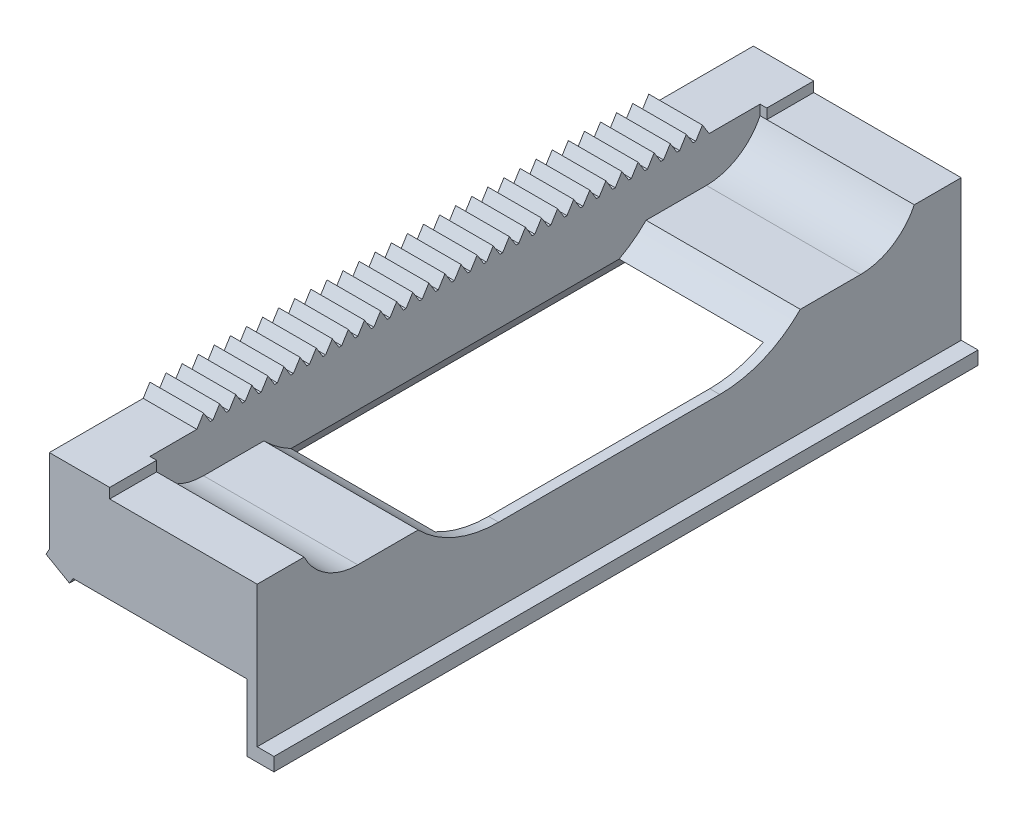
ISO-10303-21;
HEADER;
FILE_DESCRIPTION(('STEP AP214'),'2;1');
FILE_NAME('part.step','',(''),(''),'','','');
FILE_SCHEMA(('AUTOMOTIVE_DESIGN { 1 0 10303 214 1 1 1 1 }'));
ENDSEC;
DATA;
#1=APPLICATION_CONTEXT('core data for automotive mechanical design processes');
#2=APPLICATION_PROTOCOL_DEFINITION('international standard','automotive_design',2000,#1);
#3=PRODUCT_CONTEXT('',#1,'mechanical');
#4=PRODUCT('Part','Part','',(#3));
#5=PRODUCT_RELATED_PRODUCT_CATEGORY('part','',(#4));
#6=PRODUCT_DEFINITION_FORMATION('','',#4);
#7=PRODUCT_DEFINITION_CONTEXT('part definition',#1,'design');
#8=PRODUCT_DEFINITION('design','',#6,#7);
#9=PRODUCT_DEFINITION_SHAPE('','',#8);
#10=(LENGTH_UNIT() NAMED_UNIT(*) SI_UNIT(.MILLI.,.METRE.));
#11=(NAMED_UNIT(*) PLANE_ANGLE_UNIT() SI_UNIT($,.RADIAN.));
#12=(NAMED_UNIT(*) SI_UNIT($,.STERADIAN.) SOLID_ANGLE_UNIT());
#13=UNCERTAINTY_MEASURE_WITH_UNIT(LENGTH_MEASURE(1.E-05),#10,'distance_accuracy_value','');
#14=(GEOMETRIC_REPRESENTATION_CONTEXT(3) GLOBAL_UNCERTAINTY_ASSIGNED_CONTEXT((#13)) GLOBAL_UNIT_ASSIGNED_CONTEXT((#10,
#11,#12)) REPRESENTATION_CONTEXT('',''));
#15=CARTESIAN_POINT('',(0.,0.,0.));
#16=DIRECTION('',(0.,0.,1.));
#17=DIRECTION('',(1.,0.,0.));
#18=AXIS2_PLACEMENT_3D('',#15,#16,#17);
#19=CARTESIAN_POINT('',(5.5,14.5,105.));
#20=DIRECTION('',(0.,-1.,0.));
#21=DIRECTION('',(0.,0.,-1.));
#22=AXIS2_PLACEMENT_3D('',#19,#20,#21);
#23=PLANE('',#22);
#24=DIRECTION('',(0.,0.,-1.));
#25=VECTOR('',#24,1.);
#26=CARTESIAN_POINT('',(-3.5,14.5,105.));
#27=LINE('',#26,#25);
#28=CARTESIAN_POINT('',(-3.5,14.5,17.));
#29=VERTEX_POINT('',#28);
#30=CARTESIAN_POINT('',(-3.5,14.5,16.6));
#31=VERTEX_POINT('',#30);
#32=EDGE_CURVE('E1053',#29,#31,#27,.T.);
#33=ORIENTED_EDGE('',*,*,#32,.F.);
#34=DIRECTION('',(-1.,0.,0.));
#35=VECTOR('',#34,1.);
#36=CARTESIAN_POINT('',(4.5,14.5,17.));
#37=LINE('',#36,#35);
#38=CARTESIAN_POINT('',(4.5,14.5,17.));
#39=VERTEX_POINT('',#38);
#40=EDGE_CURVE('E3066',#39,#29,#37,.T.);
#41=ORIENTED_EDGE('',*,*,#40,.F.);
#42=DIRECTION('',(0.,0.,-1.));
#43=VECTOR('',#42,1.);
#44=CARTESIAN_POINT('',(4.5,14.5,105.));
#45=LINE('',#44,#43);
#46=CARTESIAN_POINT('',(4.5,14.5,16.6));
#47=VERTEX_POINT('',#46);
#48=EDGE_CURVE('E40',#39,#47,#45,.T.);
#49=ORIENTED_EDGE('',*,*,#48,.T.);
#50=DIRECTION('',(-1.,0.,0.));
#51=VECTOR('',#50,1.);
#52=CARTESIAN_POINT('',(4.5,14.5,16.6));
#53=LINE('',#52,#51);
#54=EDGE_CURVE('E3082',#47,#31,#53,.T.);
#55=ORIENTED_EDGE('',*,*,#54,.T.);
#56=EDGE_LOOP('',(#33,#41,#49,#55));
#57=FACE_BOUND('',#56,.T.);
#58=ADVANCED_FACE('F36',(#57),#23,.F.);
#59=CARTESIAN_POINT('',(4.5,14.5,19.4));
#60=VERTEX_POINT('',#59);
#61=CARTESIAN_POINT('',(4.5,14.5,19.));
#62=VERTEX_POINT('',#61);
#63=EDGE_CURVE('E909',#60,#62,#45,.T.);
#64=ORIENTED_EDGE('',*,*,#63,.T.);
#65=DIRECTION('',(-1.,0.,0.));
#66=VECTOR('',#65,1.);
#67=CARTESIAN_POINT('',(4.5,14.5,19.));
#68=LINE('',#67,#66);
#69=CARTESIAN_POINT('',(-3.5,14.5,19.));
#70=VERTEX_POINT('',#69);
#71=EDGE_CURVE('E891',#62,#70,#68,.T.);
#72=ORIENTED_EDGE('',*,*,#71,.T.);
#73=CARTESIAN_POINT('',(-3.5,14.5,19.4));
#74=VERTEX_POINT('',#73);
#75=EDGE_CURVE('E923',#74,#70,#27,.T.);
#76=ORIENTED_EDGE('',*,*,#75,.F.);
#77=DIRECTION('',(-1.,0.,0.));
#78=VECTOR('',#77,1.);
#79=CARTESIAN_POINT('',(4.5,14.5,19.4));
#80=LINE('',#79,#78);
#81=EDGE_CURVE('E915',#60,#74,#80,.T.);
#82=ORIENTED_EDGE('',*,*,#81,.F.);
#83=EDGE_LOOP('',(#64,#72,#76,#82));
#84=FACE_BOUND('',#83,.T.);
#85=ADVANCED_FACE('F913',(#84),#23,.F.);
#86=CARTESIAN_POINT('',(4.5,14.5,31.4));
#87=VERTEX_POINT('',#86);
#88=CARTESIAN_POINT('',(4.5,14.5,31.));
#89=VERTEX_POINT('',#88);
#90=EDGE_CURVE('E1018',#87,#89,#45,.T.);
#91=ORIENTED_EDGE('',*,*,#90,.T.);
#92=DIRECTION('',(-1.,0.,0.));
#93=VECTOR('',#92,1.);
#94=CARTESIAN_POINT('',(4.5,14.5,31.));
#95=LINE('',#94,#93);
#96=CARTESIAN_POINT('',(-3.5,14.5,31.));
#97=VERTEX_POINT('',#96);
#98=EDGE_CURVE('E3098',#89,#97,#95,.T.);
#99=ORIENTED_EDGE('',*,*,#98,.T.);
#100=CARTESIAN_POINT('',(-3.5,14.5,31.4));
#101=VERTEX_POINT('',#100);
#102=EDGE_CURVE('E1107',#101,#97,#27,.T.);
#103=ORIENTED_EDGE('',*,*,#102,.F.);
#104=DIRECTION('',(-1.,0.,0.));
#105=VECTOR('',#104,1.);
#106=CARTESIAN_POINT('',(4.5,14.5,31.4));
#107=LINE('',#106,#105);
#108=EDGE_CURVE('E1259',#87,#101,#107,.T.);
#109=ORIENTED_EDGE('',*,*,#108,.F.);
#110=EDGE_LOOP('',(#91,#99,#103,#109));
#111=FACE_BOUND('',#110,.T.);
#112=ADVANCED_FACE('F1796',(#111),#23,.F.);
#113=CARTESIAN_POINT('',(-3.5,14.5,29.));
#114=VERTEX_POINT('',#113);
#115=CARTESIAN_POINT('',(-3.5,14.5,28.6));
#116=VERTEX_POINT('',#115);
#117=EDGE_CURVE('E1124',#114,#116,#27,.T.);
#118=ORIENTED_EDGE('',*,*,#117,.F.);
#119=DIRECTION('',(-1.,0.,0.));
#120=VECTOR('',#119,1.);
#121=CARTESIAN_POINT('',(4.5,14.5,29.));
#122=LINE('',#121,#120);
#123=CARTESIAN_POINT('',(4.5,14.5,29.));
#124=VERTEX_POINT('',#123);
#125=EDGE_CURVE('E3101',#124,#114,#122,.T.);
#126=ORIENTED_EDGE('',*,*,#125,.F.);
#127=CARTESIAN_POINT('',(4.5,14.5,28.6));
#128=VERTEX_POINT('',#127);
#129=EDGE_CURVE('E1049',#124,#128,#45,.T.);
#130=ORIENTED_EDGE('',*,*,#129,.T.);
#131=DIRECTION('',(-1.,0.,0.));
#132=VECTOR('',#131,1.);
#133=CARTESIAN_POINT('',(4.5,14.5,28.6));
#134=LINE('',#133,#132);
#135=EDGE_CURVE('E3114',#128,#116,#134,.T.);
#136=ORIENTED_EDGE('',*,*,#135,.T.);
#137=EDGE_LOOP('',(#118,#126,#130,#136));
#138=FACE_BOUND('',#137,.T.);
#139=ADVANCED_FACE('F3134',(#138),#23,.F.);
#140=CARTESIAN_POINT('',(-3.5,14.5,26.6));
#141=VERTEX_POINT('',#140);
#142=CARTESIAN_POINT('',(-3.5,14.5,26.2));
#143=VERTEX_POINT('',#142);
#144=EDGE_CURVE('E1123',#141,#143,#27,.T.);
#145=ORIENTED_EDGE('',*,*,#144,.F.);
#146=DIRECTION('',(-1.,0.,0.));
#147=VECTOR('',#146,1.);
#148=CARTESIAN_POINT('',(4.5,14.5,26.6));
#149=LINE('',#148,#147);
#150=CARTESIAN_POINT('',(4.5,14.5,26.6));
#151=VERTEX_POINT('',#150);
#152=EDGE_CURVE('E3117',#151,#141,#149,.T.);
#153=ORIENTED_EDGE('',*,*,#152,.F.);
#154=CARTESIAN_POINT('',(4.5,14.5,26.2));
#155=VERTEX_POINT('',#154);
#156=EDGE_CURVE('E1046',#151,#155,#45,.T.);
#157=ORIENTED_EDGE('',*,*,#156,.T.);
#158=DIRECTION('',(-1.,0.,0.));
#159=VECTOR('',#158,1.);
#160=CARTESIAN_POINT('',(4.5,14.5,26.2));
#161=LINE('',#160,#159);
#162=EDGE_CURVE('E1761',#155,#143,#161,.T.);
#163=ORIENTED_EDGE('',*,*,#162,.T.);
#164=EDGE_LOOP('',(#145,#153,#157,#163));
#165=FACE_BOUND('',#164,.T.);
#166=ADVANCED_FACE('F3144',(#165),#23,.F.);
#167=CARTESIAN_POINT('',(-3.5,14.5,24.2));
#168=VERTEX_POINT('',#167);
#169=CARTESIAN_POINT('',(-3.5,14.5,23.8));
#170=VERTEX_POINT('',#169);
#171=EDGE_CURVE('E1121',#168,#170,#27,.T.);
#172=ORIENTED_EDGE('',*,*,#171,.F.);
#173=DIRECTION('',(-1.,0.,0.));
#174=VECTOR('',#173,1.);
#175=CARTESIAN_POINT('',(4.5,14.5,24.2));
#176=LINE('',#175,#174);
#177=CARTESIAN_POINT('',(4.5,14.5,24.2));
#178=VERTEX_POINT('',#177);
#179=EDGE_CURVE('E1739',#178,#168,#176,.T.);
#180=ORIENTED_EDGE('',*,*,#179,.F.);
#181=CARTESIAN_POINT('',(4.5,14.5,23.8));
#182=VERTEX_POINT('',#181);
#183=EDGE_CURVE('E918',#178,#182,#45,.T.);
#184=ORIENTED_EDGE('',*,*,#183,.T.);
#185=DIRECTION('',(-1.,0.,0.));
#186=VECTOR('',#185,1.);
#187=CARTESIAN_POINT('',(4.5,14.5,23.8));
#188=LINE('',#187,#186);
#189=EDGE_CURVE('E1737',#182,#170,#188,.T.);
#190=ORIENTED_EDGE('',*,*,#189,.T.);
#191=EDGE_LOOP('',(#172,#180,#184,#190));
#192=FACE_BOUND('',#191,.T.);
#193=ADVANCED_FACE('F1736',(#192),#23,.F.);
#194=CARTESIAN_POINT('',(-3.5,14.5,21.8));
#195=VERTEX_POINT('',#194);
#196=CARTESIAN_POINT('',(-3.5,14.5,21.4));
#197=VERTEX_POINT('',#196);
#198=EDGE_CURVE('E926',#195,#197,#27,.T.);
#199=ORIENTED_EDGE('',*,*,#198,.F.);
#200=DIRECTION('',(-1.,0.,0.));
#201=VECTOR('',#200,1.);
#202=CARTESIAN_POINT('',(4.5,14.5,21.8));
#203=LINE('',#202,#201);
#204=CARTESIAN_POINT('',(4.5,14.5,21.8));
#205=VERTEX_POINT('',#204);
#206=EDGE_CURVE('E1747',#205,#195,#203,.T.);
#207=ORIENTED_EDGE('',*,*,#206,.F.);
#208=CARTESIAN_POINT('',(4.5,14.5,21.4));
#209=VERTEX_POINT('',#208);
#210=EDGE_CURVE('E916',#205,#209,#45,.T.);
#211=ORIENTED_EDGE('',*,*,#210,.T.);
#212=DIRECTION('',(-1.,0.,0.));
#213=VECTOR('',#212,1.);
#214=CARTESIAN_POINT('',(4.5,14.5,21.4));
#215=LINE('',#214,#213);
#216=EDGE_CURVE('E1147',#209,#197,#215,.T.);
#217=ORIENTED_EDGE('',*,*,#216,.T.);
#218=EDGE_LOOP('',(#199,#207,#211,#217));
#219=FACE_BOUND('',#218,.T.);
#220=ADVANCED_FACE('F1775',(#219),#23,.F.);
#221=CARTESIAN_POINT('',(-3.5,14.5,43.4));
#222=VERTEX_POINT('',#221);
#223=CARTESIAN_POINT('',(-3.5,14.5,43.));
#224=VERTEX_POINT('',#223);
#225=EDGE_CURVE('E1117',#222,#224,#27,.T.);
#226=ORIENTED_EDGE('',*,*,#225,.F.);
#227=DIRECTION('',(-1.,0.,0.));
#228=VECTOR('',#227,1.);
#229=CARTESIAN_POINT('',(4.5,14.5,43.4));
#230=LINE('',#229,#228);
#231=CARTESIAN_POINT('',(4.5,14.5,43.4));
#232=VERTEX_POINT('',#231);
#233=EDGE_CURVE('E1165',#232,#222,#230,.T.);
#234=ORIENTED_EDGE('',*,*,#233,.F.);
#235=CARTESIAN_POINT('',(4.5,14.5,43.));
#236=VERTEX_POINT('',#235);
#237=EDGE_CURVE('E1037',#232,#236,#45,.T.);
#238=ORIENTED_EDGE('',*,*,#237,.T.);
#239=DIRECTION('',(-1.,0.,0.));
#240=VECTOR('',#239,1.);
#241=CARTESIAN_POINT('',(4.5,14.5,43.));
#242=LINE('',#241,#240);
#243=EDGE_CURVE('E1183',#236,#224,#242,.T.);
#244=ORIENTED_EDGE('',*,*,#243,.T.);
#245=EDGE_LOOP('',(#226,#234,#238,#244));
#246=FACE_BOUND('',#245,.T.);
#247=ADVANCED_FACE('F3154',(#246),#23,.F.);
#248=CARTESIAN_POINT('',(4.5,14.5,45.8));
#249=VERTEX_POINT('',#248);
#250=CARTESIAN_POINT('',(4.5,14.5,45.4));
#251=VERTEX_POINT('',#250);
#252=EDGE_CURVE('E998',#249,#251,#45,.T.);
#253=ORIENTED_EDGE('',*,*,#252,.T.);
#254=DIRECTION('',(-1.,0.,0.));
#255=VECTOR('',#254,1.);
#256=CARTESIAN_POINT('',(4.5,14.5,45.4));
#257=LINE('',#256,#255);
#258=CARTESIAN_POINT('',(-3.5,14.5,45.4));
#259=VERTEX_POINT('',#258);
#260=EDGE_CURVE('E1161',#251,#259,#257,.T.);
#261=ORIENTED_EDGE('',*,*,#260,.T.);
#262=CARTESIAN_POINT('',(-3.5,14.5,45.8));
#263=VERTEX_POINT('',#262);
#264=EDGE_CURVE('E1097',#263,#259,#27,.T.);
#265=ORIENTED_EDGE('',*,*,#264,.F.);
#266=DIRECTION('',(-1.,0.,0.));
#267=VECTOR('',#266,1.);
#268=CARTESIAN_POINT('',(4.5,14.5,45.8));
#269=LINE('',#268,#267);
#270=EDGE_CURVE('E1349',#249,#263,#269,.T.);
#271=ORIENTED_EDGE('',*,*,#270,.F.);
#272=EDGE_LOOP('',(#253,#261,#265,#271));
#273=FACE_BOUND('',#272,.T.);
#274=ADVANCED_FACE('F3158',(#273),#23,.F.);
#275=CARTESIAN_POINT('',(-3.5,14.5,41.));
#276=VERTEX_POINT('',#275);
#277=CARTESIAN_POINT('',(-3.5,14.5,40.6));
#278=VERTEX_POINT('',#277);
#279=EDGE_CURVE('E1115',#276,#278,#27,.T.);
#280=ORIENTED_EDGE('',*,*,#279,.F.);
#281=DIRECTION('',(-1.,0.,0.));
#282=VECTOR('',#281,1.);
#283=CARTESIAN_POINT('',(4.5,14.5,41.));
#284=LINE('',#283,#282);
#285=CARTESIAN_POINT('',(4.5,14.5,41.));
#286=VERTEX_POINT('',#285);
#287=EDGE_CURVE('E1187',#286,#276,#284,.T.);
#288=ORIENTED_EDGE('',*,*,#287,.F.);
#289=CARTESIAN_POINT('',(4.5,14.5,40.6));
#290=VERTEX_POINT('',#289);
#291=EDGE_CURVE('E1034',#286,#290,#45,.T.);
#292=ORIENTED_EDGE('',*,*,#291,.T.);
#293=DIRECTION('',(-1.,0.,0.));
#294=VECTOR('',#293,1.);
#295=CARTESIAN_POINT('',(4.5,14.5,40.6));
#296=LINE('',#295,#294);
#297=EDGE_CURVE('E1201',#290,#278,#296,.T.);
#298=ORIENTED_EDGE('',*,*,#297,.T.);
#299=EDGE_LOOP('',(#280,#288,#292,#298));
#300=FACE_BOUND('',#299,.T.);
#301=ADVANCED_FACE('F2209',(#300),#23,.F.);
#302=CARTESIAN_POINT('',(-3.5,14.5,38.6));
#303=VERTEX_POINT('',#302);
#304=CARTESIAN_POINT('',(-3.5,14.5,38.2));
#305=VERTEX_POINT('',#304);
#306=EDGE_CURVE('E1113',#303,#305,#27,.T.);
#307=ORIENTED_EDGE('',*,*,#306,.F.);
#308=DIRECTION('',(-1.,0.,0.));
#309=VECTOR('',#308,1.);
#310=CARTESIAN_POINT('',(4.5,14.5,38.6));
#311=LINE('',#310,#309);
#312=CARTESIAN_POINT('',(4.5,14.5,38.6));
#313=VERTEX_POINT('',#312);
#314=EDGE_CURVE('E1205',#313,#303,#311,.T.);
#315=ORIENTED_EDGE('',*,*,#314,.F.);
#316=CARTESIAN_POINT('',(4.5,14.5,38.2));
#317=VERTEX_POINT('',#316);
#318=EDGE_CURVE('E1030',#313,#317,#45,.T.);
#319=ORIENTED_EDGE('',*,*,#318,.T.);
#320=DIRECTION('',(-1.,0.,0.));
#321=VECTOR('',#320,1.);
#322=CARTESIAN_POINT('',(4.5,14.5,38.2));
#323=LINE('',#322,#321);
#324=EDGE_CURVE('E1219',#317,#305,#323,.T.);
#325=ORIENTED_EDGE('',*,*,#324,.T.);
#326=EDGE_LOOP('',(#307,#315,#319,#325));
#327=FACE_BOUND('',#326,.T.);
#328=ADVANCED_FACE('F2205',(#327),#23,.F.);
#329=CARTESIAN_POINT('',(-3.5,14.5,36.2));
#330=VERTEX_POINT('',#329);
#331=CARTESIAN_POINT('',(-3.5,14.5,35.8));
#332=VERTEX_POINT('',#331);
#333=EDGE_CURVE('E1111',#330,#332,#27,.T.);
#334=ORIENTED_EDGE('',*,*,#333,.F.);
#335=DIRECTION('',(-1.,0.,0.));
#336=VECTOR('',#335,1.);
#337=CARTESIAN_POINT('',(4.5,14.5,36.2));
#338=LINE('',#337,#336);
#339=CARTESIAN_POINT('',(4.5,14.5,36.2));
#340=VERTEX_POINT('',#339);
#341=EDGE_CURVE('E1223',#340,#330,#338,.T.);
#342=ORIENTED_EDGE('',*,*,#341,.F.);
#343=CARTESIAN_POINT('',(4.5,14.5,35.8));
#344=VERTEX_POINT('',#343);
#345=EDGE_CURVE('E1026',#340,#344,#45,.T.);
#346=ORIENTED_EDGE('',*,*,#345,.T.);
#347=DIRECTION('',(-1.,0.,0.));
#348=VECTOR('',#347,1.);
#349=CARTESIAN_POINT('',(4.5,14.5,35.8));
#350=LINE('',#349,#348);
#351=EDGE_CURVE('E1237',#344,#332,#350,.T.);
#352=ORIENTED_EDGE('',*,*,#351,.T.);
#353=EDGE_LOOP('',(#334,#342,#346,#352));
#354=FACE_BOUND('',#353,.T.);
#355=ADVANCED_FACE('F2199',(#354),#23,.F.);
#356=CARTESIAN_POINT('',(-3.5,14.5,33.8));
#357=VERTEX_POINT('',#356);
#358=CARTESIAN_POINT('',(-3.5,14.5,33.4));
#359=VERTEX_POINT('',#358);
#360=EDGE_CURVE('E1109',#357,#359,#27,.T.);
#361=ORIENTED_EDGE('',*,*,#360,.F.);
#362=DIRECTION('',(-1.,0.,0.));
#363=VECTOR('',#362,1.);
#364=CARTESIAN_POINT('',(4.5,14.5,33.8));
#365=LINE('',#364,#363);
#366=CARTESIAN_POINT('',(4.5,14.5,33.8));
#367=VERTEX_POINT('',#366);
#368=EDGE_CURVE('E1241',#367,#357,#365,.T.);
#369=ORIENTED_EDGE('',*,*,#368,.F.);
#370=CARTESIAN_POINT('',(4.5,14.5,33.4));
#371=VERTEX_POINT('',#370);
#372=EDGE_CURVE('E1022',#367,#371,#45,.T.);
#373=ORIENTED_EDGE('',*,*,#372,.T.);
#374=DIRECTION('',(-1.,0.,0.));
#375=VECTOR('',#374,1.);
#376=CARTESIAN_POINT('',(4.5,14.5,33.4));
#377=LINE('',#376,#375);
#378=EDGE_CURVE('E1255',#371,#359,#377,.T.);
#379=ORIENTED_EDGE('',*,*,#378,.T.);
#380=EDGE_LOOP('',(#361,#369,#373,#379));
#381=FACE_BOUND('',#380,.T.);
#382=ADVANCED_FACE('F2196',(#381),#23,.F.);
#383=CARTESIAN_POINT('',(-3.5,14.5,55.4));
#384=VERTEX_POINT('',#383);
#385=CARTESIAN_POINT('',(-3.5,14.5,55.));
#386=VERTEX_POINT('',#385);
#387=EDGE_CURVE('E1105',#384,#386,#27,.T.);
#388=ORIENTED_EDGE('',*,*,#387,.F.);
#389=DIRECTION('',(-1.,0.,0.));
#390=VECTOR('',#389,1.);
#391=CARTESIAN_POINT('',(4.5,14.5,55.4));
#392=LINE('',#391,#390);
#393=CARTESIAN_POINT('',(4.5,14.5,55.4));
#394=VERTEX_POINT('',#393);
#395=EDGE_CURVE('E1273',#394,#384,#392,.T.);
#396=ORIENTED_EDGE('',*,*,#395,.F.);
#397=CARTESIAN_POINT('',(4.5,14.5,55.));
#398=VERTEX_POINT('',#397);
#399=EDGE_CURVE('E1014',#394,#398,#45,.T.);
#400=ORIENTED_EDGE('',*,*,#399,.T.);
#401=DIRECTION('',(-1.,0.,0.));
#402=VECTOR('',#401,1.);
#403=CARTESIAN_POINT('',(4.5,14.5,55.));
#404=LINE('',#403,#402);
#405=EDGE_CURVE('E1291',#398,#386,#404,.T.);
#406=ORIENTED_EDGE('',*,*,#405,.T.);
#407=EDGE_LOOP('',(#388,#396,#400,#406));
#408=FACE_BOUND('',#407,.T.);
#409=ADVANCED_FACE('F2198',(#408),#23,.F.);
#410=CARTESIAN_POINT('',(4.5,14.5,57.8));
#411=VERTEX_POINT('',#410);
#412=CARTESIAN_POINT('',(4.5,14.5,57.4));
#413=VERTEX_POINT('',#412);
#414=EDGE_CURVE('E978',#411,#413,#45,.T.);
#415=ORIENTED_EDGE('',*,*,#414,.T.);
#416=DIRECTION('',(-1.,0.,0.));
#417=VECTOR('',#416,1.);
#418=CARTESIAN_POINT('',(4.5,14.5,57.4));
#419=LINE('',#418,#417);
#420=CARTESIAN_POINT('',(-3.5,14.5,57.4));
#421=VERTEX_POINT('',#420);
#422=EDGE_CURVE('E1269',#413,#421,#419,.T.);
#423=ORIENTED_EDGE('',*,*,#422,.T.);
#424=CARTESIAN_POINT('',(-3.5,14.5,57.8));
#425=VERTEX_POINT('',#424);
#426=EDGE_CURVE('E1087',#425,#421,#27,.T.);
#427=ORIENTED_EDGE('',*,*,#426,.F.);
#428=DIRECTION('',(-1.,0.,0.));
#429=VECTOR('',#428,1.);
#430=CARTESIAN_POINT('',(4.5,14.5,57.8));
#431=LINE('',#430,#429);
#432=EDGE_CURVE('E1439',#411,#425,#431,.T.);
#433=ORIENTED_EDGE('',*,*,#432,.F.);
#434=EDGE_LOOP('',(#415,#423,#427,#433));
#435=FACE_BOUND('',#434,.T.);
#436=ADVANCED_FACE('F2204',(#435),#23,.F.);
#437=CARTESIAN_POINT('',(-3.5,14.5,53.));
#438=VERTEX_POINT('',#437);
#439=CARTESIAN_POINT('',(-3.5,14.5,52.6));
#440=VERTEX_POINT('',#439);
#441=EDGE_CURVE('E1103',#438,#440,#27,.T.);
#442=ORIENTED_EDGE('',*,*,#441,.F.);
#443=DIRECTION('',(-1.,0.,0.));
#444=VECTOR('',#443,1.);
#445=CARTESIAN_POINT('',(4.5,14.5,53.));
#446=LINE('',#445,#444);
#447=CARTESIAN_POINT('',(4.5,14.5,53.));
#448=VERTEX_POINT('',#447);
#449=EDGE_CURVE('E1295',#448,#438,#446,.T.);
#450=ORIENTED_EDGE('',*,*,#449,.F.);
#451=CARTESIAN_POINT('',(4.5,14.5,52.6));
#452=VERTEX_POINT('',#451);
#453=EDGE_CURVE('E1010',#448,#452,#45,.T.);
#454=ORIENTED_EDGE('',*,*,#453,.T.);
#455=DIRECTION('',(-1.,0.,0.));
#456=VECTOR('',#455,1.);
#457=CARTESIAN_POINT('',(4.5,14.5,52.6));
#458=LINE('',#457,#456);
#459=EDGE_CURVE('E1309',#452,#440,#458,.T.);
#460=ORIENTED_EDGE('',*,*,#459,.T.);
#461=EDGE_LOOP('',(#442,#450,#454,#460));
#462=FACE_BOUND('',#461,.T.);
#463=ADVANCED_FACE('F3203',(#462),#23,.F.);
#464=CARTESIAN_POINT('',(-3.5,14.5,50.6));
#465=VERTEX_POINT('',#464);
#466=CARTESIAN_POINT('',(-3.5,14.5,50.2));
#467=VERTEX_POINT('',#466);
#468=EDGE_CURVE('E1101',#465,#467,#27,.T.);
#469=ORIENTED_EDGE('',*,*,#468,.F.);
#470=DIRECTION('',(-1.,0.,0.));
#471=VECTOR('',#470,1.);
#472=CARTESIAN_POINT('',(4.5,14.5,50.6));
#473=LINE('',#472,#471);
#474=CARTESIAN_POINT('',(4.5,14.5,50.6));
#475=VERTEX_POINT('',#474);
#476=EDGE_CURVE('E1313',#475,#465,#473,.T.);
#477=ORIENTED_EDGE('',*,*,#476,.F.);
#478=CARTESIAN_POINT('',(4.5,14.5,50.2));
#479=VERTEX_POINT('',#478);
#480=EDGE_CURVE('E1006',#475,#479,#45,.T.);
#481=ORIENTED_EDGE('',*,*,#480,.T.);
#482=DIRECTION('',(-1.,0.,0.));
#483=VECTOR('',#482,1.);
#484=CARTESIAN_POINT('',(4.5,14.5,50.2));
#485=LINE('',#484,#483);
#486=EDGE_CURVE('E1327',#479,#467,#485,.T.);
#487=ORIENTED_EDGE('',*,*,#486,.T.);
#488=EDGE_LOOP('',(#469,#477,#481,#487));
#489=FACE_BOUND('',#488,.T.);
#490=ADVANCED_FACE('F3211',(#489),#23,.F.);
#491=CARTESIAN_POINT('',(-3.5,14.5,48.2));
#492=VERTEX_POINT('',#491);
#493=CARTESIAN_POINT('',(-3.5,14.5,47.8));
#494=VERTEX_POINT('',#493);
#495=EDGE_CURVE('E1099',#492,#494,#27,.T.);
#496=ORIENTED_EDGE('',*,*,#495,.F.);
#497=DIRECTION('',(-1.,0.,0.));
#498=VECTOR('',#497,1.);
#499=CARTESIAN_POINT('',(4.5,14.5,48.2));
#500=LINE('',#499,#498);
#501=CARTESIAN_POINT('',(4.5,14.5,48.2));
#502=VERTEX_POINT('',#501);
#503=EDGE_CURVE('E1331',#502,#492,#500,.T.);
#504=ORIENTED_EDGE('',*,*,#503,.F.);
#505=CARTESIAN_POINT('',(4.5,14.5,47.8));
#506=VERTEX_POINT('',#505);
#507=EDGE_CURVE('E1002',#502,#506,#45,.T.);
#508=ORIENTED_EDGE('',*,*,#507,.T.);
#509=DIRECTION('',(-1.,0.,0.));
#510=VECTOR('',#509,1.);
#511=CARTESIAN_POINT('',(4.5,14.5,47.8));
#512=LINE('',#511,#510);
#513=EDGE_CURVE('E1345',#506,#494,#512,.T.);
#514=ORIENTED_EDGE('',*,*,#513,.T.);
#515=EDGE_LOOP('',(#496,#504,#508,#514));
#516=FACE_BOUND('',#515,.T.);
#517=ADVANCED_FACE('F3219',(#516),#23,.F.);
#518=CARTESIAN_POINT('',(4.5,14.5,69.8));
#519=VERTEX_POINT('',#518);
#520=CARTESIAN_POINT('',(4.5,14.5,69.4));
#521=VERTEX_POINT('',#520);
#522=EDGE_CURVE('E954',#519,#521,#45,.T.);
#523=ORIENTED_EDGE('',*,*,#522,.T.);
#524=DIRECTION('',(-1.,0.,0.));
#525=VECTOR('',#524,1.);
#526=CARTESIAN_POINT('',(4.5,14.5,69.4));
#527=LINE('',#526,#525);
#528=CARTESIAN_POINT('',(-3.5,14.5,69.4));
#529=VERTEX_POINT('',#528);
#530=EDGE_CURVE('E1363',#521,#529,#527,.T.);
#531=ORIENTED_EDGE('',*,*,#530,.T.);
#532=CARTESIAN_POINT('',(-3.5,14.5,69.8));
#533=VERTEX_POINT('',#532);
#534=EDGE_CURVE('E1075',#533,#529,#27,.T.);
#535=ORIENTED_EDGE('',*,*,#534,.F.);
#536=DIRECTION('',(-1.,0.,0.));
#537=VECTOR('',#536,1.);
#538=CARTESIAN_POINT('',(4.5,14.5,69.8));
#539=LINE('',#538,#537);
#540=EDGE_CURVE('E1547',#519,#533,#539,.T.);
#541=ORIENTED_EDGE('',*,*,#540,.F.);
#542=EDGE_LOOP('',(#523,#531,#535,#541));
#543=FACE_BOUND('',#542,.T.);
#544=ADVANCED_FACE('F3227',(#543),#23,.F.);
#545=CARTESIAN_POINT('',(-3.5,14.5,67.4));
#546=VERTEX_POINT('',#545);
#547=CARTESIAN_POINT('',(-3.5,14.5,67.));
#548=VERTEX_POINT('',#547);
#549=EDGE_CURVE('E1095',#546,#548,#27,.T.);
#550=ORIENTED_EDGE('',*,*,#549,.F.);
#551=DIRECTION('',(-1.,0.,0.));
#552=VECTOR('',#551,1.);
#553=CARTESIAN_POINT('',(4.5,14.5,67.4));
#554=LINE('',#553,#552);
#555=CARTESIAN_POINT('',(4.5,14.5,67.4));
#556=VERTEX_POINT('',#555);
#557=EDGE_CURVE('E1367',#556,#546,#554,.T.);
#558=ORIENTED_EDGE('',*,*,#557,.F.);
#559=CARTESIAN_POINT('',(4.5,14.5,67.));
#560=VERTEX_POINT('',#559);
#561=EDGE_CURVE('E994',#556,#560,#45,.T.);
#562=ORIENTED_EDGE('',*,*,#561,.T.);
#563=DIRECTION('',(-1.,0.,0.));
#564=VECTOR('',#563,1.);
#565=CARTESIAN_POINT('',(4.5,14.5,67.));
#566=LINE('',#565,#564);
#567=EDGE_CURVE('E1381',#560,#548,#566,.T.);
#568=ORIENTED_EDGE('',*,*,#567,.T.);
#569=EDGE_LOOP('',(#550,#558,#562,#568));
#570=FACE_BOUND('',#569,.T.);
#571=ADVANCED_FACE('F3235',(#570),#23,.F.);
#572=CARTESIAN_POINT('',(-3.5,14.5,65.));
#573=VERTEX_POINT('',#572);
#574=CARTESIAN_POINT('',(-3.5,14.5,64.6));
#575=VERTEX_POINT('',#574);
#576=EDGE_CURVE('E1093',#573,#575,#27,.T.);
#577=ORIENTED_EDGE('',*,*,#576,.F.);
#578=DIRECTION('',(-1.,0.,0.));
#579=VECTOR('',#578,1.);
#580=CARTESIAN_POINT('',(4.5,14.5,65.));
#581=LINE('',#580,#579);
#582=CARTESIAN_POINT('',(4.5,14.5,65.));
#583=VERTEX_POINT('',#582);
#584=EDGE_CURVE('E1385',#583,#573,#581,.T.);
#585=ORIENTED_EDGE('',*,*,#584,.F.);
#586=CARTESIAN_POINT('',(4.5,14.5,64.6));
#587=VERTEX_POINT('',#586);
#588=EDGE_CURVE('E990',#583,#587,#45,.T.);
#589=ORIENTED_EDGE('',*,*,#588,.T.);
#590=DIRECTION('',(-1.,0.,0.));
#591=VECTOR('',#590,1.);
#592=CARTESIAN_POINT('',(4.5,14.5,64.6));
#593=LINE('',#592,#591);
#594=EDGE_CURVE('E1399',#587,#575,#593,.T.);
#595=ORIENTED_EDGE('',*,*,#594,.T.);
#596=EDGE_LOOP('',(#577,#585,#589,#595));
#597=FACE_BOUND('',#596,.T.);
#598=ADVANCED_FACE('F3243',(#597),#23,.F.);
#599=CARTESIAN_POINT('',(-3.5,14.5,62.6));
#600=VERTEX_POINT('',#599);
#601=CARTESIAN_POINT('',(-3.5,14.5,62.2));
#602=VERTEX_POINT('',#601);
#603=EDGE_CURVE('E1091',#600,#602,#27,.T.);
#604=ORIENTED_EDGE('',*,*,#603,.F.);
#605=DIRECTION('',(-1.,0.,0.));
#606=VECTOR('',#605,1.);
#607=CARTESIAN_POINT('',(4.5,14.5,62.6));
#608=LINE('',#607,#606);
#609=CARTESIAN_POINT('',(4.5,14.5,62.6));
#610=VERTEX_POINT('',#609);
#611=EDGE_CURVE('E1403',#610,#600,#608,.T.);
#612=ORIENTED_EDGE('',*,*,#611,.F.);
#613=CARTESIAN_POINT('',(4.5,14.5,62.2));
#614=VERTEX_POINT('',#613);
#615=EDGE_CURVE('E986',#610,#614,#45,.T.);
#616=ORIENTED_EDGE('',*,*,#615,.T.);
#617=DIRECTION('',(-1.,0.,0.));
#618=VECTOR('',#617,1.);
#619=CARTESIAN_POINT('',(4.5,14.5,62.2));
#620=LINE('',#619,#618);
#621=EDGE_CURVE('E1417',#614,#602,#620,.T.);
#622=ORIENTED_EDGE('',*,*,#621,.T.);
#623=EDGE_LOOP('',(#604,#612,#616,#622));
#624=FACE_BOUND('',#623,.T.);
#625=ADVANCED_FACE('F3251',(#624),#23,.F.);
#626=CARTESIAN_POINT('',(-3.5,14.5,60.2));
#627=VERTEX_POINT('',#626);
#628=CARTESIAN_POINT('',(-3.5,14.5,59.8));
#629=VERTEX_POINT('',#628);
#630=EDGE_CURVE('E1089',#627,#629,#27,.T.);
#631=ORIENTED_EDGE('',*,*,#630,.F.);
#632=DIRECTION('',(-1.,0.,0.));
#633=VECTOR('',#632,1.);
#634=CARTESIAN_POINT('',(4.5,14.5,60.2));
#635=LINE('',#634,#633);
#636=CARTESIAN_POINT('',(4.5,14.5,60.2));
#637=VERTEX_POINT('',#636);
#638=EDGE_CURVE('E1421',#637,#627,#635,.T.);
#639=ORIENTED_EDGE('',*,*,#638,.F.);
#640=CARTESIAN_POINT('',(4.5,14.5,59.8));
#641=VERTEX_POINT('',#640);
#642=EDGE_CURVE('E982',#637,#641,#45,.T.);
#643=ORIENTED_EDGE('',*,*,#642,.T.);
#644=DIRECTION('',(-1.,0.,0.));
#645=VECTOR('',#644,1.);
#646=CARTESIAN_POINT('',(4.5,14.5,59.8));
#647=LINE('',#646,#645);
#648=EDGE_CURVE('E1435',#641,#629,#647,.T.);
#649=ORIENTED_EDGE('',*,*,#648,.T.);
#650=EDGE_LOOP('',(#631,#639,#643,#649));
#651=FACE_BOUND('',#650,.T.);
#652=ADVANCED_FACE('F3259',(#651),#23,.F.);
#653=CARTESIAN_POINT('',(-3.5,14.5,81.8));
#654=VERTEX_POINT('',#653);
#655=CARTESIAN_POINT('',(-3.5,14.5,81.4));
#656=VERTEX_POINT('',#655);
#657=EDGE_CURVE('E1085',#654,#656,#27,.T.);
#658=ORIENTED_EDGE('',*,*,#657,.F.);
#659=DIRECTION('',(-1.,0.,0.));
#660=VECTOR('',#659,1.);
#661=CARTESIAN_POINT('',(4.5,14.5,81.8));
#662=LINE('',#661,#660);
#663=CARTESIAN_POINT('',(4.5,14.5,81.8));
#664=VERTEX_POINT('',#663);
#665=EDGE_CURVE('E1453',#664,#654,#662,.T.);
#666=ORIENTED_EDGE('',*,*,#665,.F.);
#667=CARTESIAN_POINT('',(4.5,14.5,81.4));
#668=VERTEX_POINT('',#667);
#669=EDGE_CURVE('E974',#664,#668,#45,.T.);
#670=ORIENTED_EDGE('',*,*,#669,.T.);
#671=DIRECTION('',(-1.,0.,0.));
#672=VECTOR('',#671,1.);
#673=CARTESIAN_POINT('',(4.5,14.5,81.4));
#674=LINE('',#673,#672);
#675=EDGE_CURVE('E1471',#668,#656,#674,.T.);
#676=ORIENTED_EDGE('',*,*,#675,.T.);
#677=EDGE_LOOP('',(#658,#666,#670,#676));
#678=FACE_BOUND('',#677,.T.);
#679=ADVANCED_FACE('F3267',(#678),#23,.F.);
#680=CARTESIAN_POINT('',(4.5,14.5,84.2));
#681=VERTEX_POINT('',#680);
#682=CARTESIAN_POINT('',(4.5,14.5,83.8));
#683=VERTEX_POINT('',#682);
#684=EDGE_CURVE('E937',#681,#683,#45,.T.);
#685=ORIENTED_EDGE('',*,*,#684,.T.);
#686=DIRECTION('',(-1.,0.,0.));
#687=VECTOR('',#686,1.);
#688=CARTESIAN_POINT('',(4.5,14.5,83.8));
#689=LINE('',#688,#687);
#690=CARTESIAN_POINT('',(-3.5,14.5,83.8));
#691=VERTEX_POINT('',#690);
#692=EDGE_CURVE('E1449',#683,#691,#689,.T.);
#693=ORIENTED_EDGE('',*,*,#692,.T.);
#694=CARTESIAN_POINT('',(-3.5,14.5,84.2));
#695=VERTEX_POINT('',#694);
#696=EDGE_CURVE('E1064',#695,#691,#27,.T.);
#697=ORIENTED_EDGE('',*,*,#696,.F.);
#698=DIRECTION('',(-1.,0.,0.));
#699=VECTOR('',#698,1.);
#700=CARTESIAN_POINT('',(4.5,14.5,84.2));
#701=LINE('',#700,#699);
#702=EDGE_CURVE('E1597',#681,#695,#701,.T.);
#703=ORIENTED_EDGE('',*,*,#702,.F.);
#704=EDGE_LOOP('',(#685,#693,#697,#703));
#705=FACE_BOUND('',#704,.T.);
#706=ADVANCED_FACE('F3275',(#705),#23,.F.);
#707=CARTESIAN_POINT('',(-3.5,14.5,79.4));
#708=VERTEX_POINT('',#707);
#709=CARTESIAN_POINT('',(-3.5,14.5,79.));
#710=VERTEX_POINT('',#709);
#711=EDGE_CURVE('E1083',#708,#710,#27,.T.);
#712=ORIENTED_EDGE('',*,*,#711,.F.);
#713=DIRECTION('',(-1.,0.,0.));
#714=VECTOR('',#713,1.);
#715=CARTESIAN_POINT('',(4.5,14.5,79.4));
#716=LINE('',#715,#714);
#717=CARTESIAN_POINT('',(4.5,14.5,79.4));
#718=VERTEX_POINT('',#717);
#719=EDGE_CURVE('E1475',#718,#708,#716,.T.);
#720=ORIENTED_EDGE('',*,*,#719,.F.);
#721=CARTESIAN_POINT('',(4.5,14.5,79.));
#722=VERTEX_POINT('',#721);
#723=EDGE_CURVE('E970',#718,#722,#45,.T.);
#724=ORIENTED_EDGE('',*,*,#723,.T.);
#725=DIRECTION('',(-1.,0.,0.));
#726=VECTOR('',#725,1.);
#727=CARTESIAN_POINT('',(4.5,14.5,79.));
#728=LINE('',#727,#726);
#729=EDGE_CURVE('E1489',#722,#710,#728,.T.);
#730=ORIENTED_EDGE('',*,*,#729,.T.);
#731=EDGE_LOOP('',(#712,#720,#724,#730));
#732=FACE_BOUND('',#731,.T.);
#733=ADVANCED_FACE('F3283',(#732),#23,.F.);
#734=CARTESIAN_POINT('',(-3.5,14.5,77.));
#735=VERTEX_POINT('',#734);
#736=CARTESIAN_POINT('',(-3.5,14.5,76.6));
#737=VERTEX_POINT('',#736);
#738=EDGE_CURVE('E1081',#735,#737,#27,.T.);
#739=ORIENTED_EDGE('',*,*,#738,.F.);
#740=DIRECTION('',(-1.,0.,0.));
#741=VECTOR('',#740,1.);
#742=CARTESIAN_POINT('',(4.5,14.5,77.));
#743=LINE('',#742,#741);
#744=CARTESIAN_POINT('',(4.5,14.5,77.));
#745=VERTEX_POINT('',#744);
#746=EDGE_CURVE('E1493',#745,#735,#743,.T.);
#747=ORIENTED_EDGE('',*,*,#746,.F.);
#748=CARTESIAN_POINT('',(4.5,14.5,76.6));
#749=VERTEX_POINT('',#748);
#750=EDGE_CURVE('E966',#745,#749,#45,.T.);
#751=ORIENTED_EDGE('',*,*,#750,.T.);
#752=DIRECTION('',(-1.,0.,0.));
#753=VECTOR('',#752,1.);
#754=CARTESIAN_POINT('',(4.5,14.5,76.6));
#755=LINE('',#754,#753);
#756=EDGE_CURVE('E1507',#749,#737,#755,.T.);
#757=ORIENTED_EDGE('',*,*,#756,.T.);
#758=EDGE_LOOP('',(#739,#747,#751,#757));
#759=FACE_BOUND('',#758,.T.);
#760=ADVANCED_FACE('F3291',(#759),#23,.F.);
#761=CARTESIAN_POINT('',(-3.5,14.5,74.6));
#762=VERTEX_POINT('',#761);
#763=CARTESIAN_POINT('',(-3.5,14.5,74.2));
#764=VERTEX_POINT('',#763);
#765=EDGE_CURVE('E1079',#762,#764,#27,.T.);
#766=ORIENTED_EDGE('',*,*,#765,.F.);
#767=DIRECTION('',(-1.,0.,0.));
#768=VECTOR('',#767,1.);
#769=CARTESIAN_POINT('',(4.5,14.5,74.6));
#770=LINE('',#769,#768);
#771=CARTESIAN_POINT('',(4.5,14.5,74.6));
#772=VERTEX_POINT('',#771);
#773=EDGE_CURVE('E1511',#772,#762,#770,.T.);
#774=ORIENTED_EDGE('',*,*,#773,.F.);
#775=CARTESIAN_POINT('',(4.5,14.5,74.2));
#776=VERTEX_POINT('',#775);
#777=EDGE_CURVE('E962',#772,#776,#45,.T.);
#778=ORIENTED_EDGE('',*,*,#777,.T.);
#779=DIRECTION('',(-1.,0.,0.));
#780=VECTOR('',#779,1.);
#781=CARTESIAN_POINT('',(4.5,14.5,74.2));
#782=LINE('',#781,#780);
#783=EDGE_CURVE('E1525',#776,#764,#782,.T.);
#784=ORIENTED_EDGE('',*,*,#783,.T.);
#785=EDGE_LOOP('',(#766,#774,#778,#784));
#786=FACE_BOUND('',#785,.T.);
#787=ADVANCED_FACE('F3299',(#786),#23,.F.);
#788=CARTESIAN_POINT('',(-3.5,14.5,72.2));
#789=VERTEX_POINT('',#788);
#790=CARTESIAN_POINT('',(-3.5,14.5,71.8));
#791=VERTEX_POINT('',#790);
#792=EDGE_CURVE('E1077',#789,#791,#27,.T.);
#793=ORIENTED_EDGE('',*,*,#792,.F.);
#794=DIRECTION('',(-1.,0.,0.));
#795=VECTOR('',#794,1.);
#796=CARTESIAN_POINT('',(4.5,14.5,72.2));
#797=LINE('',#796,#795);
#798=CARTESIAN_POINT('',(4.5,14.5,72.2));
#799=VERTEX_POINT('',#798);
#800=EDGE_CURVE('E1529',#799,#789,#797,.T.);
#801=ORIENTED_EDGE('',*,*,#800,.F.);
#802=CARTESIAN_POINT('',(4.5,14.5,71.8));
#803=VERTEX_POINT('',#802);
#804=EDGE_CURVE('E958',#799,#803,#45,.T.);
#805=ORIENTED_EDGE('',*,*,#804,.T.);
#806=DIRECTION('',(-1.,0.,0.));
#807=VECTOR('',#806,1.);
#808=CARTESIAN_POINT('',(4.5,14.5,71.8));
#809=LINE('',#808,#807);
#810=EDGE_CURVE('E1543',#803,#791,#809,.T.);
#811=ORIENTED_EDGE('',*,*,#810,.T.);
#812=EDGE_LOOP('',(#793,#801,#805,#811));
#813=FACE_BOUND('',#812,.T.);
#814=ADVANCED_FACE('F3307',(#813),#23,.F.);
#815=CARTESIAN_POINT('',(4.5,14.5,98.));
#816=VERTEX_POINT('',#815);
#817=CARTESIAN_POINT('',(4.5,14.5,91.));
#818=VERTEX_POINT('',#817);
#819=EDGE_CURVE('E942',#816,#818,#45,.T.);
#820=ORIENTED_EDGE('',*,*,#819,.T.);
#821=DIRECTION('',(-1.,0.,0.));
#822=VECTOR('',#821,1.);
#823=CARTESIAN_POINT('',(4.5,14.5,91.));
#824=LINE('',#823,#822);
#825=CARTESIAN_POINT('',(-3.5,14.5,91.));
#826=VERTEX_POINT('',#825);
#827=EDGE_CURVE('E1561',#818,#826,#824,.T.);
#828=ORIENTED_EDGE('',*,*,#827,.T.);
#829=CARTESIAN_POINT('',(-3.5,14.5,105.));
#830=VERTEX_POINT('',#829);
#831=EDGE_CURVE('E1068',#830,#826,#27,.T.);
#832=ORIENTED_EDGE('',*,*,#831,.F.);
#833=DIRECTION('',(-1.,0.,0.));
#834=VECTOR('',#833,1.);
#835=CARTESIAN_POINT('',(5.5,14.5,105.));
#836=LINE('',#835,#834);
#837=CARTESIAN_POINT('',(5.5,14.5,105.));
#838=VERTEX_POINT('',#837);
#839=EDGE_CURVE('E1884',#838,#830,#836,.T.);
#840=ORIENTED_EDGE('',*,*,#839,.F.);
#841=DIRECTION('',(0.,0.,-1.));
#842=VECTOR('',#841,1.);
#843=CARTESIAN_POINT('',(5.5,14.5,105.));
#844=LINE('',#843,#842);
#845=CARTESIAN_POINT('',(5.5,14.5,98.));
#846=VERTEX_POINT('',#845);
#847=EDGE_CURVE('E1059',#838,#846,#844,.T.);
#848=ORIENTED_EDGE('',*,*,#847,.T.);
#849=DIRECTION('',(-1.,0.,0.));
#850=VECTOR('',#849,1.);
#851=CARTESIAN_POINT('',(5.5,14.5,98.));
#852=LINE('',#851,#850);
#853=EDGE_CURVE('E2495',#846,#816,#852,.T.);
#854=ORIENTED_EDGE('',*,*,#853,.T.);
#855=EDGE_LOOP('',(#820,#828,#832,#840,#848,#854));
#856=FACE_BOUND('',#855,.T.);
#857=ADVANCED_FACE('F1824',(#856),#23,.F.);
#858=CARTESIAN_POINT('',(-3.5,14.5,89.));
#859=VERTEX_POINT('',#858);
#860=CARTESIAN_POINT('',(-3.5,14.5,88.6));
#861=VERTEX_POINT('',#860);
#862=EDGE_CURVE('E1073',#859,#861,#27,.T.);
#863=ORIENTED_EDGE('',*,*,#862,.F.);
#864=DIRECTION('',(-1.,0.,0.));
#865=VECTOR('',#864,1.);
#866=CARTESIAN_POINT('',(4.5,14.5,89.));
#867=LINE('',#866,#865);
#868=CARTESIAN_POINT('',(4.5,14.5,89.));
#869=VERTEX_POINT('',#868);
#870=EDGE_CURVE('E1565',#869,#859,#867,.T.);
#871=ORIENTED_EDGE('',*,*,#870,.F.);
#872=CARTESIAN_POINT('',(4.5,14.5,88.6));
#873=VERTEX_POINT('',#872);
#874=EDGE_CURVE('E950',#869,#873,#45,.T.);
#875=ORIENTED_EDGE('',*,*,#874,.T.);
#876=DIRECTION('',(-1.,0.,0.));
#877=VECTOR('',#876,1.);
#878=CARTESIAN_POINT('',(4.5,14.5,88.6));
#879=LINE('',#878,#877);
#880=EDGE_CURVE('E1579',#873,#861,#879,.T.);
#881=ORIENTED_EDGE('',*,*,#880,.T.);
#882=EDGE_LOOP('',(#863,#871,#875,#881));
#883=FACE_BOUND('',#882,.T.);
#884=ADVANCED_FACE('F1814',(#883),#23,.F.);
#885=CARTESIAN_POINT('',(-3.5,14.5,14.6));
#886=VERTEX_POINT('',#885);
#887=CARTESIAN_POINT('',(-3.5,14.5,0.));
#888=VERTEX_POINT('',#887);
#889=EDGE_CURVE('E1052',#886,#888,#27,.T.);
#890=ORIENTED_EDGE('',*,*,#889,.F.);
#891=DIRECTION('',(-1.,0.,0.));
#892=VECTOR('',#891,1.);
#893=CARTESIAN_POINT('',(4.5,14.5,14.6));
#894=LINE('',#893,#892);
#895=CARTESIAN_POINT('',(4.5,14.5,14.6));
#896=VERTEX_POINT('',#895);
#897=EDGE_CURVE('E1829',#896,#886,#894,.T.);
#898=ORIENTED_EDGE('',*,*,#897,.F.);
#899=CARTESIAN_POINT('',(4.5,14.5,7.00000000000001));
#900=VERTEX_POINT('',#899);
#901=EDGE_CURVE('E920',#896,#900,#45,.T.);
#902=ORIENTED_EDGE('',*,*,#901,.T.);
#903=DIRECTION('',(1.,0.,0.));
#904=VECTOR('',#903,1.);
#905=CARTESIAN_POINT('',(5.5,14.5,7.00000000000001));
#906=LINE('',#905,#904);
#907=CARTESIAN_POINT('',(5.5,14.5,7.00000000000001));
#908=VERTEX_POINT('',#907);
#909=EDGE_CURVE('E932',#900,#908,#906,.T.);
#910=ORIENTED_EDGE('',*,*,#909,.T.);
#911=CARTESIAN_POINT('',(5.5,14.5,0.));
#912=VERTEX_POINT('',#911);
#913=EDGE_CURVE('E2137',#908,#912,#844,.T.);
#914=ORIENTED_EDGE('',*,*,#913,.T.);
#915=DIRECTION('',(-1.,0.,0.));
#916=VECTOR('',#915,1.);
#917=CARTESIAN_POINT('',(5.5,14.5,0.));
#918=LINE('',#917,#916);
#919=EDGE_CURVE('E1832',#912,#888,#918,.T.);
#920=ORIENTED_EDGE('',*,*,#919,.T.);
#921=EDGE_LOOP('',(#890,#898,#902,#910,#914,#920));
#922=FACE_BOUND('',#921,.T.);
#923=ADVANCED_FACE('F1802',(#922),#23,.F.);
#924=CARTESIAN_POINT('',(1.5,2.13175685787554,2.5));
#925=DIRECTION('',(0.,-1.,0.));
#926=DIRECTION('',(1.,0.,0.));
#927=AXIS2_PLACEMENT_3D('',#924,#925,#926);
#928=PLANE('',#927);
#929=DIRECTION('',(-1.,0.,0.));
#930=VECTOR('',#929,1.);
#931=CARTESIAN_POINT('',(1.5,2.13175685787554,102.5));
#932=LINE('',#931,#930);
#933=CARTESIAN_POINT('',(-3.22515378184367,2.13175685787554,102.5));
#934=VERTEX_POINT('',#933);
#935=CARTESIAN_POINT('',(-3.5,2.13175685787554,102.5));
#936=VERTEX_POINT('',#935);
#937=EDGE_CURVE('E2006',#934,#936,#932,.T.);
#938=ORIENTED_EDGE('',*,*,#937,.F.);
#939=DIRECTION('',(0.,0.,-1.));
#940=VECTOR('',#939,1.);
#941=CARTESIAN_POINT('',(-3.22515378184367,2.13175685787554,2.5));
#942=LINE('',#941,#940);
#943=CARTESIAN_POINT('',(-3.22515378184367,2.13175685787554,2.5));
#944=VERTEX_POINT('',#943);
#945=EDGE_CURVE('E2043',#934,#944,#942,.T.);
#946=ORIENTED_EDGE('',*,*,#945,.T.);
#947=DIRECTION('',(-1.,0.,0.));
#948=VECTOR('',#947,1.);
#949=CARTESIAN_POINT('',(1.5,2.13175685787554,2.5));
#950=LINE('',#949,#948);
#951=CARTESIAN_POINT('',(-3.5,2.13175685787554,2.5));
#952=VERTEX_POINT('',#951);
#953=EDGE_CURVE('E2007',#944,#952,#950,.T.);
#954=ORIENTED_EDGE('',*,*,#953,.T.);
#955=DIRECTION('',(0.,0.,1.));
#956=VECTOR('',#955,1.);
#957=CARTESIAN_POINT('',(-3.5,2.13175685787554,2.5));
#958=LINE('',#957,#956);
#959=EDGE_CURVE('E2021',#952,#936,#958,.T.);
#960=ORIENTED_EDGE('',*,*,#959,.T.);
#961=EDGE_LOOP('',(#938,#946,#954,#960));
#962=FACE_BOUND('',#961,.T.);
#963=ADVANCED_FACE('F1813',(#962),#928,.F.);
#964=CARTESIAN_POINT('',(1.5,2.13175685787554,2.5));
#965=VERTEX_POINT('',#964);
#966=CARTESIAN_POINT('',(1.39914504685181,2.13175685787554,2.5));
#967=VERTEX_POINT('',#966);
#968=EDGE_CURVE('E2003',#965,#967,#950,.T.);
#969=ORIENTED_EDGE('',*,*,#968,.T.);
#970=DIRECTION('',(0.,0.,1.));
#971=VECTOR('',#970,1.);
#972=CARTESIAN_POINT('',(1.39914504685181,2.13175685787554,2.5));
#973=LINE('',#972,#971);
#974=CARTESIAN_POINT('',(1.39914504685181,2.13175685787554,8.00000000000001));
#975=VERTEX_POINT('',#974);
#976=EDGE_CURVE('E2066',#967,#975,#973,.T.);
#977=ORIENTED_EDGE('',*,*,#976,.T.);
#978=DIRECTION('',(-1.,0.,0.));
#979=VECTOR('',#978,1.);
#980=CARTESIAN_POINT('',(0.,2.13175685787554,8.00000000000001));
#981=LINE('',#980,#979);
#982=CARTESIAN_POINT('',(1.5,2.13175685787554,8.00000000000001));
#983=VERTEX_POINT('',#982);
#984=EDGE_CURVE('E2506',#983,#975,#981,.T.);
#985=ORIENTED_EDGE('',*,*,#984,.F.);
#986=DIRECTION('',(0.,0.,1.));
#987=VECTOR('',#986,1.);
#988=CARTESIAN_POINT('',(1.5,2.13175685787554,2.5));
#989=LINE('',#988,#987);
#990=EDGE_CURVE('E2035',#965,#983,#989,.T.);
#991=ORIENTED_EDGE('',*,*,#990,.F.);
#992=EDGE_LOOP('',(#969,#977,#985,#991));
#993=FACE_BOUND('',#992,.T.);
#994=ADVANCED_FACE('F1820',(#993),#928,.F.);
#995=CARTESIAN_POINT('',(1.5,0.,0.));
#996=DIRECTION('',(-1.,0.,0.));
#997=DIRECTION('',(0.,-1.,0.));
#998=AXIS2_PLACEMENT_3D('',#995,#996,#997);
#999=PLANE('',#998);
#1000=DIRECTION('',(0.,0.,-1.));
#1001=VECTOR('',#1000,1.);
#1002=CARTESIAN_POINT('',(1.5,5.73323422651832,0.));
#1003=LINE('',#1002,#1001);
#1004=CARTESIAN_POINT('',(1.5,5.73323422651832,102.5));
#1005=VERTEX_POINT('',#1004);
#1006=CARTESIAN_POINT('',(1.5,5.73323422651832,2.5));
#1007=VERTEX_POINT('',#1006);
#1008=EDGE_CURVE('E2057',#1005,#1007,#1003,.T.);
#1009=ORIENTED_EDGE('',*,*,#1008,.F.);
#1010=DIRECTION('',(0.,1.,0.));
#1011=VECTOR('',#1010,1.);
#1012=CARTESIAN_POINT('',(1.5,12.,102.5));
#1013=LINE('',#1012,#1011);
#1014=CARTESIAN_POINT('',(1.5,12.,102.5));
#1015=VERTEX_POINT('',#1014);
#1016=EDGE_CURVE('E2034',#1005,#1015,#1013,.T.);
#1017=ORIENTED_EDGE('',*,*,#1016,.T.);
#1018=DIRECTION('',(0.,0.,-1.));
#1019=VECTOR('',#1018,1.);
#1020=CARTESIAN_POINT('',(1.5,12.,2.5));
#1021=LINE('',#1020,#1019);
#1022=CARTESIAN_POINT('',(1.5,12.,2.5));
#1023=VERTEX_POINT('',#1022);
#1024=EDGE_CURVE('E2028',#1015,#1023,#1021,.T.);
#1025=ORIENTED_EDGE('',*,*,#1024,.T.);
#1026=DIRECTION('',(0.,-1.,0.));
#1027=VECTOR('',#1026,1.);
#1028=CARTESIAN_POINT('',(1.5,12.,2.5));
#1029=LINE('',#1028,#1027);
#1030=EDGE_CURVE('E2038',#1023,#1007,#1029,.T.);
#1031=ORIENTED_EDGE('',*,*,#1030,.T.);
#1032=EDGE_LOOP('',(#1009,#1017,#1025,#1031));
#1033=FACE_BOUND('',#1032,.T.);
#1034=ADVANCED_FACE('F2403',(#1033),#999,.T.);
#1035=DIRECTION('',(0.,0.,1.));
#1036=VECTOR('',#1035,1.);
#1037=CARTESIAN_POINT('',(1.5,2.29139776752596,0.));
#1038=LINE('',#1037,#1036);
#1039=CARTESIAN_POINT('',(1.5,2.29139776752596,2.5));
#1040=VERTEX_POINT('',#1039);
#1041=CARTESIAN_POINT('',(1.5,2.29139776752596,8.00000000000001));
#1042=VERTEX_POINT('',#1041);
#1043=EDGE_CURVE('E2070',#1040,#1042,#1038,.T.);
#1044=ORIENTED_EDGE('',*,*,#1043,.F.);
#1045=EDGE_CURVE('E2017',#1040,#965,#1029,.T.);
#1046=ORIENTED_EDGE('',*,*,#1045,.T.);
#1047=ORIENTED_EDGE('',*,*,#990,.T.);
#1048=DIRECTION('',(0.,1.,0.));
#1049=VECTOR('',#1048,1.);
#1050=CARTESIAN_POINT('',(1.5,5.,8.00000000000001));
#1051=LINE('',#1050,#1049);
#1052=EDGE_CURVE('E2503',#983,#1042,#1051,.T.);
#1053=ORIENTED_EDGE('',*,*,#1052,.T.);
#1054=EDGE_LOOP('',(#1044,#1046,#1047,#1053));
#1055=FACE_BOUND('',#1054,.T.);
#1056=ADVANCED_FACE('F2404',(#1055),#999,.T.);
#1057=CARTESIAN_POINT('',(1.5,12.,2.5));
#1058=DIRECTION('',(0.,0.,-1.));
#1059=DIRECTION('',(0.,1.,0.));
#1060=AXIS2_PLACEMENT_3D('',#1057,#1058,#1059);
#1061=PLANE('',#1060);
#1062=ORIENTED_EDGE('',*,*,#953,.F.);
#1063=DIRECTION('',(0.610583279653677,0.791952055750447,0.));
#1064=VECTOR('',#1063,1.);
#1065=CARTESIAN_POINT('',(3.30825542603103,10.6058619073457,2.5));
#1066=LINE('',#1065,#1064);
#1067=CARTESIAN_POINT('',(0.277944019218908,6.67542124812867,2.5));
#1068=VERTEX_POINT('',#1067);
#1069=EDGE_CURVE('E2027',#944,#1068,#1066,.T.);
#1070=ORIENTED_EDGE('',*,*,#1069,.T.);
#1071=DIRECTION('',(0.791952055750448,-0.610583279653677,0.));
#1072=VECTOR('',#1071,1.);
#1073=CARTESIAN_POINT('',(-1.53031140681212,8.06955934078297,2.5));
#1074=LINE('',#1073,#1072);
#1075=EDGE_CURVE('E2054',#1068,#1007,#1074,.T.);
#1076=ORIENTED_EDGE('',*,*,#1075,.T.);
#1077=ORIENTED_EDGE('',*,*,#1030,.F.);
#1078=DIRECTION('',(-1.,0.,0.));
#1079=VECTOR('',#1078,1.);
#1080=CARTESIAN_POINT('',(1.5,12.,2.5));
#1081=LINE('',#1080,#1079);
#1082=CARTESIAN_POINT('',(-3.5,12.,2.5));
#1083=VERTEX_POINT('',#1082);
#1084=EDGE_CURVE('E2002',#1023,#1083,#1081,.T.);
#1085=ORIENTED_EDGE('',*,*,#1084,.T.);
#1086=DIRECTION('',(0.,-1.,0.));
#1087=VECTOR('',#1086,1.);
#1088=CARTESIAN_POINT('',(-3.5,12.,2.5));
#1089=LINE('',#1088,#1087);
#1090=EDGE_CURVE('E2024',#1083,#952,#1089,.T.);
#1091=ORIENTED_EDGE('',*,*,#1090,.T.);
#1092=EDGE_LOOP('',(#1062,#1070,#1076,#1077,#1085,#1091));
#1093=FACE_BOUND('',#1092,.T.);
#1094=ADVANCED_FACE('F2419',(#1093),#1061,.F.);
#1095=CARTESIAN_POINT('',(1.5,12.,102.5));
#1096=DIRECTION('',(0.,0.,1.));
#1097=DIRECTION('',(1.,0.,0.));
#1098=AXIS2_PLACEMENT_3D('',#1095,#1096,#1097);
#1099=PLANE('',#1098);
#1100=DIRECTION('',(-0.791952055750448,0.610583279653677,0.));
#1101=VECTOR('',#1100,1.);
#1102=CARTESIAN_POINT('',(-1.53031140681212,8.06955934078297,102.5));
#1103=LINE('',#1102,#1101);
#1104=CARTESIAN_POINT('',(0.277944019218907,6.67542124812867,102.5));
#1105=VERTEX_POINT('',#1104);
#1106=EDGE_CURVE('E46',#1005,#1105,#1103,.T.);
#1107=ORIENTED_EDGE('',*,*,#1106,.T.);
#1108=DIRECTION('',(-0.610583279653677,-0.791952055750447,0.));
#1109=VECTOR('',#1108,1.);
#1110=CARTESIAN_POINT('',(3.30825542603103,10.6058619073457,102.5));
#1111=LINE('',#1110,#1109);
#1112=EDGE_CURVE('E12',#1105,#934,#1111,.T.);
#1113=ORIENTED_EDGE('',*,*,#1112,.T.);
#1114=ORIENTED_EDGE('',*,*,#937,.T.);
#1115=DIRECTION('',(0.,1.,0.));
#1116=VECTOR('',#1115,1.);
#1117=CARTESIAN_POINT('',(-3.5,12.,102.5));
#1118=LINE('',#1117,#1116);
#1119=CARTESIAN_POINT('',(-3.5,12.,102.5));
#1120=VERTEX_POINT('',#1119);
#1121=EDGE_CURVE('E2018',#936,#1120,#1118,.T.);
#1122=ORIENTED_EDGE('',*,*,#1121,.T.);
#1123=DIRECTION('',(-1.,0.,0.));
#1124=VECTOR('',#1123,1.);
#1125=CARTESIAN_POINT('',(1.5,12.,102.5));
#1126=LINE('',#1125,#1124);
#1127=EDGE_CURVE('E2011',#1015,#1120,#1126,.T.);
#1128=ORIENTED_EDGE('',*,*,#1127,.F.);
#1129=ORIENTED_EDGE('',*,*,#1016,.F.);
#1130=EDGE_LOOP('',(#1107,#1113,#1114,#1122,#1128,#1129));
#1131=FACE_BOUND('',#1130,.T.);
#1132=ADVANCED_FACE('F2411',(#1131),#1099,.F.);
#1133=CARTESIAN_POINT('',(0.,5.,0.));
#1134=DIRECTION('',(0.,-1.,0.));
#1135=DIRECTION('',(0.,0.,-1.));
#1136=AXIS2_PLACEMENT_3D('',#1133,#1134,#1135);
#1137=PLANE('',#1136);
#1138=DIRECTION('',(0.,0.,1.));
#1139=VECTOR('',#1138,1.);
#1140=CARTESIAN_POINT('',(2.45103546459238,5.,0.));
#1141=LINE('',#1140,#1139);
#1142=CARTESIAN_POINT('',(2.45103546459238,5.,8.00000000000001));
#1143=VERTEX_POINT('',#1142);
#1144=CARTESIAN_POINT('',(2.45103546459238,5.,97.));
#1145=VERTEX_POINT('',#1144);
#1146=EDGE_CURVE('E2049',#1143,#1145,#1141,.T.);
#1147=ORIENTED_EDGE('',*,*,#1146,.F.);
#1148=DIRECTION('',(1.,0.,0.));
#1149=VECTOR('',#1148,1.);
#1150=CARTESIAN_POINT('',(0.,5.,8.00000000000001));
#1151=LINE('',#1150,#1149);
#1152=CARTESIAN_POINT('',(26.,5.,7.99999999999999));
#1153=VERTEX_POINT('',#1152);
#1154=EDGE_CURVE('E1987',#1143,#1153,#1151,.T.);
#1155=ORIENTED_EDGE('',*,*,#1154,.T.);
#1156=DIRECTION('',(0.,0.,1.));
#1157=VECTOR('',#1156,1.);
#1158=CARTESIAN_POINT('',(26.,5.,97.));
#1159=LINE('',#1158,#1157);
#1160=CARTESIAN_POINT('',(26.,5.,28.0250391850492));
#1161=VERTEX_POINT('',#1160);
#1162=EDGE_CURVE('E1993',#1153,#1161,#1159,.T.);
#1163=ORIENTED_EDGE('',*,*,#1162,.T.);
#1164=DIRECTION('',(1.,0.,0.));
#1165=VECTOR('',#1164,1.);
#1166=CARTESIAN_POINT('',(4.5,5.,28.0250391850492));
#1167=LINE('',#1166,#1165);
#1168=CARTESIAN_POINT('',(4.5,5.,28.0250391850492));
#1169=VERTEX_POINT('',#1168);
#1170=EDGE_CURVE('E2499',#1161,#1169,#1167,.F.);
#1171=ORIENTED_EDGE('',*,*,#1170,.T.);
#1172=DIRECTION('',(0.,0.,1.));
#1173=VECTOR('',#1172,1.);
#1174=CARTESIAN_POINT('',(4.5,5.,69.));
#1175=LINE('',#1174,#1173);
#1176=CARTESIAN_POINT('',(4.5,5.,76.9749608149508));
#1177=VERTEX_POINT('',#1176);
#1178=EDGE_CURVE('E1970',#1169,#1177,#1175,.T.);
#1179=ORIENTED_EDGE('',*,*,#1178,.T.);
#1180=DIRECTION('',(1.,0.,0.));
#1181=VECTOR('',#1180,1.);
#1182=CARTESIAN_POINT('',(4.5,5.,76.9749608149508));
#1183=LINE('',#1182,#1181);
#1184=CARTESIAN_POINT('',(26.,5.,76.9749608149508));
#1185=VERTEX_POINT('',#1184);
#1186=EDGE_CURVE('E1948',#1177,#1185,#1183,.T.);
#1187=ORIENTED_EDGE('',*,*,#1186,.T.);
#1188=CARTESIAN_POINT('',(26.,5.,97.));
#1189=VERTEX_POINT('',#1188);
#1190=EDGE_CURVE('E1996',#1185,#1189,#1159,.T.);
#1191=ORIENTED_EDGE('',*,*,#1190,.T.);
#1192=DIRECTION('',(-1.,0.,0.));
#1193=VECTOR('',#1192,1.);
#1194=CARTESIAN_POINT('',(0.,5.,97.));
#1195=LINE('',#1194,#1193);
#1196=EDGE_CURVE('E1982',#1189,#1145,#1195,.T.);
#1197=ORIENTED_EDGE('',*,*,#1196,.T.);
#1198=EDGE_LOOP('',(#1147,#1155,#1163,#1171,#1179,#1187,#1191,#1197));
#1199=FACE_BOUND('',#1198,.T.);
#1200=ADVANCED_FACE('F2420',(#1199),#1137,.T.);
#1201=CARTESIAN_POINT('',(0.,0.,105.));
#1202=DIRECTION('',(0.,1.,0.));
#1203=DIRECTION('',(0.,0.,1.));
#1204=AXIS2_PLACEMENT_3D('',#1201,#1202,#1203);
#1205=PLANE('',#1204);
#1206=DIRECTION('',(1.,0.,0.));
#1207=VECTOR('',#1206,1.);
#1208=CARTESIAN_POINT('',(0.,0.,105.));
#1209=LINE('',#1208,#1207);
#1210=CARTESIAN_POINT('',(0.052383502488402,0.,105.));
#1211=VERTEX_POINT('',#1210);
#1212=CARTESIAN_POINT('',(26.,0.,105.));
#1213=VERTEX_POINT('',#1212);
#1214=EDGE_CURVE('E1852',#1211,#1213,#1209,.T.);
#1215=ORIENTED_EDGE('',*,*,#1214,.F.);
#1216=DIRECTION('',(0.,0.,-1.));
#1217=VECTOR('',#1216,1.);
#1218=CARTESIAN_POINT('',(0.0523835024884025,0.,105.));
#1219=LINE('',#1218,#1217);
#1220=CARTESIAN_POINT('',(0.0523835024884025,0.,97.));
#1221=VERTEX_POINT('',#1220);
#1222=EDGE_CURVE('E2071',#1211,#1221,#1219,.T.);
#1223=ORIENTED_EDGE('',*,*,#1222,.T.);
#1224=DIRECTION('',(-1.,0.,0.));
#1225=VECTOR('',#1224,1.);
#1226=CARTESIAN_POINT('',(0.,0.,97.));
#1227=LINE('',#1226,#1225);
#1228=CARTESIAN_POINT('',(26.,0.,97.));
#1229=VERTEX_POINT('',#1228);
#1230=EDGE_CURVE('E1984',#1229,#1221,#1227,.T.);
#1231=ORIENTED_EDGE('',*,*,#1230,.F.);
#1232=DIRECTION('',(0.,0.,-1.));
#1233=VECTOR('',#1232,1.);
#1234=CARTESIAN_POINT('',(26.,0.,105.));
#1235=LINE('',#1234,#1233);
#1236=EDGE_CURVE('E930',#1213,#1229,#1235,.T.);
#1237=ORIENTED_EDGE('',*,*,#1236,.F.);
#1238=EDGE_LOOP('',(#1215,#1223,#1231,#1237));
#1239=FACE_BOUND('',#1238,.T.);
#1240=ADVANCED_FACE('F2423',(#1239),#1205,.F.);
#1241=CARTESIAN_POINT('',(4.5,19.9,69.));
#1242=DIRECTION('',(-1.,0.,0.));
#1243=DIRECTION('',(0.,0.,1.));
#1244=AXIS2_PLACEMENT_3D('',#1241,#1242,#1243);
#1245=PLANE('',#1244);
#1246=ORIENTED_EDGE('',*,*,#1178,.F.);
#1247=CARTESIAN_POINT('',(4.5,19.9,36.));
#1248=DIRECTION('',(1.,0.,0.));
#1249=DIRECTION('',(0.,0.,-1.));
#1250=AXIS2_PLACEMENT_3D('',#1247,#1248,#1249);
#1251=CIRCLE('',#1250,16.9);
#1252=CARTESIAN_POINT('',(4.5,7.99999999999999,24.));
#1253=VERTEX_POINT('',#1252);
#1254=EDGE_CURVE('E1965',#1169,#1253,#1251,.T.);
#1255=ORIENTED_EDGE('',*,*,#1254,.T.);
#1256=DIRECTION('',(0.,0.,-1.));
#1257=VECTOR('',#1256,1.);
#1258=CARTESIAN_POINT('',(4.5,7.99999999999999,24.));
#1259=LINE('',#1258,#1257);
#1260=CARTESIAN_POINT('',(4.5,7.99999999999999,15.));
#1261=VERTEX_POINT('',#1260);
#1262=EDGE_CURVE('E1962',#1253,#1261,#1259,.T.);
#1263=ORIENTED_EDGE('',*,*,#1262,.T.);
#1264=CARTESIAN_POINT('',(4.5,16.9,15.));
#1265=DIRECTION('',(1.,0.,0.));
#1266=DIRECTION('',(0.,0.,-1.));
#1267=AXIS2_PLACEMENT_3D('',#1264,#1265,#1266);
#1268=CIRCLE('',#1267,8.9);
#1269=CARTESIAN_POINT('',(4.5,13.,7.));
#1270=VERTEX_POINT('',#1269);
#1271=EDGE_CURVE('E1959',#1261,#1270,#1268,.T.);
#1272=ORIENTED_EDGE('',*,*,#1271,.T.);
#1273=DIRECTION('',(0.,1.,0.));
#1274=VECTOR('',#1273,1.);
#1275=CARTESIAN_POINT('',(4.5,21.8778444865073,7.));
#1276=LINE('',#1275,#1274);
#1277=EDGE_CURVE('E1956',#1270,#900,#1276,.T.);
#1278=ORIENTED_EDGE('',*,*,#1277,.T.);
#1279=ORIENTED_EDGE('',*,*,#901,.F.);
#1280=DIRECTION('',(0.,-0.847998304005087,-0.529998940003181));
#1281=VECTOR('',#1280,1.);
#1282=CARTESIAN_POINT('',(4.5,16.1,15.6));
#1283=LINE('',#1282,#1281);
#1284=CARTESIAN_POINT('',(4.5,16.1,15.6));
#1285=VERTEX_POINT('',#1284);
#1286=EDGE_CURVE('E3077',#1285,#896,#1283,.T.);
#1287=ORIENTED_EDGE('',*,*,#1286,.F.);
#1288=DIRECTION('',(0.,0.847998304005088,-0.529998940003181));
#1289=VECTOR('',#1288,1.);
#1290=CARTESIAN_POINT('',(4.5,14.5,16.6));
#1291=LINE('',#1290,#1289);
#1292=EDGE_CURVE('E3074',#47,#1285,#1291,.T.);
#1293=ORIENTED_EDGE('',*,*,#1292,.F.);
#1294=ORIENTED_EDGE('',*,*,#48,.F.);
#1295=DIRECTION('',(0.,-0.847998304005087,-0.529998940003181));
#1296=VECTOR('',#1295,1.);
#1297=CARTESIAN_POINT('',(4.5,16.1,18.));
#1298=LINE('',#1297,#1296);
#1299=CARTESIAN_POINT('',(4.5,16.1,18.));
#1300=VERTEX_POINT('',#1299);
#1301=EDGE_CURVE('E902',#1300,#39,#1298,.T.);
#1302=ORIENTED_EDGE('',*,*,#1301,.F.);
#1303=DIRECTION('',(0.,0.847998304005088,-0.529998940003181));
#1304=VECTOR('',#1303,1.);
#1305=CARTESIAN_POINT('',(4.5,14.5,19.));
#1306=LINE('',#1305,#1304);
#1307=EDGE_CURVE('E894',#62,#1300,#1306,.T.);
#1308=ORIENTED_EDGE('',*,*,#1307,.F.);
#1309=ORIENTED_EDGE('',*,*,#63,.F.);
#1310=DIRECTION('',(0.,-0.847998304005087,-0.529998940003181));
#1311=VECTOR('',#1310,1.);
#1312=CARTESIAN_POINT('',(4.5,16.1,20.4));
#1313=LINE('',#1312,#1311);
#1314=CARTESIAN_POINT('',(4.5,16.1,20.4));
#1315=VERTEX_POINT('',#1314);
#1316=EDGE_CURVE('E1146',#1315,#60,#1313,.T.);
#1317=ORIENTED_EDGE('',*,*,#1316,.F.);
#1318=DIRECTION('',(0.,0.847998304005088,-0.529998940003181));
#1319=VECTOR('',#1318,1.);
#1320=CARTESIAN_POINT('',(4.5,14.5,21.4));
#1321=LINE('',#1320,#1319);
#1322=EDGE_CURVE('E1143',#209,#1315,#1321,.T.);
#1323=ORIENTED_EDGE('',*,*,#1322,.F.);
#1324=ORIENTED_EDGE('',*,*,#210,.F.);
#1325=DIRECTION('',(0.,-0.847998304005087,-0.529998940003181));
#1326=VECTOR('',#1325,1.);
#1327=CARTESIAN_POINT('',(4.5,16.1,22.8));
#1328=LINE('',#1327,#1326);
#1329=CARTESIAN_POINT('',(4.5,16.1,22.8));
#1330=VERTEX_POINT('',#1329);
#1331=EDGE_CURVE('E1751',#1330,#205,#1328,.T.);
#1332=ORIENTED_EDGE('',*,*,#1331,.F.);
#1333=DIRECTION('',(0.,0.847998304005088,-0.529998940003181));
#1334=VECTOR('',#1333,1.);
#1335=CARTESIAN_POINT('',(4.5,14.5,23.8));
#1336=LINE('',#1335,#1334);
#1337=EDGE_CURVE('E1745',#182,#1330,#1336,.T.);
#1338=ORIENTED_EDGE('',*,*,#1337,.F.);
#1339=ORIENTED_EDGE('',*,*,#183,.F.);
#1340=DIRECTION('',(0.,-0.847998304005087,-0.529998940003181));
#1341=VECTOR('',#1340,1.);
#1342=CARTESIAN_POINT('',(4.5,16.1,25.2));
#1343=LINE('',#1342,#1341);
#1344=CARTESIAN_POINT('',(4.5,16.1,25.2));
#1345=VERTEX_POINT('',#1344);
#1346=EDGE_CURVE('E3124',#1345,#178,#1343,.T.);
#1347=ORIENTED_EDGE('',*,*,#1346,.F.);
#1348=DIRECTION('',(0.,0.847998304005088,-0.529998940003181));
#1349=VECTOR('',#1348,1.);
#1350=CARTESIAN_POINT('',(4.5,14.5,26.2));
#1351=LINE('',#1350,#1349);
#1352=EDGE_CURVE('E3121',#155,#1345,#1351,.T.);
#1353=ORIENTED_EDGE('',*,*,#1352,.F.);
#1354=ORIENTED_EDGE('',*,*,#156,.F.);
#1355=DIRECTION('',(0.,-0.847998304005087,-0.529998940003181));
#1356=VECTOR('',#1355,1.);
#1357=CARTESIAN_POINT('',(4.5,16.1,27.6));
#1358=LINE('',#1357,#1356);
#1359=CARTESIAN_POINT('',(4.5,16.1,27.6));
#1360=VERTEX_POINT('',#1359);
#1361=EDGE_CURVE('E3108',#1360,#151,#1358,.T.);
#1362=ORIENTED_EDGE('',*,*,#1361,.F.);
#1363=DIRECTION('',(0.,0.847998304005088,-0.529998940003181));
#1364=VECTOR('',#1363,1.);
#1365=CARTESIAN_POINT('',(4.5,14.5,28.6));
#1366=LINE('',#1365,#1364);
#1367=EDGE_CURVE('E3105',#128,#1360,#1366,.T.);
#1368=ORIENTED_EDGE('',*,*,#1367,.F.);
#1369=ORIENTED_EDGE('',*,*,#129,.F.);
#1370=DIRECTION('',(0.,-0.847998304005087,-0.529998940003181));
#1371=VECTOR('',#1370,1.);
#1372=CARTESIAN_POINT('',(4.5,16.1,30.));
#1373=LINE('',#1372,#1371);
#1374=CARTESIAN_POINT('',(4.5,16.1,30.));
#1375=VERTEX_POINT('',#1374);
#1376=EDGE_CURVE('E3091',#1375,#124,#1373,.T.);
#1377=ORIENTED_EDGE('',*,*,#1376,.F.);
#1378=DIRECTION('',(0.,0.847998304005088,-0.529998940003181));
#1379=VECTOR('',#1378,1.);
#1380=CARTESIAN_POINT('',(4.5,14.5,31.));
#1381=LINE('',#1380,#1379);
#1382=EDGE_CURVE('E3088',#89,#1375,#1381,.T.);
#1383=ORIENTED_EDGE('',*,*,#1382,.F.);
#1384=ORIENTED_EDGE('',*,*,#90,.F.);
#1385=DIRECTION('',(0.,-0.847998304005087,-0.529998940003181));
#1386=VECTOR('',#1385,1.);
#1387=CARTESIAN_POINT('',(4.5,16.1,32.4));
#1388=LINE('',#1387,#1386);
#1389=CARTESIAN_POINT('',(4.5,16.1,32.4));
#1390=VERTEX_POINT('',#1389);
#1391=EDGE_CURVE('E1248',#1390,#87,#1388,.T.);
#1392=ORIENTED_EDGE('',*,*,#1391,.F.);
#1393=DIRECTION('',(0.,0.847998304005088,-0.529998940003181));
#1394=VECTOR('',#1393,1.);
#1395=CARTESIAN_POINT('',(4.5,14.5,33.4));
#1396=LINE('',#1395,#1394);
#1397=EDGE_CURVE('E1245',#371,#1390,#1396,.T.);
#1398=ORIENTED_EDGE('',*,*,#1397,.F.);
#1399=ORIENTED_EDGE('',*,*,#372,.F.);
#1400=DIRECTION('',(0.,-0.847998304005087,-0.529998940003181));
#1401=VECTOR('',#1400,1.);
#1402=CARTESIAN_POINT('',(4.5,16.1,34.8));
#1403=LINE('',#1402,#1401);
#1404=CARTESIAN_POINT('',(4.5,16.1,34.8));
#1405=VERTEX_POINT('',#1404);
#1406=EDGE_CURVE('E1230',#1405,#367,#1403,.T.);
#1407=ORIENTED_EDGE('',*,*,#1406,.F.);
#1408=DIRECTION('',(0.,0.847998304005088,-0.529998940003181));
#1409=VECTOR('',#1408,1.);
#1410=CARTESIAN_POINT('',(4.5,14.5,35.8));
#1411=LINE('',#1410,#1409);
#1412=EDGE_CURVE('E1227',#344,#1405,#1411,.T.);
#1413=ORIENTED_EDGE('',*,*,#1412,.F.);
#1414=ORIENTED_EDGE('',*,*,#345,.F.);
#1415=DIRECTION('',(0.,-0.847998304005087,-0.529998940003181));
#1416=VECTOR('',#1415,1.);
#1417=CARTESIAN_POINT('',(4.5,16.1,37.2));
#1418=LINE('',#1417,#1416);
#1419=CARTESIAN_POINT('',(4.5,16.1,37.2));
#1420=VERTEX_POINT('',#1419);
#1421=EDGE_CURVE('E1212',#1420,#340,#1418,.T.);
#1422=ORIENTED_EDGE('',*,*,#1421,.F.);
#1423=DIRECTION('',(0.,0.847998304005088,-0.529998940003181));
#1424=VECTOR('',#1423,1.);
#1425=CARTESIAN_POINT('',(4.5,14.5,38.2));
#1426=LINE('',#1425,#1424);
#1427=EDGE_CURVE('E1209',#317,#1420,#1426,.T.);
#1428=ORIENTED_EDGE('',*,*,#1427,.F.);
#1429=ORIENTED_EDGE('',*,*,#318,.F.);
#1430=DIRECTION('',(0.,-0.847998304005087,-0.529998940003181));
#1431=VECTOR('',#1430,1.);
#1432=CARTESIAN_POINT('',(4.5,16.1,39.6));
#1433=LINE('',#1432,#1431);
#1434=CARTESIAN_POINT('',(4.5,16.1,39.6));
#1435=VERTEX_POINT('',#1434);
#1436=EDGE_CURVE('E1194',#1435,#313,#1433,.T.);
#1437=ORIENTED_EDGE('',*,*,#1436,.F.);
#1438=DIRECTION('',(0.,0.847998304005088,-0.529998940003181));
#1439=VECTOR('',#1438,1.);
#1440=CARTESIAN_POINT('',(4.5,14.5,40.6));
#1441=LINE('',#1440,#1439);
#1442=EDGE_CURVE('E1191',#290,#1435,#1441,.T.);
#1443=ORIENTED_EDGE('',*,*,#1442,.F.);
#1444=ORIENTED_EDGE('',*,*,#291,.F.);
#1445=DIRECTION('',(0.,-0.847998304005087,-0.529998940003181));
#1446=VECTOR('',#1445,1.);
#1447=CARTESIAN_POINT('',(4.5,16.1,42.));
#1448=LINE('',#1447,#1446);
#1449=CARTESIAN_POINT('',(4.5,16.1,42.));
#1450=VERTEX_POINT('',#1449);
#1451=EDGE_CURVE('E1176',#1450,#286,#1448,.T.);
#1452=ORIENTED_EDGE('',*,*,#1451,.F.);
#1453=DIRECTION('',(0.,0.847998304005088,-0.529998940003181));
#1454=VECTOR('',#1453,1.);
#1455=CARTESIAN_POINT('',(4.5,14.5,43.));
#1456=LINE('',#1455,#1454);
#1457=EDGE_CURVE('E1173',#236,#1450,#1456,.T.);
#1458=ORIENTED_EDGE('',*,*,#1457,.F.);
#1459=ORIENTED_EDGE('',*,*,#237,.F.);
#1460=DIRECTION('',(0.,-0.847998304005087,-0.529998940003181));
#1461=VECTOR('',#1460,1.);
#1462=CARTESIAN_POINT('',(4.5,16.1,44.4));
#1463=LINE('',#1462,#1461);
#1464=CARTESIAN_POINT('',(4.5,16.1,44.4));
#1465=VERTEX_POINT('',#1464);
#1466=EDGE_CURVE('E1158',#1465,#232,#1463,.T.);
#1467=ORIENTED_EDGE('',*,*,#1466,.F.);
#1468=DIRECTION('',(0.,0.847998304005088,-0.529998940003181));
#1469=VECTOR('',#1468,1.);
#1470=CARTESIAN_POINT('',(4.5,14.5,45.4));
#1471=LINE('',#1470,#1469);
#1472=EDGE_CURVE('E1155',#251,#1465,#1471,.T.);
#1473=ORIENTED_EDGE('',*,*,#1472,.F.);
#1474=ORIENTED_EDGE('',*,*,#252,.F.);
#1475=DIRECTION('',(0.,-0.847998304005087,-0.529998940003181));
#1476=VECTOR('',#1475,1.);
#1477=CARTESIAN_POINT('',(4.5,16.1,46.8));
#1478=LINE('',#1477,#1476);
#1479=CARTESIAN_POINT('',(4.5,16.1,46.8));
#1480=VERTEX_POINT('',#1479);
#1481=EDGE_CURVE('E1338',#1480,#249,#1478,.T.);
#1482=ORIENTED_EDGE('',*,*,#1481,.F.);
#1483=DIRECTION('',(0.,0.847998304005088,-0.529998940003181));
#1484=VECTOR('',#1483,1.);
#1485=CARTESIAN_POINT('',(4.5,14.5,47.8));
#1486=LINE('',#1485,#1484);
#1487=EDGE_CURVE('E1335',#506,#1480,#1486,.T.);
#1488=ORIENTED_EDGE('',*,*,#1487,.F.);
#1489=ORIENTED_EDGE('',*,*,#507,.F.);
#1490=DIRECTION('',(0.,-0.847998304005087,-0.529998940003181));
#1491=VECTOR('',#1490,1.);
#1492=CARTESIAN_POINT('',(4.5,16.1,49.2));
#1493=LINE('',#1492,#1491);
#1494=CARTESIAN_POINT('',(4.5,16.1,49.2));
#1495=VERTEX_POINT('',#1494);
#1496=EDGE_CURVE('E1320',#1495,#502,#1493,.T.);
#1497=ORIENTED_EDGE('',*,*,#1496,.F.);
#1498=DIRECTION('',(0.,0.847998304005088,-0.529998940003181));
#1499=VECTOR('',#1498,1.);
#1500=CARTESIAN_POINT('',(4.5,14.5,50.2));
#1501=LINE('',#1500,#1499);
#1502=EDGE_CURVE('E1317',#479,#1495,#1501,.T.);
#1503=ORIENTED_EDGE('',*,*,#1502,.F.);
#1504=ORIENTED_EDGE('',*,*,#480,.F.);
#1505=DIRECTION('',(0.,-0.847998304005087,-0.529998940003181));
#1506=VECTOR('',#1505,1.);
#1507=CARTESIAN_POINT('',(4.5,16.1,51.6));
#1508=LINE('',#1507,#1506);
#1509=CARTESIAN_POINT('',(4.5,16.1,51.6));
#1510=VERTEX_POINT('',#1509);
#1511=EDGE_CURVE('E1302',#1510,#475,#1508,.T.);
#1512=ORIENTED_EDGE('',*,*,#1511,.F.);
#1513=DIRECTION('',(0.,0.847998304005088,-0.529998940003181));
#1514=VECTOR('',#1513,1.);
#1515=CARTESIAN_POINT('',(4.5,14.5,52.6));
#1516=LINE('',#1515,#1514);
#1517=EDGE_CURVE('E1299',#452,#1510,#1516,.T.);
#1518=ORIENTED_EDGE('',*,*,#1517,.F.);
#1519=ORIENTED_EDGE('',*,*,#453,.F.);
#1520=DIRECTION('',(0.,-0.847998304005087,-0.529998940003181));
#1521=VECTOR('',#1520,1.);
#1522=CARTESIAN_POINT('',(4.5,16.1,54.));
#1523=LINE('',#1522,#1521);
#1524=CARTESIAN_POINT('',(4.5,16.1,54.));
#1525=VERTEX_POINT('',#1524);
#1526=EDGE_CURVE('E1284',#1525,#448,#1523,.T.);
#1527=ORIENTED_EDGE('',*,*,#1526,.F.);
#1528=DIRECTION('',(0.,0.847998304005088,-0.529998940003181));
#1529=VECTOR('',#1528,1.);
#1530=CARTESIAN_POINT('',(4.5,14.5,55.));
#1531=LINE('',#1530,#1529);
#1532=EDGE_CURVE('E1281',#398,#1525,#1531,.T.);
#1533=ORIENTED_EDGE('',*,*,#1532,.F.);
#1534=ORIENTED_EDGE('',*,*,#399,.F.);
#1535=DIRECTION('',(0.,-0.847998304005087,-0.529998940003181));
#1536=VECTOR('',#1535,1.);
#1537=CARTESIAN_POINT('',(4.5,16.1,56.4));
#1538=LINE('',#1537,#1536);
#1539=CARTESIAN_POINT('',(4.5,16.1,56.4));
#1540=VERTEX_POINT('',#1539);
#1541=EDGE_CURVE('E1266',#1540,#394,#1538,.T.);
#1542=ORIENTED_EDGE('',*,*,#1541,.F.);
#1543=DIRECTION('',(0.,0.847998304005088,-0.529998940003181));
#1544=VECTOR('',#1543,1.);
#1545=CARTESIAN_POINT('',(4.5,14.5,57.4));
#1546=LINE('',#1545,#1544);
#1547=EDGE_CURVE('E1263',#413,#1540,#1546,.T.);
#1548=ORIENTED_EDGE('',*,*,#1547,.F.);
#1549=ORIENTED_EDGE('',*,*,#414,.F.);
#1550=DIRECTION('',(0.,-0.847998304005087,-0.529998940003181));
#1551=VECTOR('',#1550,1.);
#1552=CARTESIAN_POINT('',(4.5,16.1,58.8));
#1553=LINE('',#1552,#1551);
#1554=CARTESIAN_POINT('',(4.5,16.1,58.8));
#1555=VERTEX_POINT('',#1554);
#1556=EDGE_CURVE('E1428',#1555,#411,#1553,.T.);
#1557=ORIENTED_EDGE('',*,*,#1556,.F.);
#1558=DIRECTION('',(0.,0.847998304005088,-0.529998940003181));
#1559=VECTOR('',#1558,1.);
#1560=CARTESIAN_POINT('',(4.5,14.5,59.8));
#1561=LINE('',#1560,#1559);
#1562=EDGE_CURVE('E1425',#641,#1555,#1561,.T.);
#1563=ORIENTED_EDGE('',*,*,#1562,.F.);
#1564=ORIENTED_EDGE('',*,*,#642,.F.);
#1565=DIRECTION('',(0.,-0.847998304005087,-0.529998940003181));
#1566=VECTOR('',#1565,1.);
#1567=CARTESIAN_POINT('',(4.5,16.1,61.2));
#1568=LINE('',#1567,#1566);
#1569=CARTESIAN_POINT('',(4.5,16.1,61.2));
#1570=VERTEX_POINT('',#1569);
#1571=EDGE_CURVE('E1410',#1570,#637,#1568,.T.);
#1572=ORIENTED_EDGE('',*,*,#1571,.F.);
#1573=DIRECTION('',(0.,0.847998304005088,-0.529998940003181));
#1574=VECTOR('',#1573,1.);
#1575=CARTESIAN_POINT('',(4.5,14.5,62.2));
#1576=LINE('',#1575,#1574);
#1577=EDGE_CURVE('E1407',#614,#1570,#1576,.T.);
#1578=ORIENTED_EDGE('',*,*,#1577,.F.);
#1579=ORIENTED_EDGE('',*,*,#615,.F.);
#1580=DIRECTION('',(0.,-0.847998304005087,-0.529998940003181));
#1581=VECTOR('',#1580,1.);
#1582=CARTESIAN_POINT('',(4.5,16.1,63.6));
#1583=LINE('',#1582,#1581);
#1584=CARTESIAN_POINT('',(4.5,16.1,63.6));
#1585=VERTEX_POINT('',#1584);
#1586=EDGE_CURVE('E1392',#1585,#610,#1583,.T.);
#1587=ORIENTED_EDGE('',*,*,#1586,.F.);
#1588=DIRECTION('',(0.,0.847998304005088,-0.529998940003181));
#1589=VECTOR('',#1588,1.);
#1590=CARTESIAN_POINT('',(4.5,14.5,64.6));
#1591=LINE('',#1590,#1589);
#1592=EDGE_CURVE('E1389',#587,#1585,#1591,.T.);
#1593=ORIENTED_EDGE('',*,*,#1592,.F.);
#1594=ORIENTED_EDGE('',*,*,#588,.F.);
#1595=DIRECTION('',(0.,-0.847998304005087,-0.529998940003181));
#1596=VECTOR('',#1595,1.);
#1597=CARTESIAN_POINT('',(4.5,16.1,66.));
#1598=LINE('',#1597,#1596);
#1599=CARTESIAN_POINT('',(4.5,16.1,66.));
#1600=VERTEX_POINT('',#1599);
#1601=EDGE_CURVE('E1374',#1600,#583,#1598,.T.);
#1602=ORIENTED_EDGE('',*,*,#1601,.F.);
#1603=DIRECTION('',(0.,0.847998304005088,-0.529998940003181));
#1604=VECTOR('',#1603,1.);
#1605=CARTESIAN_POINT('',(4.5,14.5,67.));
#1606=LINE('',#1605,#1604);
#1607=EDGE_CURVE('E1371',#560,#1600,#1606,.T.);
#1608=ORIENTED_EDGE('',*,*,#1607,.F.);
#1609=ORIENTED_EDGE('',*,*,#561,.F.);
#1610=DIRECTION('',(0.,-0.847998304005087,-0.529998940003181));
#1611=VECTOR('',#1610,1.);
#1612=CARTESIAN_POINT('',(4.5,16.1,68.4));
#1613=LINE('',#1612,#1611);
#1614=CARTESIAN_POINT('',(4.5,16.1,68.4));
#1615=VERTEX_POINT('',#1614);
#1616=EDGE_CURVE('E1356',#1615,#556,#1613,.T.);
#1617=ORIENTED_EDGE('',*,*,#1616,.F.);
#1618=DIRECTION('',(0.,0.847998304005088,-0.529998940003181));
#1619=VECTOR('',#1618,1.);
#1620=CARTESIAN_POINT('',(4.5,14.5,69.4));
#1621=LINE('',#1620,#1619);
#1622=EDGE_CURVE('E1353',#521,#1615,#1621,.T.);
#1623=ORIENTED_EDGE('',*,*,#1622,.F.);
#1624=ORIENTED_EDGE('',*,*,#522,.F.);
#1625=DIRECTION('',(0.,-0.847998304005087,-0.529998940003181));
#1626=VECTOR('',#1625,1.);
#1627=CARTESIAN_POINT('',(4.5,16.1,70.8));
#1628=LINE('',#1627,#1626);
#1629=CARTESIAN_POINT('',(4.5,16.1,70.8));
#1630=VERTEX_POINT('',#1629);
#1631=EDGE_CURVE('E1536',#1630,#519,#1628,.T.);
#1632=ORIENTED_EDGE('',*,*,#1631,.F.);
#1633=DIRECTION('',(0.,0.847998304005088,-0.529998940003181));
#1634=VECTOR('',#1633,1.);
#1635=CARTESIAN_POINT('',(4.5,14.5,71.8));
#1636=LINE('',#1635,#1634);
#1637=EDGE_CURVE('E1533',#803,#1630,#1636,.T.);
#1638=ORIENTED_EDGE('',*,*,#1637,.F.);
#1639=ORIENTED_EDGE('',*,*,#804,.F.);
#1640=DIRECTION('',(0.,-0.847998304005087,-0.529998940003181));
#1641=VECTOR('',#1640,1.);
#1642=CARTESIAN_POINT('',(4.5,16.1,73.2));
#1643=LINE('',#1642,#1641);
#1644=CARTESIAN_POINT('',(4.5,16.1,73.2));
#1645=VERTEX_POINT('',#1644);
#1646=EDGE_CURVE('E1518',#1645,#799,#1643,.T.);
#1647=ORIENTED_EDGE('',*,*,#1646,.F.);
#1648=DIRECTION('',(0.,0.847998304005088,-0.529998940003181));
#1649=VECTOR('',#1648,1.);
#1650=CARTESIAN_POINT('',(4.5,14.5,74.2));
#1651=LINE('',#1650,#1649);
#1652=EDGE_CURVE('E1515',#776,#1645,#1651,.T.);
#1653=ORIENTED_EDGE('',*,*,#1652,.F.);
#1654=ORIENTED_EDGE('',*,*,#777,.F.);
#1655=DIRECTION('',(0.,-0.847998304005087,-0.529998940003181));
#1656=VECTOR('',#1655,1.);
#1657=CARTESIAN_POINT('',(4.5,16.1,75.6));
#1658=LINE('',#1657,#1656);
#1659=CARTESIAN_POINT('',(4.5,16.1,75.6));
#1660=VERTEX_POINT('',#1659);
#1661=EDGE_CURVE('E1500',#1660,#772,#1658,.T.);
#1662=ORIENTED_EDGE('',*,*,#1661,.F.);
#1663=DIRECTION('',(0.,0.847998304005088,-0.529998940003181));
#1664=VECTOR('',#1663,1.);
#1665=CARTESIAN_POINT('',(4.5,14.5,76.6));
#1666=LINE('',#1665,#1664);
#1667=EDGE_CURVE('E1497',#749,#1660,#1666,.T.);
#1668=ORIENTED_EDGE('',*,*,#1667,.F.);
#1669=ORIENTED_EDGE('',*,*,#750,.F.);
#1670=DIRECTION('',(0.,-0.847998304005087,-0.529998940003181));
#1671=VECTOR('',#1670,1.);
#1672=CARTESIAN_POINT('',(4.5,16.1,78.));
#1673=LINE('',#1672,#1671);
#1674=CARTESIAN_POINT('',(4.5,16.1,78.));
#1675=VERTEX_POINT('',#1674);
#1676=EDGE_CURVE('E1482',#1675,#745,#1673,.T.);
#1677=ORIENTED_EDGE('',*,*,#1676,.F.);
#1678=DIRECTION('',(0.,0.847998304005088,-0.529998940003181));
#1679=VECTOR('',#1678,1.);
#1680=CARTESIAN_POINT('',(4.5,14.5,79.));
#1681=LINE('',#1680,#1679);
#1682=EDGE_CURVE('E1479',#722,#1675,#1681,.T.);
#1683=ORIENTED_EDGE('',*,*,#1682,.F.);
#1684=ORIENTED_EDGE('',*,*,#723,.F.);
#1685=DIRECTION('',(0.,-0.847998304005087,-0.529998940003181));
#1686=VECTOR('',#1685,1.);
#1687=CARTESIAN_POINT('',(4.5,16.1,80.4));
#1688=LINE('',#1687,#1686);
#1689=CARTESIAN_POINT('',(4.5,16.1,80.4));
#1690=VERTEX_POINT('',#1689);
#1691=EDGE_CURVE('E1464',#1690,#718,#1688,.T.);
#1692=ORIENTED_EDGE('',*,*,#1691,.F.);
#1693=DIRECTION('',(0.,0.847998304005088,-0.529998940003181));
#1694=VECTOR('',#1693,1.);
#1695=CARTESIAN_POINT('',(4.5,14.5,81.4));
#1696=LINE('',#1695,#1694);
#1697=EDGE_CURVE('E1461',#668,#1690,#1696,.T.);
#1698=ORIENTED_EDGE('',*,*,#1697,.F.);
#1699=ORIENTED_EDGE('',*,*,#669,.F.);
#1700=DIRECTION('',(0.,-0.847998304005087,-0.529998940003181));
#1701=VECTOR('',#1700,1.);
#1702=CARTESIAN_POINT('',(4.5,16.1,82.8));
#1703=LINE('',#1702,#1701);
#1704=CARTESIAN_POINT('',(4.5,16.1,82.8));
#1705=VERTEX_POINT('',#1704);
#1706=EDGE_CURVE('E1446',#1705,#664,#1703,.T.);
#1707=ORIENTED_EDGE('',*,*,#1706,.F.);
#1708=DIRECTION('',(0.,0.847998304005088,-0.529998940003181));
#1709=VECTOR('',#1708,1.);
#1710=CARTESIAN_POINT('',(4.5,14.5,83.8));
#1711=LINE('',#1710,#1709);
#1712=EDGE_CURVE('E1443',#683,#1705,#1711,.T.);
#1713=ORIENTED_EDGE('',*,*,#1712,.F.);
#1714=ORIENTED_EDGE('',*,*,#684,.F.);
#1715=DIRECTION('',(0.,-0.847998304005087,-0.529998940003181));
#1716=VECTOR('',#1715,1.);
#1717=CARTESIAN_POINT('',(4.5,16.1,85.2));
#1718=LINE('',#1717,#1716);
#1719=CARTESIAN_POINT('',(4.5,16.1,85.2));
#1720=VERTEX_POINT('',#1719);
#1721=EDGE_CURVE('E1602',#1720,#681,#1718,.T.);
#1722=ORIENTED_EDGE('',*,*,#1721,.F.);
#1723=DIRECTION('',(0.,0.847998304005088,-0.529998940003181));
#1724=VECTOR('',#1723,1.);
#1725=CARTESIAN_POINT('',(4.5,14.5,86.2));
#1726=LINE('',#1725,#1724);
#1727=CARTESIAN_POINT('',(4.5,14.5,86.2));
#1728=VERTEX_POINT('',#1727);
#1729=EDGE_CURVE('E1599',#1728,#1720,#1726,.T.);
#1730=ORIENTED_EDGE('',*,*,#1729,.F.);
#1731=CARTESIAN_POINT('',(4.5,14.5,86.6));
#1732=VERTEX_POINT('',#1731);
#1733=EDGE_CURVE('E945',#1732,#1728,#45,.T.);
#1734=ORIENTED_EDGE('',*,*,#1733,.F.);
#1735=DIRECTION('',(0.,-0.847998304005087,-0.529998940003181));
#1736=VECTOR('',#1735,1.);
#1737=CARTESIAN_POINT('',(4.5,16.1,87.6));
#1738=LINE('',#1737,#1736);
#1739=CARTESIAN_POINT('',(4.5,16.1,87.6));
#1740=VERTEX_POINT('',#1739);
#1741=EDGE_CURVE('E1572',#1740,#1732,#1738,.T.);
#1742=ORIENTED_EDGE('',*,*,#1741,.F.);
#1743=DIRECTION('',(0.,0.847998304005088,-0.529998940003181));
#1744=VECTOR('',#1743,1.);
#1745=CARTESIAN_POINT('',(4.5,14.5,88.6));
#1746=LINE('',#1745,#1744);
#1747=EDGE_CURVE('E1569',#873,#1740,#1746,.T.);
#1748=ORIENTED_EDGE('',*,*,#1747,.F.);
#1749=ORIENTED_EDGE('',*,*,#874,.F.);
#1750=DIRECTION('',(0.,-0.847998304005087,-0.529998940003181));
#1751=VECTOR('',#1750,1.);
#1752=CARTESIAN_POINT('',(4.5,16.1,90.));
#1753=LINE('',#1752,#1751);
#1754=CARTESIAN_POINT('',(4.5,16.1,90.));
#1755=VERTEX_POINT('',#1754);
#1756=EDGE_CURVE('E1554',#1755,#869,#1753,.T.);
#1757=ORIENTED_EDGE('',*,*,#1756,.F.);
#1758=DIRECTION('',(0.,0.847998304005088,-0.529998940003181));
#1759=VECTOR('',#1758,1.);
#1760=CARTESIAN_POINT('',(4.5,14.5,91.));
#1761=LINE('',#1760,#1759);
#1762=EDGE_CURVE('E1551',#818,#1755,#1761,.T.);
#1763=ORIENTED_EDGE('',*,*,#1762,.F.);
#1764=ORIENTED_EDGE('',*,*,#819,.F.);
#1765=DIRECTION('',(0.,-1.,0.));
#1766=VECTOR('',#1765,1.);
#1767=CARTESIAN_POINT('',(4.5,13.,98.));
#1768=LINE('',#1767,#1766);
#1769=CARTESIAN_POINT('',(4.5,13.,98.));
#1770=VERTEX_POINT('',#1769);
#1771=EDGE_CURVE('E1954',#816,#1770,#1768,.T.);
#1772=ORIENTED_EDGE('',*,*,#1771,.T.);
#1773=CARTESIAN_POINT('',(4.5,16.9,90.));
#1774=DIRECTION('',(1.,0.,0.));
#1775=DIRECTION('',(0.,0.,1.));
#1776=AXIS2_PLACEMENT_3D('',#1773,#1774,#1775);
#1777=CIRCLE('',#1776,8.89999999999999);
#1778=CARTESIAN_POINT('',(4.5,7.99999999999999,90.));
#1779=VERTEX_POINT('',#1778);
#1780=EDGE_CURVE('E1951',#1770,#1779,#1777,.T.);
#1781=ORIENTED_EDGE('',*,*,#1780,.T.);
#1782=DIRECTION('',(0.,0.,-1.));
#1783=VECTOR('',#1782,1.);
#1784=CARTESIAN_POINT('',(4.5,7.99999999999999,90.));
#1785=LINE('',#1784,#1783);
#1786=CARTESIAN_POINT('',(4.5,7.99999999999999,81.));
#1787=VERTEX_POINT('',#1786);
#1788=EDGE_CURVE('E1910',#1779,#1787,#1785,.T.);
#1789=ORIENTED_EDGE('',*,*,#1788,.T.);
#1790=CARTESIAN_POINT('',(4.5,19.9,69.));
#1791=DIRECTION('',(1.,0.,0.));
#1792=DIRECTION('',(0.,0.,1.));
#1793=AXIS2_PLACEMENT_3D('',#1790,#1791,#1792);
#1794=CIRCLE('',#1793,16.9);
#1795=EDGE_CURVE('E1930',#1787,#1177,#1794,.T.);
#1796=ORIENTED_EDGE('',*,*,#1795,.T.);
#1797=EDGE_LOOP('',(#1246,#1255,#1263,#1272,#1278,#1279,#1287,#1293,#1294,#1302,#1308,#1309,
#1317,#1323,#1324,#1332,#1338,#1339,#1347,#1353,#1354,#1362,#1368,#1369,#1377,#1383,#1384,#1392,
#1398,#1399,#1407,#1413,#1414,#1422,#1428,#1429,#1437,#1443,#1444,#1452,#1458,#1459,#1467,#1473,
#1474,#1482,#1488,#1489,#1497,#1503,#1504,#1512,#1518,#1519,#1527,#1533,#1534,#1542,#1548,#1549,
#1557,#1563,#1564,#1572,#1578,#1579,#1587,#1593,#1594,#1602,#1608,#1609,#1617,#1623,#1624,#1632,
#1638,#1639,#1647,#1653,#1654,#1662,#1668,#1669,#1677,#1683,#1684,#1692,#1698,#1699,#1707,#1713,
#1714,#1722,#1730,#1734,#1742,#1748,#1749,#1757,#1763,#1764,#1772,#1781,#1789,#1796));
#1798=FACE_BOUND('',#1797,.T.);
#1799=ADVANCED_FACE('F907',(#1798),#1245,.F.);
#1800=CARTESIAN_POINT('',(27.5,13.,105.));
#1801=DIRECTION('',(0.,-1.,0.));
#1802=DIRECTION('',(1.,0.,0.));
#1803=AXIS2_PLACEMENT_3D('',#1800,#1801,#1802);
#1804=PLANE('',#1803);
#1805=DIRECTION('',(0.,0.,-1.));
#1806=VECTOR('',#1805,1.);
#1807=CARTESIAN_POINT('',(27.5,13.,105.));
#1808=LINE('',#1807,#1806);
#1809=CARTESIAN_POINT('',(27.5,13.,105.));
#1810=VERTEX_POINT('',#1809);
#1811=CARTESIAN_POINT('',(27.5,13.,98.));
#1812=VERTEX_POINT('',#1811);
#1813=EDGE_CURVE('E2126',#1810,#1812,#1808,.T.);
#1814=ORIENTED_EDGE('',*,*,#1813,.T.);
#1815=DIRECTION('',(1.,0.,0.));
#1816=VECTOR('',#1815,1.);
#1817=CARTESIAN_POINT('',(4.5,13.,98.));
#1818=LINE('',#1817,#1816);
#1819=CARTESIAN_POINT('',(5.5,13.,98.));
#1820=VERTEX_POINT('',#1819);
#1821=EDGE_CURVE('E1920',#1820,#1812,#1818,.T.);
#1822=ORIENTED_EDGE('',*,*,#1821,.F.);
#1823=DIRECTION('',(0.,0.,-1.));
#1824=VECTOR('',#1823,1.);
#1825=CARTESIAN_POINT('',(5.5,13.,105.));
#1826=LINE('',#1825,#1824);
#1827=CARTESIAN_POINT('',(5.5,13.,105.));
#1828=VERTEX_POINT('',#1827);
#1829=EDGE_CURVE('E2129',#1828,#1820,#1826,.T.);
#1830=ORIENTED_EDGE('',*,*,#1829,.F.);
#1831=DIRECTION('',(-1.,0.,0.));
#1832=VECTOR('',#1831,1.);
#1833=CARTESIAN_POINT('',(27.5,13.,105.));
#1834=LINE('',#1833,#1832);
#1835=EDGE_CURVE('E1888',#1810,#1828,#1834,.T.);
#1836=ORIENTED_EDGE('',*,*,#1835,.F.);
#1837=EDGE_LOOP('',(#1814,#1822,#1830,#1836));
#1838=FACE_BOUND('',#1837,.T.);
#1839=ADVANCED_FACE('F2435',(#1838),#1804,.F.);
#1840=CARTESIAN_POINT('',(5.5,13.,105.));
#1841=DIRECTION('',(-1.,0.,0.));
#1842=DIRECTION('',(0.,0.,1.));
#1843=AXIS2_PLACEMENT_3D('',#1840,#1841,#1842);
#1844=PLANE('',#1843);
#1845=ORIENTED_EDGE('',*,*,#1829,.T.);
#1846=DIRECTION('',(0.,1.,0.));
#1847=VECTOR('',#1846,1.);
#1848=CARTESIAN_POINT('',(5.5,13.,98.));
#1849=LINE('',#1848,#1847);
#1850=EDGE_CURVE('E1877',#1820,#846,#1849,.T.);
#1851=ORIENTED_EDGE('',*,*,#1850,.T.);
#1852=ORIENTED_EDGE('',*,*,#847,.F.);
#1853=DIRECTION('',(0.,1.,0.));
#1854=VECTOR('',#1853,1.);
#1855=CARTESIAN_POINT('',(5.5,13.,105.));
#1856=LINE('',#1855,#1854);
#1857=EDGE_CURVE('E1886',#1828,#838,#1856,.T.);
#1858=ORIENTED_EDGE('',*,*,#1857,.F.);
#1859=EDGE_LOOP('',(#1845,#1851,#1852,#1858));
#1860=FACE_BOUND('',#1859,.T.);
#1861=ADVANCED_FACE('F1811',(#1860),#1844,.F.);
#1862=DIRECTION('',(1.,0.,0.));
#1863=VECTOR('',#1862,1.);
#1864=CARTESIAN_POINT('',(0.,0.,8.00000000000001));
#1865=LINE('',#1864,#1863);
#1866=CARTESIAN_POINT('',(0.0523835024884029,0.,8.00000000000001));
#1867=VERTEX_POINT('',#1866);
#1868=CARTESIAN_POINT('',(26.,0.,7.99999999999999));
#1869=VERTEX_POINT('',#1868);
#1870=EDGE_CURVE('E1988',#1867,#1869,#1865,.T.);
#1871=ORIENTED_EDGE('',*,*,#1870,.F.);
#1872=DIRECTION('',(0.,0.,-1.));
#1873=VECTOR('',#1872,1.);
#1874=CARTESIAN_POINT('',(0.0523835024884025,0.,105.));
#1875=LINE('',#1874,#1873);
#1876=CARTESIAN_POINT('',(0.052383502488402,0.,0.));
#1877=VERTEX_POINT('',#1876);
#1878=EDGE_CURVE('E2059',#1867,#1877,#1875,.T.);
#1879=ORIENTED_EDGE('',*,*,#1878,.T.);
#1880=DIRECTION('',(1.,0.,0.));
#1881=VECTOR('',#1880,1.);
#1882=CARTESIAN_POINT('',(0.,0.,0.));
#1883=LINE('',#1882,#1881);
#1884=CARTESIAN_POINT('',(26.,0.,0.));
#1885=VERTEX_POINT('',#1884);
#1886=EDGE_CURVE('E1875',#1877,#1885,#1883,.T.);
#1887=ORIENTED_EDGE('',*,*,#1886,.T.);
#1888=EDGE_CURVE('E2112',#1869,#1885,#1235,.T.);
#1889=ORIENTED_EDGE('',*,*,#1888,.F.);
#1890=EDGE_LOOP('',(#1871,#1879,#1887,#1889));
#1891=FACE_BOUND('',#1890,.T.);
#1892=ADVANCED_FACE('F38',(#1891),#1205,.F.);
#1893=CARTESIAN_POINT('',(26.,0.,105.));
#1894=DIRECTION('',(1.,0.,0.));
#1895=DIRECTION('',(0.,0.,-1.));
#1896=AXIS2_PLACEMENT_3D('',#1893,#1894,#1895);
#1897=PLANE('',#1896);
#1898=DIRECTION('',(0.,-1.,0.));
#1899=VECTOR('',#1898,1.);
#1900=CARTESIAN_POINT('',(26.,0.,0.));
#1901=LINE('',#1900,#1899);
#1902=CARTESIAN_POINT('',(26.,-10.,0.));
#1903=VERTEX_POINT('',#1902);
#1904=EDGE_CURVE('E1873',#1885,#1903,#1901,.T.);
#1905=ORIENTED_EDGE('',*,*,#1904,.T.);
#1906=DIRECTION('',(0.,0.,-1.));
#1907=VECTOR('',#1906,1.);
#1908=CARTESIAN_POINT('',(26.,-10.,105.));
#1909=LINE('',#1908,#1907);
#1910=CARTESIAN_POINT('',(26.,-10.,105.));
#1911=VERTEX_POINT('',#1910);
#1912=EDGE_CURVE('E2110',#1911,#1903,#1909,.T.);
#1913=ORIENTED_EDGE('',*,*,#1912,.F.);
#1914=DIRECTION('',(0.,-1.,0.));
#1915=VECTOR('',#1914,1.);
#1916=CARTESIAN_POINT('',(26.,0.,105.));
#1917=LINE('',#1916,#1915);
#1918=EDGE_CURVE('E1898',#1213,#1911,#1917,.T.);
#1919=ORIENTED_EDGE('',*,*,#1918,.F.);
#1920=ORIENTED_EDGE('',*,*,#1236,.T.);
#1921=DIRECTION('',(0.,-1.,0.));
#1922=VECTOR('',#1921,1.);
#1923=CARTESIAN_POINT('',(26.,5.,97.));
#1924=LINE('',#1923,#1922);
#1925=EDGE_CURVE('E1978',#1189,#1229,#1924,.T.);
#1926=ORIENTED_EDGE('',*,*,#1925,.F.);
#1927=ORIENTED_EDGE('',*,*,#1190,.F.);
#1928=CARTESIAN_POINT('',(26.,19.9,69.));
#1929=DIRECTION('',(1.,0.,0.));
#1930=DIRECTION('',(0.,0.,-1.));
#1931=AXIS2_PLACEMENT_3D('',#1928,#1929,#1930);
#1932=CIRCLE('',#1931,16.9);
#1933=CARTESIAN_POINT('',(26.,2.99999999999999,69.));
#1934=VERTEX_POINT('',#1933);
#1935=EDGE_CURVE('E1972',#1934,#1185,#1932,.F.);
#1936=ORIENTED_EDGE('',*,*,#1935,.F.);
#1937=DIRECTION('',(0.,0.,1.));
#1938=VECTOR('',#1937,1.);
#1939=CARTESIAN_POINT('',(26.,2.99999999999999,69.));
#1940=LINE('',#1939,#1938);
#1941=CARTESIAN_POINT('',(26.,2.99999999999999,36.));
#1942=VERTEX_POINT('',#1941);
#1943=EDGE_CURVE('E2497',#1942,#1934,#1940,.T.);
#1944=ORIENTED_EDGE('',*,*,#1943,.F.);
#1945=CARTESIAN_POINT('',(26.,19.9,36.));
#1946=DIRECTION('',(1.,0.,0.));
#1947=DIRECTION('',(0.,0.,-1.));
#1948=AXIS2_PLACEMENT_3D('',#1945,#1946,#1947);
#1949=CIRCLE('',#1948,16.9);
#1950=EDGE_CURVE('E1975',#1161,#1942,#1949,.F.);
#1951=ORIENTED_EDGE('',*,*,#1950,.F.);
#1952=ORIENTED_EDGE('',*,*,#1162,.F.);
#1953=DIRECTION('',(0.,-1.,0.));
#1954=VECTOR('',#1953,1.);
#1955=CARTESIAN_POINT('',(26.,5.,7.99999999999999));
#1956=LINE('',#1955,#1954);
#1957=EDGE_CURVE('E1979',#1153,#1869,#1956,.T.);
#1958=ORIENTED_EDGE('',*,*,#1957,.T.);
#1959=ORIENTED_EDGE('',*,*,#1888,.T.);
#1960=EDGE_LOOP('',(#1905,#1913,#1919,#1920,#1926,#1927,#1936,#1944,#1951,#1952,#1958,#1959));
#1961=FACE_BOUND('',#1960,.T.);
#1962=ADVANCED_FACE('F2108',(#1961),#1897,.F.);
#1963=CARTESIAN_POINT('',(26.,-10.,105.));
#1964=DIRECTION('',(0.,1.,0.));
#1965=DIRECTION('',(-1.,0.,0.));
#1966=AXIS2_PLACEMENT_3D('',#1963,#1964,#1965);
#1967=PLANE('',#1966);
#1968=DIRECTION('',(1.,0.,0.));
#1969=VECTOR('',#1968,1.);
#1970=CARTESIAN_POINT('',(26.,-10.,0.));
#1971=LINE('',#1970,#1969);
#1972=CARTESIAN_POINT('',(30.,-10.,0.));
#1973=VERTEX_POINT('',#1972);
#1974=EDGE_CURVE('E1871',#1903,#1973,#1971,.T.);
#1975=ORIENTED_EDGE('',*,*,#1974,.T.);
#1976=DIRECTION('',(0.,0.,-1.));
#1977=VECTOR('',#1976,1.);
#1978=CARTESIAN_POINT('',(30.,-10.,105.));
#1979=LINE('',#1978,#1977);
#1980=CARTESIAN_POINT('',(30.,-10.,105.));
#1981=VERTEX_POINT('',#1980);
#1982=EDGE_CURVE('E2117',#1981,#1973,#1979,.T.);
#1983=ORIENTED_EDGE('',*,*,#1982,.F.);
#1984=DIRECTION('',(1.,0.,0.));
#1985=VECTOR('',#1984,1.);
#1986=CARTESIAN_POINT('',(26.,-10.,105.));
#1987=LINE('',#1986,#1985);
#1988=EDGE_CURVE('E1896',#1911,#1981,#1987,.T.);
#1989=ORIENTED_EDGE('',*,*,#1988,.F.);
#1990=ORIENTED_EDGE('',*,*,#1912,.T.);
#1991=EDGE_LOOP('',(#1975,#1983,#1989,#1990));
#1992=FACE_BOUND('',#1991,.T.);
#1993=ADVANCED_FACE('F2114',(#1992),#1967,.F.);
#1994=CARTESIAN_POINT('',(30.,-10.,105.));
#1995=DIRECTION('',(-1.,0.,0.));
#1996=DIRECTION('',(0.,0.,1.));
#1997=AXIS2_PLACEMENT_3D('',#1994,#1995,#1996);
#1998=PLANE('',#1997);
#1999=DIRECTION('',(0.,1.,0.));
#2000=VECTOR('',#1999,1.);
#2001=CARTESIAN_POINT('',(30.,-10.,0.));
#2002=LINE('',#2001,#2000);
#2003=CARTESIAN_POINT('',(30.,-8.,0.));
#2004=VERTEX_POINT('',#2003);
#2005=EDGE_CURVE('E1869',#1973,#2004,#2002,.T.);
#2006=ORIENTED_EDGE('',*,*,#2005,.T.);
#2007=DIRECTION('',(0.,0.,-1.));
#2008=VECTOR('',#2007,1.);
#2009=CARTESIAN_POINT('',(30.,-8.,105.));
#2010=LINE('',#2009,#2008);
#2011=CARTESIAN_POINT('',(30.,-8.,105.));
#2012=VERTEX_POINT('',#2011);
#2013=EDGE_CURVE('E2118',#2012,#2004,#2010,.T.);
#2014=ORIENTED_EDGE('',*,*,#2013,.F.);
#2015=DIRECTION('',(0.,1.,0.));
#2016=VECTOR('',#2015,1.);
#2017=CARTESIAN_POINT('',(30.,-10.,105.));
#2018=LINE('',#2017,#2016);
#2019=EDGE_CURVE('E1894',#1981,#2012,#2018,.T.);
#2020=ORIENTED_EDGE('',*,*,#2019,.F.);
#2021=ORIENTED_EDGE('',*,*,#1982,.T.);
#2022=EDGE_LOOP('',(#2006,#2014,#2020,#2021));
#2023=FACE_BOUND('',#2022,.T.);
#2024=ADVANCED_FACE('F2569',(#2023),#1998,.F.);
#2025=CARTESIAN_POINT('',(30.,-8.,105.));
#2026=DIRECTION('',(0.,-1.,0.));
#2027=DIRECTION('',(0.,0.,-1.));
#2028=AXIS2_PLACEMENT_3D('',#2025,#2026,#2027);
#2029=PLANE('',#2028);
#2030=DIRECTION('',(-1.,0.,0.));
#2031=VECTOR('',#2030,1.);
#2032=CARTESIAN_POINT('',(30.,-8.,0.));
#2033=LINE('',#2032,#2031);
#2034=CARTESIAN_POINT('',(27.5,-8.,0.));
#2035=VERTEX_POINT('',#2034);
#2036=EDGE_CURVE('E1867',#2004,#2035,#2033,.T.);
#2037=ORIENTED_EDGE('',*,*,#2036,.T.);
#2038=DIRECTION('',(0.,0.,-1.));
#2039=VECTOR('',#2038,1.);
#2040=CARTESIAN_POINT('',(27.5,-8.,105.));
#2041=LINE('',#2040,#2039);
#2042=CARTESIAN_POINT('',(27.5,-8.,105.));
#2043=VERTEX_POINT('',#2042);
#2044=EDGE_CURVE('E2123',#2043,#2035,#2041,.T.);
#2045=ORIENTED_EDGE('',*,*,#2044,.F.);
#2046=DIRECTION('',(-1.,0.,0.));
#2047=VECTOR('',#2046,1.);
#2048=CARTESIAN_POINT('',(30.,-8.,105.));
#2049=LINE('',#2048,#2047);
#2050=EDGE_CURVE('E1892',#2012,#2043,#2049,.T.);
#2051=ORIENTED_EDGE('',*,*,#2050,.F.);
#2052=ORIENTED_EDGE('',*,*,#2013,.T.);
#2053=EDGE_LOOP('',(#2037,#2045,#2051,#2052));
#2054=FACE_BOUND('',#2053,.T.);
#2055=ADVANCED_FACE('F2574',(#2054),#2029,.F.);
#2056=CARTESIAN_POINT('',(27.5,-8.,105.));
#2057=DIRECTION('',(-1.,0.,0.));
#2058=DIRECTION('',(0.,-1.,0.));
#2059=AXIS2_PLACEMENT_3D('',#2056,#2057,#2058);
#2060=PLANE('',#2059);
#2061=DIRECTION('',(0.,0.,-1.));
#2062=VECTOR('',#2061,1.);
#2063=CARTESIAN_POINT('',(27.5,7.99999999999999,90.));
#2064=LINE('',#2063,#2062);
#2065=CARTESIAN_POINT('',(27.5,7.99999999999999,90.));
#2066=VERTEX_POINT('',#2065);
#2067=CARTESIAN_POINT('',(27.5,7.99999999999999,81.));
#2068=VERTEX_POINT('',#2067);
#2069=EDGE_CURVE('E1927',#2066,#2068,#2064,.T.);
#2070=ORIENTED_EDGE('',*,*,#2069,.F.);
#2071=CARTESIAN_POINT('',(27.5,16.9,90.));
#2072=DIRECTION('',(1.,0.,0.));
#2073=DIRECTION('',(0.,0.,1.));
#2074=AXIS2_PLACEMENT_3D('',#2071,#2072,#2073);
#2075=CIRCLE('',#2074,8.89999999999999);
#2076=EDGE_CURVE('E1931',#1812,#2066,#2075,.T.);
#2077=ORIENTED_EDGE('',*,*,#2076,.F.);
#2078=ORIENTED_EDGE('',*,*,#1813,.F.);
#2079=DIRECTION('',(0.,1.,0.));
#2080=VECTOR('',#2079,1.);
#2081=CARTESIAN_POINT('',(27.5,-8.,105.));
#2082=LINE('',#2081,#2080);
#2083=EDGE_CURVE('E1890',#2043,#1810,#2082,.T.);
#2084=ORIENTED_EDGE('',*,*,#2083,.F.);
#2085=ORIENTED_EDGE('',*,*,#2044,.T.);
#2086=DIRECTION('',(0.,1.,0.));
#2087=VECTOR('',#2086,1.);
#2088=CARTESIAN_POINT('',(27.5,-8.,0.));
#2089=LINE('',#2088,#2087);
#2090=CARTESIAN_POINT('',(27.5,13.,0.));
#2091=VERTEX_POINT('',#2090);
#2092=EDGE_CURVE('E1864',#2035,#2091,#2089,.T.);
#2093=ORIENTED_EDGE('',*,*,#2092,.T.);
#2094=CARTESIAN_POINT('',(27.5,13.,7.));
#2095=VERTEX_POINT('',#2094);
#2096=EDGE_CURVE('E2128',#2095,#2091,#1808,.T.);
#2097=ORIENTED_EDGE('',*,*,#2096,.F.);
#2098=CARTESIAN_POINT('',(27.5,16.9,15.));
#2099=DIRECTION('',(1.,0.,0.));
#2100=DIRECTION('',(0.,0.,-1.));
#2101=AXIS2_PLACEMENT_3D('',#2098,#2099,#2100);
#2102=CIRCLE('',#2101,8.9);
#2103=CARTESIAN_POINT('',(27.5,7.99999999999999,15.));
#2104=VERTEX_POINT('',#2103);
#2105=EDGE_CURVE('E1934',#2104,#2095,#2102,.T.);
#2106=ORIENTED_EDGE('',*,*,#2105,.F.);
#2107=DIRECTION('',(0.,0.,-1.));
#2108=VECTOR('',#2107,1.);
#2109=CARTESIAN_POINT('',(27.5,7.99999999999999,24.));
#2110=LINE('',#2109,#2108);
#2111=CARTESIAN_POINT('',(27.5,7.99999999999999,24.));
#2112=VERTEX_POINT('',#2111);
#2113=EDGE_CURVE('E1936',#2112,#2104,#2110,.T.);
#2114=ORIENTED_EDGE('',*,*,#2113,.F.);
#2115=CARTESIAN_POINT('',(27.5,19.9,36.));
#2116=DIRECTION('',(1.,0.,0.));
#2117=DIRECTION('',(0.,0.,-1.));
#2118=AXIS2_PLACEMENT_3D('',#2115,#2116,#2117);
#2119=CIRCLE('',#2118,16.9);
#2120=CARTESIAN_POINT('',(27.5,2.99999999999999,36.));
#2121=VERTEX_POINT('',#2120);
#2122=EDGE_CURVE('E1939',#2121,#2112,#2119,.T.);
#2123=ORIENTED_EDGE('',*,*,#2122,.F.);
#2124=DIRECTION('',(0.,0.,-1.));
#2125=VECTOR('',#2124,1.);
#2126=CARTESIAN_POINT('',(27.5,2.99999999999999,69.));
#2127=LINE('',#2126,#2125);
#2128=CARTESIAN_POINT('',(27.5,2.99999999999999,69.));
#2129=VERTEX_POINT('',#2128);
#2130=EDGE_CURVE('E1942',#2129,#2121,#2127,.T.);
#2131=ORIENTED_EDGE('',*,*,#2130,.F.);
#2132=CARTESIAN_POINT('',(27.5,19.9,69.));
#2133=DIRECTION('',(1.,0.,0.));
#2134=DIRECTION('',(0.,0.,1.));
#2135=AXIS2_PLACEMENT_3D('',#2132,#2133,#2134);
#2136=CIRCLE('',#2135,16.9);
#2137=EDGE_CURVE('E1945',#2068,#2129,#2136,.T.);
#2138=ORIENTED_EDGE('',*,*,#2137,.F.);
#2139=EDGE_LOOP('',(#2070,#2077,#2078,#2084,#2085,#2093,#2097,#2106,#2114,#2123,#2131,#2138));
#2140=FACE_BOUND('',#2139,.T.);
#2141=ADVANCED_FACE('F2581',(#2140),#2060,.F.);
#2142=CARTESIAN_POINT('',(5.5,13.,7.));
#2143=VERTEX_POINT('',#2142);
#2144=CARTESIAN_POINT('',(5.5,13.,0.));
#2145=VERTEX_POINT('',#2144);
#2146=EDGE_CURVE('E2131',#2143,#2145,#1826,.T.);
#2147=ORIENTED_EDGE('',*,*,#2146,.F.);
#2148=DIRECTION('',(1.,0.,0.));
#2149=VECTOR('',#2148,1.);
#2150=CARTESIAN_POINT('',(4.5,13.,7.));
#2151=LINE('',#2150,#2149);
#2152=EDGE_CURVE('E1916',#2143,#2095,#2151,.T.);
#2153=ORIENTED_EDGE('',*,*,#2152,.T.);
#2154=ORIENTED_EDGE('',*,*,#2096,.T.);
#2155=DIRECTION('',(-1.,0.,0.));
#2156=VECTOR('',#2155,1.);
#2157=CARTESIAN_POINT('',(27.5,13.,0.));
#2158=LINE('',#2157,#2156);
#2159=EDGE_CURVE('E1861',#2091,#2145,#2158,.T.);
#2160=ORIENTED_EDGE('',*,*,#2159,.T.);
#2161=EDGE_LOOP('',(#2147,#2153,#2154,#2160));
#2162=FACE_BOUND('',#2161,.T.);
#2163=ADVANCED_FACE('F1809',(#2162),#1804,.F.);
#2164=ORIENTED_EDGE('',*,*,#913,.F.);
#2165=DIRECTION('',(0.,-1.,0.));
#2166=VECTOR('',#2165,1.);
#2167=CARTESIAN_POINT('',(5.5,13.,7.00000000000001));
#2168=LINE('',#2167,#2166);
#2169=EDGE_CURVE('E1903',#908,#2143,#2168,.T.);
#2170=ORIENTED_EDGE('',*,*,#2169,.T.);
#2171=ORIENTED_EDGE('',*,*,#2146,.T.);
#2172=DIRECTION('',(0.,1.,0.));
#2173=VECTOR('',#2172,1.);
#2174=CARTESIAN_POINT('',(5.5,13.,0.));
#2175=LINE('',#2174,#2173);
#2176=EDGE_CURVE('E1858',#2145,#912,#2175,.T.);
#2177=ORIENTED_EDGE('',*,*,#2176,.T.);
#2178=EDGE_LOOP('',(#2164,#2170,#2171,#2177));
#2179=FACE_BOUND('',#2178,.T.);
#2180=ADVANCED_FACE('F1801',(#2179),#1844,.F.);
#2181=CARTESIAN_POINT('',(-3.5,14.5,86.6));
#2182=VERTEX_POINT('',#2181);
#2183=CARTESIAN_POINT('',(-3.5,14.5,86.2));
#2184=VERTEX_POINT('',#2183);
#2185=EDGE_CURVE('E1070',#2182,#2184,#27,.T.);
#2186=ORIENTED_EDGE('',*,*,#2185,.F.);
#2187=DIRECTION('',(-1.,0.,0.));
#2188=VECTOR('',#2187,1.);
#2189=CARTESIAN_POINT('',(4.5,14.5,86.6));
#2190=LINE('',#2189,#2188);
#2191=EDGE_CURVE('E1583',#1732,#2182,#2190,.T.);
#2192=ORIENTED_EDGE('',*,*,#2191,.F.);
#2193=ORIENTED_EDGE('',*,*,#1733,.T.);
#2194=DIRECTION('',(-1.,0.,0.));
#2195=VECTOR('',#2194,1.);
#2196=CARTESIAN_POINT('',(4.5,14.5,86.2));
#2197=LINE('',#2196,#2195);
#2198=EDGE_CURVE('E1592',#1728,#2184,#2197,.T.);
#2199=ORIENTED_EDGE('',*,*,#2198,.T.);
#2200=EDGE_LOOP('',(#2186,#2192,#2193,#2199));
#2201=FACE_BOUND('',#2200,.T.);
#2202=ADVANCED_FACE('F1624',(#2201),#23,.F.);
#2203=CARTESIAN_POINT('',(-3.5,14.5,105.));
#2204=DIRECTION('',(1.,0.,0.));
#2205=DIRECTION('',(0.,1.,0.));
#2206=AXIS2_PLACEMENT_3D('',#2203,#2204,#2205);
#2207=PLANE('',#2206);
#2208=ORIENTED_EDGE('',*,*,#959,.F.);
#2209=ORIENTED_EDGE('',*,*,#1090,.F.);
#2210=DIRECTION('',(0.,0.,-1.));
#2211=VECTOR('',#2210,1.);
#2212=CARTESIAN_POINT('',(-3.5,12.,2.5));
#2213=LINE('',#2212,#2211);
#2214=EDGE_CURVE('E2013',#1120,#1083,#2213,.T.);
#2215=ORIENTED_EDGE('',*,*,#2214,.F.);
#2216=ORIENTED_EDGE('',*,*,#1121,.F.);
#2217=EDGE_LOOP('',(#2208,#2209,#2215,#2216));
#2218=FACE_BOUND('',#2217,.T.);
#2219=DIRECTION('',(0.,-1.,0.));
#2220=VECTOR('',#2219,1.);
#2221=CARTESIAN_POINT('',(-3.5,14.5,0.));
#2222=LINE('',#2221,#2220);
#2223=CARTESIAN_POINT('',(-3.5,2.,0.));
#2224=VERTEX_POINT('',#2223);
#2225=EDGE_CURVE('E1855',#888,#2224,#2222,.T.);
#2226=ORIENTED_EDGE('',*,*,#2225,.T.);
#2227=DIRECTION('',(0.,0.,-1.));
#2228=VECTOR('',#2227,1.);
#2229=CARTESIAN_POINT('',(-3.5,2.,105.));
#2230=LINE('',#2229,#2228);
#2231=CARTESIAN_POINT('',(-3.5,2.,105.));
#2232=VERTEX_POINT('',#2231);
#2233=EDGE_CURVE('E1057',#2232,#2224,#2230,.T.);
#2234=ORIENTED_EDGE('',*,*,#2233,.F.);
#2235=DIRECTION('',(0.,-1.,0.));
#2236=VECTOR('',#2235,1.);
#2237=CARTESIAN_POINT('',(-3.5,14.5,105.));
#2238=LINE('',#2237,#2236);
#2239=EDGE_CURVE('E1882',#830,#2232,#2238,.T.);
#2240=ORIENTED_EDGE('',*,*,#2239,.F.);
#2241=ORIENTED_EDGE('',*,*,#831,.T.);
#2242=DIRECTION('',(0.,0.847998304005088,-0.529998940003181));
#2243=VECTOR('',#2242,1.);
#2244=CARTESIAN_POINT('',(-3.5,14.5,91.));
#2245=LINE('',#2244,#2243);
#2246=CARTESIAN_POINT('',(-3.5,16.1,90.));
#2247=VERTEX_POINT('',#2246);
#2248=EDGE_CURVE('E1546',#826,#2247,#2245,.T.);
#2249=ORIENTED_EDGE('',*,*,#2248,.T.);
#2250=DIRECTION('',(0.,-0.847998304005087,-0.529998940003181));
#2251=VECTOR('',#2250,1.);
#2252=CARTESIAN_POINT('',(-3.5,16.1,90.));
#2253=LINE('',#2252,#2251);
#2254=EDGE_CURVE('E1555',#2247,#859,#2253,.T.);
#2255=ORIENTED_EDGE('',*,*,#2254,.T.);
#2256=ORIENTED_EDGE('',*,*,#862,.T.);
#2257=DIRECTION('',(0.,0.847998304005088,-0.529998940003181));
#2258=VECTOR('',#2257,1.);
#2259=CARTESIAN_POINT('',(-3.5,14.5,88.6));
#2260=LINE('',#2259,#2258);
#2261=CARTESIAN_POINT('',(-3.5,16.1,87.6));
#2262=VERTEX_POINT('',#2261);
#2263=EDGE_CURVE('E1564',#861,#2262,#2260,.T.);
#2264=ORIENTED_EDGE('',*,*,#2263,.T.);
#2265=DIRECTION('',(0.,-0.847998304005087,-0.529998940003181));
#2266=VECTOR('',#2265,1.);
#2267=CARTESIAN_POINT('',(-3.5,16.1,87.6));
#2268=LINE('',#2267,#2266);
#2269=EDGE_CURVE('E1573',#2262,#2182,#2268,.T.);
#2270=ORIENTED_EDGE('',*,*,#2269,.T.);
#2271=ORIENTED_EDGE('',*,*,#2185,.T.);
#2272=DIRECTION('',(0.,0.847998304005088,-0.529998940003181));
#2273=VECTOR('',#2272,1.);
#2274=CARTESIAN_POINT('',(-3.5,14.5,86.2));
#2275=LINE('',#2274,#2273);
#2276=CARTESIAN_POINT('',(-3.5,16.1,85.2));
#2277=VERTEX_POINT('',#2276);
#2278=EDGE_CURVE('E1582',#2184,#2277,#2275,.T.);
#2279=ORIENTED_EDGE('',*,*,#2278,.T.);
#2280=DIRECTION('',(0.,-0.847998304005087,-0.529998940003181));
#2281=VECTOR('',#2280,1.);
#2282=CARTESIAN_POINT('',(-3.5,16.1,85.2));
#2283=LINE('',#2282,#2281);
#2284=EDGE_CURVE('E1603',#2277,#695,#2283,.T.);
#2285=ORIENTED_EDGE('',*,*,#2284,.T.);
#2286=ORIENTED_EDGE('',*,*,#696,.T.);
#2287=DIRECTION('',(0.,0.847998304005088,-0.529998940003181));
#2288=VECTOR('',#2287,1.);
#2289=CARTESIAN_POINT('',(-3.5,14.5,83.8));
#2290=LINE('',#2289,#2288);
#2291=CARTESIAN_POINT('',(-3.5,16.1,82.8));
#2292=VERTEX_POINT('',#2291);
#2293=EDGE_CURVE('E1438',#691,#2292,#2290,.T.);
#2294=ORIENTED_EDGE('',*,*,#2293,.T.);
#2295=DIRECTION('',(0.,-0.847998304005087,-0.529998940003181));
#2296=VECTOR('',#2295,1.);
#2297=CARTESIAN_POINT('',(-3.5,16.1,82.8));
#2298=LINE('',#2297,#2296);
#2299=EDGE_CURVE('E1447',#2292,#654,#2298,.T.);
#2300=ORIENTED_EDGE('',*,*,#2299,.T.);
#2301=ORIENTED_EDGE('',*,*,#657,.T.);
#2302=DIRECTION('',(0.,0.847998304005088,-0.529998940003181));
#2303=VECTOR('',#2302,1.);
#2304=CARTESIAN_POINT('',(-3.5,14.5,81.4));
#2305=LINE('',#2304,#2303);
#2306=CARTESIAN_POINT('',(-3.5,16.1,80.4));
#2307=VERTEX_POINT('',#2306);
#2308=EDGE_CURVE('E1456',#656,#2307,#2305,.T.);
#2309=ORIENTED_EDGE('',*,*,#2308,.T.);
#2310=DIRECTION('',(0.,-0.847998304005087,-0.529998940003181));
#2311=VECTOR('',#2310,1.);
#2312=CARTESIAN_POINT('',(-3.5,16.1,80.4));
#2313=LINE('',#2312,#2311);
#2314=EDGE_CURVE('E1465',#2307,#708,#2313,.T.);
#2315=ORIENTED_EDGE('',*,*,#2314,.T.);
#2316=ORIENTED_EDGE('',*,*,#711,.T.);
#2317=DIRECTION('',(0.,0.847998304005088,-0.529998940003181));
#2318=VECTOR('',#2317,1.);
#2319=CARTESIAN_POINT('',(-3.5,14.5,79.));
#2320=LINE('',#2319,#2318);
#2321=CARTESIAN_POINT('',(-3.5,16.1,78.));
#2322=VERTEX_POINT('',#2321);
#2323=EDGE_CURVE('E1474',#710,#2322,#2320,.T.);
#2324=ORIENTED_EDGE('',*,*,#2323,.T.);
#2325=DIRECTION('',(0.,-0.847998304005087,-0.529998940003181));
#2326=VECTOR('',#2325,1.);
#2327=CARTESIAN_POINT('',(-3.5,16.1,78.));
#2328=LINE('',#2327,#2326);
#2329=EDGE_CURVE('E1483',#2322,#735,#2328,.T.);
#2330=ORIENTED_EDGE('',*,*,#2329,.T.);
#2331=ORIENTED_EDGE('',*,*,#738,.T.);
#2332=DIRECTION('',(0.,0.847998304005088,-0.529998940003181));
#2333=VECTOR('',#2332,1.);
#2334=CARTESIAN_POINT('',(-3.5,14.5,76.6));
#2335=LINE('',#2334,#2333);
#2336=CARTESIAN_POINT('',(-3.5,16.1,75.6));
#2337=VERTEX_POINT('',#2336);
#2338=EDGE_CURVE('E1492',#737,#2337,#2335,.T.);
#2339=ORIENTED_EDGE('',*,*,#2338,.T.);
#2340=DIRECTION('',(0.,-0.847998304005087,-0.529998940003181));
#2341=VECTOR('',#2340,1.);
#2342=CARTESIAN_POINT('',(-3.5,16.1,75.6));
#2343=LINE('',#2342,#2341);
#2344=EDGE_CURVE('E1501',#2337,#762,#2343,.T.);
#2345=ORIENTED_EDGE('',*,*,#2344,.T.);
#2346=ORIENTED_EDGE('',*,*,#765,.T.);
#2347=DIRECTION('',(0.,0.847998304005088,-0.529998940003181));
#2348=VECTOR('',#2347,1.);
#2349=CARTESIAN_POINT('',(-3.5,14.5,74.2));
#2350=LINE('',#2349,#2348);
#2351=CARTESIAN_POINT('',(-3.5,16.1,73.2));
#2352=VERTEX_POINT('',#2351);
#2353=EDGE_CURVE('E1510',#764,#2352,#2350,.T.);
#2354=ORIENTED_EDGE('',*,*,#2353,.T.);
#2355=DIRECTION('',(0.,-0.847998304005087,-0.529998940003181));
#2356=VECTOR('',#2355,1.);
#2357=CARTESIAN_POINT('',(-3.5,16.1,73.2));
#2358=LINE('',#2357,#2356);
#2359=EDGE_CURVE('E1519',#2352,#789,#2358,.T.);
#2360=ORIENTED_EDGE('',*,*,#2359,.T.);
#2361=ORIENTED_EDGE('',*,*,#792,.T.);
#2362=DIRECTION('',(0.,0.847998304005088,-0.529998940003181));
#2363=VECTOR('',#2362,1.);
#2364=CARTESIAN_POINT('',(-3.5,14.5,71.8));
#2365=LINE('',#2364,#2363);
#2366=CARTESIAN_POINT('',(-3.5,16.1,70.8));
#2367=VERTEX_POINT('',#2366);
#2368=EDGE_CURVE('E1528',#791,#2367,#2365,.T.);
#2369=ORIENTED_EDGE('',*,*,#2368,.T.);
#2370=DIRECTION('',(0.,-0.847998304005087,-0.529998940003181));
#2371=VECTOR('',#2370,1.);
#2372=CARTESIAN_POINT('',(-3.5,16.1,70.8));
#2373=LINE('',#2372,#2371);
#2374=EDGE_CURVE('E1537',#2367,#533,#2373,.T.);
#2375=ORIENTED_EDGE('',*,*,#2374,.T.);
#2376=ORIENTED_EDGE('',*,*,#534,.T.);
#2377=DIRECTION('',(0.,0.847998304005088,-0.529998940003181));
#2378=VECTOR('',#2377,1.);
#2379=CARTESIAN_POINT('',(-3.5,14.5,69.4));
#2380=LINE('',#2379,#2378);
#2381=CARTESIAN_POINT('',(-3.5,16.1,68.4));
#2382=VERTEX_POINT('',#2381);
#2383=EDGE_CURVE('E1348',#529,#2382,#2380,.T.);
#2384=ORIENTED_EDGE('',*,*,#2383,.T.);
#2385=DIRECTION('',(0.,-0.847998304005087,-0.529998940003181));
#2386=VECTOR('',#2385,1.);
#2387=CARTESIAN_POINT('',(-3.5,16.1,68.4));
#2388=LINE('',#2387,#2386);
#2389=EDGE_CURVE('E1357',#2382,#546,#2388,.T.);
#2390=ORIENTED_EDGE('',*,*,#2389,.T.);
#2391=ORIENTED_EDGE('',*,*,#549,.T.);
#2392=DIRECTION('',(0.,0.847998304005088,-0.529998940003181));
#2393=VECTOR('',#2392,1.);
#2394=CARTESIAN_POINT('',(-3.5,14.5,67.));
#2395=LINE('',#2394,#2393);
#2396=CARTESIAN_POINT('',(-3.5,16.1,66.));
#2397=VERTEX_POINT('',#2396);
#2398=EDGE_CURVE('E1366',#548,#2397,#2395,.T.);
#2399=ORIENTED_EDGE('',*,*,#2398,.T.);
#2400=DIRECTION('',(0.,-0.847998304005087,-0.529998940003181));
#2401=VECTOR('',#2400,1.);
#2402=CARTESIAN_POINT('',(-3.5,16.1,66.));
#2403=LINE('',#2402,#2401);
#2404=EDGE_CURVE('E1375',#2397,#573,#2403,.T.);
#2405=ORIENTED_EDGE('',*,*,#2404,.T.);
#2406=ORIENTED_EDGE('',*,*,#576,.T.);
#2407=DIRECTION('',(0.,0.847998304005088,-0.529998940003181));
#2408=VECTOR('',#2407,1.);
#2409=CARTESIAN_POINT('',(-3.5,14.5,64.6));
#2410=LINE('',#2409,#2408);
#2411=CARTESIAN_POINT('',(-3.5,16.1,63.6));
#2412=VERTEX_POINT('',#2411);
#2413=EDGE_CURVE('E1384',#575,#2412,#2410,.T.);
#2414=ORIENTED_EDGE('',*,*,#2413,.T.);
#2415=DIRECTION('',(0.,-0.847998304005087,-0.529998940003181));
#2416=VECTOR('',#2415,1.);
#2417=CARTESIAN_POINT('',(-3.5,16.1,63.6));
#2418=LINE('',#2417,#2416);
#2419=EDGE_CURVE('E1393',#2412,#600,#2418,.T.);
#2420=ORIENTED_EDGE('',*,*,#2419,.T.);
#2421=ORIENTED_EDGE('',*,*,#603,.T.);
#2422=DIRECTION('',(0.,0.847998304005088,-0.529998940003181));
#2423=VECTOR('',#2422,1.);
#2424=CARTESIAN_POINT('',(-3.5,14.5,62.2));
#2425=LINE('',#2424,#2423);
#2426=CARTESIAN_POINT('',(-3.5,16.1,61.2));
#2427=VERTEX_POINT('',#2426);
#2428=EDGE_CURVE('E1402',#602,#2427,#2425,.T.);
#2429=ORIENTED_EDGE('',*,*,#2428,.T.);
#2430=DIRECTION('',(0.,-0.847998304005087,-0.529998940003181));
#2431=VECTOR('',#2430,1.);
#2432=CARTESIAN_POINT('',(-3.5,16.1,61.2));
#2433=LINE('',#2432,#2431);
#2434=EDGE_CURVE('E1411',#2427,#627,#2433,.T.);
#2435=ORIENTED_EDGE('',*,*,#2434,.T.);
#2436=ORIENTED_EDGE('',*,*,#630,.T.);
#2437=DIRECTION('',(0.,0.847998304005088,-0.529998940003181));
#2438=VECTOR('',#2437,1.);
#2439=CARTESIAN_POINT('',(-3.5,14.5,59.8));
#2440=LINE('',#2439,#2438);
#2441=CARTESIAN_POINT('',(-3.5,16.1,58.8));
#2442=VERTEX_POINT('',#2441);
#2443=EDGE_CURVE('E1420',#629,#2442,#2440,.T.);
#2444=ORIENTED_EDGE('',*,*,#2443,.T.);
#2445=DIRECTION('',(0.,-0.847998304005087,-0.529998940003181));
#2446=VECTOR('',#2445,1.);
#2447=CARTESIAN_POINT('',(-3.5,16.1,58.8));
#2448=LINE('',#2447,#2446);
#2449=EDGE_CURVE('E1429',#2442,#425,#2448,.T.);
#2450=ORIENTED_EDGE('',*,*,#2449,.T.);
#2451=ORIENTED_EDGE('',*,*,#426,.T.);
#2452=DIRECTION('',(0.,0.847998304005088,-0.529998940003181));
#2453=VECTOR('',#2452,1.);
#2454=CARTESIAN_POINT('',(-3.5,14.5,57.4));
#2455=LINE('',#2454,#2453);
#2456=CARTESIAN_POINT('',(-3.5,16.1,56.4));
#2457=VERTEX_POINT('',#2456);
#2458=EDGE_CURVE('E1258',#421,#2457,#2455,.T.);
#2459=ORIENTED_EDGE('',*,*,#2458,.T.);
#2460=DIRECTION('',(0.,-0.847998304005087,-0.529998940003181));
#2461=VECTOR('',#2460,1.);
#2462=CARTESIAN_POINT('',(-3.5,16.1,56.4));
#2463=LINE('',#2462,#2461);
#2464=EDGE_CURVE('E1267',#2457,#384,#2463,.T.);
#2465=ORIENTED_EDGE('',*,*,#2464,.T.);
#2466=ORIENTED_EDGE('',*,*,#387,.T.);
#2467=DIRECTION('',(0.,0.847998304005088,-0.529998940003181));
#2468=VECTOR('',#2467,1.);
#2469=CARTESIAN_POINT('',(-3.5,14.5,55.));
#2470=LINE('',#2469,#2468);
#2471=CARTESIAN_POINT('',(-3.5,16.1,54.));
#2472=VERTEX_POINT('',#2471);
#2473=EDGE_CURVE('E1276',#386,#2472,#2470,.T.);
#2474=ORIENTED_EDGE('',*,*,#2473,.T.);
#2475=DIRECTION('',(0.,-0.847998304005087,-0.529998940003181));
#2476=VECTOR('',#2475,1.);
#2477=CARTESIAN_POINT('',(-3.5,16.1,54.));
#2478=LINE('',#2477,#2476);
#2479=EDGE_CURVE('E1285',#2472,#438,#2478,.T.);
#2480=ORIENTED_EDGE('',*,*,#2479,.T.);
#2481=ORIENTED_EDGE('',*,*,#441,.T.);
#2482=DIRECTION('',(0.,0.847998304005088,-0.529998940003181));
#2483=VECTOR('',#2482,1.);
#2484=CARTESIAN_POINT('',(-3.5,14.5,52.6));
#2485=LINE('',#2484,#2483);
#2486=CARTESIAN_POINT('',(-3.5,16.1,51.6));
#2487=VERTEX_POINT('',#2486);
#2488=EDGE_CURVE('E1294',#440,#2487,#2485,.T.);
#2489=ORIENTED_EDGE('',*,*,#2488,.T.);
#2490=DIRECTION('',(0.,-0.847998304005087,-0.529998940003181));
#2491=VECTOR('',#2490,1.);
#2492=CARTESIAN_POINT('',(-3.5,16.1,51.6));
#2493=LINE('',#2492,#2491);
#2494=EDGE_CURVE('E1303',#2487,#465,#2493,.T.);
#2495=ORIENTED_EDGE('',*,*,#2494,.T.);
#2496=ORIENTED_EDGE('',*,*,#468,.T.);
#2497=DIRECTION('',(0.,0.847998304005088,-0.529998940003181));
#2498=VECTOR('',#2497,1.);
#2499=CARTESIAN_POINT('',(-3.5,14.5,50.2));
#2500=LINE('',#2499,#2498);
#2501=CARTESIAN_POINT('',(-3.5,16.1,49.2));
#2502=VERTEX_POINT('',#2501);
#2503=EDGE_CURVE('E1312',#467,#2502,#2500,.T.);
#2504=ORIENTED_EDGE('',*,*,#2503,.T.);
#2505=DIRECTION('',(0.,-0.847998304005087,-0.529998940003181));
#2506=VECTOR('',#2505,1.);
#2507=CARTESIAN_POINT('',(-3.5,16.1,49.2));
#2508=LINE('',#2507,#2506);
#2509=EDGE_CURVE('E1321',#2502,#492,#2508,.T.);
#2510=ORIENTED_EDGE('',*,*,#2509,.T.);
#2511=ORIENTED_EDGE('',*,*,#495,.T.);
#2512=DIRECTION('',(0.,0.847998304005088,-0.529998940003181));
#2513=VECTOR('',#2512,1.);
#2514=CARTESIAN_POINT('',(-3.5,14.5,47.8));
#2515=LINE('',#2514,#2513);
#2516=CARTESIAN_POINT('',(-3.5,16.1,46.8));
#2517=VERTEX_POINT('',#2516);
#2518=EDGE_CURVE('E1330',#494,#2517,#2515,.T.);
#2519=ORIENTED_EDGE('',*,*,#2518,.T.);
#2520=DIRECTION('',(0.,-0.847998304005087,-0.529998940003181));
#2521=VECTOR('',#2520,1.);
#2522=CARTESIAN_POINT('',(-3.5,16.1,46.8));
#2523=LINE('',#2522,#2521);
#2524=EDGE_CURVE('E1339',#2517,#263,#2523,.T.);
#2525=ORIENTED_EDGE('',*,*,#2524,.T.);
#2526=ORIENTED_EDGE('',*,*,#264,.T.);
#2527=DIRECTION('',(0.,0.847998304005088,-0.529998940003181));
#2528=VECTOR('',#2527,1.);
#2529=CARTESIAN_POINT('',(-3.5,14.5,45.4));
#2530=LINE('',#2529,#2528);
#2531=CARTESIAN_POINT('',(-3.5,16.1,44.4));
#2532=VERTEX_POINT('',#2531);
#2533=EDGE_CURVE('E1151',#259,#2532,#2530,.T.);
#2534=ORIENTED_EDGE('',*,*,#2533,.T.);
#2535=DIRECTION('',(0.,-0.847998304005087,-0.529998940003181));
#2536=VECTOR('',#2535,1.);
#2537=CARTESIAN_POINT('',(-3.5,16.1,44.4));
#2538=LINE('',#2537,#2536);
#2539=EDGE_CURVE('E1159',#2532,#222,#2538,.T.);
#2540=ORIENTED_EDGE('',*,*,#2539,.T.);
#2541=ORIENTED_EDGE('',*,*,#225,.T.);
#2542=DIRECTION('',(0.,0.847998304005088,-0.529998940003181));
#2543=VECTOR('',#2542,1.);
#2544=CARTESIAN_POINT('',(-3.5,14.5,43.));
#2545=LINE('',#2544,#2543);
#2546=CARTESIAN_POINT('',(-3.5,16.1,42.));
#2547=VERTEX_POINT('',#2546);
#2548=EDGE_CURVE('E1168',#224,#2547,#2545,.T.);
#2549=ORIENTED_EDGE('',*,*,#2548,.T.);
#2550=DIRECTION('',(0.,-0.847998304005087,-0.529998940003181));
#2551=VECTOR('',#2550,1.);
#2552=CARTESIAN_POINT('',(-3.5,16.1,42.));
#2553=LINE('',#2552,#2551);
#2554=EDGE_CURVE('E1177',#2547,#276,#2553,.T.);
#2555=ORIENTED_EDGE('',*,*,#2554,.T.);
#2556=ORIENTED_EDGE('',*,*,#279,.T.);
#2557=DIRECTION('',(0.,0.847998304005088,-0.529998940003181));
#2558=VECTOR('',#2557,1.);
#2559=CARTESIAN_POINT('',(-3.5,14.5,40.6));
#2560=LINE('',#2559,#2558);
#2561=CARTESIAN_POINT('',(-3.5,16.1,39.6));
#2562=VERTEX_POINT('',#2561);
#2563=EDGE_CURVE('E1186',#278,#2562,#2560,.T.);
#2564=ORIENTED_EDGE('',*,*,#2563,.T.);
#2565=DIRECTION('',(0.,-0.847998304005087,-0.529998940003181));
#2566=VECTOR('',#2565,1.);
#2567=CARTESIAN_POINT('',(-3.5,16.1,39.6));
#2568=LINE('',#2567,#2566);
#2569=EDGE_CURVE('E1195',#2562,#303,#2568,.T.);
#2570=ORIENTED_EDGE('',*,*,#2569,.T.);
#2571=ORIENTED_EDGE('',*,*,#306,.T.);
#2572=DIRECTION('',(0.,0.847998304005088,-0.529998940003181));
#2573=VECTOR('',#2572,1.);
#2574=CARTESIAN_POINT('',(-3.5,14.5,38.2));
#2575=LINE('',#2574,#2573);
#2576=CARTESIAN_POINT('',(-3.5,16.1,37.2));
#2577=VERTEX_POINT('',#2576);
#2578=EDGE_CURVE('E1204',#305,#2577,#2575,.T.);
#2579=ORIENTED_EDGE('',*,*,#2578,.T.);
#2580=DIRECTION('',(0.,-0.847998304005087,-0.529998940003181));
#2581=VECTOR('',#2580,1.);
#2582=CARTESIAN_POINT('',(-3.5,16.1,37.2));
#2583=LINE('',#2582,#2581);
#2584=EDGE_CURVE('E1213',#2577,#330,#2583,.T.);
#2585=ORIENTED_EDGE('',*,*,#2584,.T.);
#2586=ORIENTED_EDGE('',*,*,#333,.T.);
#2587=DIRECTION('',(0.,0.847998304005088,-0.529998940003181));
#2588=VECTOR('',#2587,1.);
#2589=CARTESIAN_POINT('',(-3.5,14.5,35.8));
#2590=LINE('',#2589,#2588);
#2591=CARTESIAN_POINT('',(-3.5,16.1,34.8));
#2592=VERTEX_POINT('',#2591);
#2593=EDGE_CURVE('E1222',#332,#2592,#2590,.T.);
#2594=ORIENTED_EDGE('',*,*,#2593,.T.);
#2595=DIRECTION('',(0.,-0.847998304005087,-0.529998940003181));
#2596=VECTOR('',#2595,1.);
#2597=CARTESIAN_POINT('',(-3.5,16.1,34.8));
#2598=LINE('',#2597,#2596);
#2599=EDGE_CURVE('E1231',#2592,#357,#2598,.T.);
#2600=ORIENTED_EDGE('',*,*,#2599,.T.);
#2601=ORIENTED_EDGE('',*,*,#360,.T.);
#2602=DIRECTION('',(0.,0.847998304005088,-0.529998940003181));
#2603=VECTOR('',#2602,1.);
#2604=CARTESIAN_POINT('',(-3.5,14.5,33.4));
#2605=LINE('',#2604,#2603);
#2606=CARTESIAN_POINT('',(-3.5,16.1,32.4));
#2607=VERTEX_POINT('',#2606);
#2608=EDGE_CURVE('E1240',#359,#2607,#2605,.T.);
#2609=ORIENTED_EDGE('',*,*,#2608,.T.);
#2610=DIRECTION('',(0.,-0.847998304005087,-0.529998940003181));
#2611=VECTOR('',#2610,1.);
#2612=CARTESIAN_POINT('',(-3.5,16.1,32.4));
#2613=LINE('',#2612,#2611);
#2614=EDGE_CURVE('E1249',#2607,#101,#2613,.T.);
#2615=ORIENTED_EDGE('',*,*,#2614,.T.);
#2616=ORIENTED_EDGE('',*,*,#102,.T.);
#2617=DIRECTION('',(0.,0.847998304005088,-0.529998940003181));
#2618=VECTOR('',#2617,1.);
#2619=CARTESIAN_POINT('',(-3.5,14.5,31.));
#2620=LINE('',#2619,#2618);
#2621=CARTESIAN_POINT('',(-3.5,16.1,30.));
#2622=VERTEX_POINT('',#2621);
#2623=EDGE_CURVE('E3085',#97,#2622,#2620,.T.);
#2624=ORIENTED_EDGE('',*,*,#2623,.T.);
#2625=DIRECTION('',(0.,-0.847998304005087,-0.529998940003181));
#2626=VECTOR('',#2625,1.);
#2627=CARTESIAN_POINT('',(-3.5,16.1,30.));
#2628=LINE('',#2627,#2626);
#2629=EDGE_CURVE('E3092',#2622,#114,#2628,.T.);
#2630=ORIENTED_EDGE('',*,*,#2629,.T.);
#2631=ORIENTED_EDGE('',*,*,#117,.T.);
#2632=DIRECTION('',(0.,0.847998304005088,-0.529998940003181));
#2633=VECTOR('',#2632,1.);
#2634=CARTESIAN_POINT('',(-3.5,14.5,28.6));
#2635=LINE('',#2634,#2633);
#2636=CARTESIAN_POINT('',(-3.5,16.1,27.6));
#2637=VERTEX_POINT('',#2636);
#2638=EDGE_CURVE('E3100',#116,#2637,#2635,.T.);
#2639=ORIENTED_EDGE('',*,*,#2638,.T.);
#2640=DIRECTION('',(0.,-0.847998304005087,-0.529998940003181));
#2641=VECTOR('',#2640,1.);
#2642=CARTESIAN_POINT('',(-3.5,16.1,27.6));
#2643=LINE('',#2642,#2641);
#2644=EDGE_CURVE('E3109',#2637,#141,#2643,.T.);
#2645=ORIENTED_EDGE('',*,*,#2644,.T.);
#2646=ORIENTED_EDGE('',*,*,#144,.T.);
#2647=DIRECTION('',(0.,0.847998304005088,-0.529998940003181));
#2648=VECTOR('',#2647,1.);
#2649=CARTESIAN_POINT('',(-3.5,14.5,26.2));
#2650=LINE('',#2649,#2648);
#2651=CARTESIAN_POINT('',(-3.5,16.1,25.2));
#2652=VERTEX_POINT('',#2651);
#2653=EDGE_CURVE('E3116',#143,#2652,#2650,.T.);
#2654=ORIENTED_EDGE('',*,*,#2653,.T.);
#2655=DIRECTION('',(0.,-0.847998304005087,-0.529998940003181));
#2656=VECTOR('',#2655,1.);
#2657=CARTESIAN_POINT('',(-3.5,16.1,25.2));
#2658=LINE('',#2657,#2656);
#2659=EDGE_CURVE('E3125',#2652,#168,#2658,.T.);
#2660=ORIENTED_EDGE('',*,*,#2659,.T.);
#2661=ORIENTED_EDGE('',*,*,#171,.T.);
#2662=DIRECTION('',(0.,0.847998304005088,-0.529998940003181));
#2663=VECTOR('',#2662,1.);
#2664=CARTESIAN_POINT('',(-3.5,14.5,23.8));
#2665=LINE('',#2664,#2663);
#2666=CARTESIAN_POINT('',(-3.5,16.1,22.8));
#2667=VERTEX_POINT('',#2666);
#2668=EDGE_CURVE('E1746',#170,#2667,#2665,.T.);
#2669=ORIENTED_EDGE('',*,*,#2668,.T.);
#2670=DIRECTION('',(0.,-0.847998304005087,-0.529998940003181));
#2671=VECTOR('',#2670,1.);
#2672=CARTESIAN_POINT('',(-3.5,16.1,22.8));
#2673=LINE('',#2672,#2671);
#2674=EDGE_CURVE('E1752',#2667,#195,#2673,.T.);
#2675=ORIENTED_EDGE('',*,*,#2674,.T.);
#2676=ORIENTED_EDGE('',*,*,#198,.T.);
#2677=DIRECTION('',(0.,0.847998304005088,-0.529998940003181));
#2678=VECTOR('',#2677,1.);
#2679=CARTESIAN_POINT('',(-3.5,14.5,21.4));
#2680=LINE('',#2679,#2678);
#2681=CARTESIAN_POINT('',(-3.5,16.1,20.4));
#2682=VERTEX_POINT('',#2681);
#2683=EDGE_CURVE('E1141',#197,#2682,#2680,.T.);
#2684=ORIENTED_EDGE('',*,*,#2683,.T.);
#2685=DIRECTION('',(0.,-0.847998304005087,-0.529998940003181));
#2686=VECTOR('',#2685,1.);
#2687=CARTESIAN_POINT('',(-3.5,16.1,20.4));
#2688=LINE('',#2687,#2686);
#2689=EDGE_CURVE('E1140',#2682,#74,#2688,.T.);
#2690=ORIENTED_EDGE('',*,*,#2689,.T.);
#2691=ORIENTED_EDGE('',*,*,#75,.T.);
#2692=DIRECTION('',(0.,0.847998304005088,-0.529998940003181));
#2693=VECTOR('',#2692,1.);
#2694=CARTESIAN_POINT('',(-3.5,14.5,19.));
#2695=LINE('',#2694,#2693);
#2696=CARTESIAN_POINT('',(-3.5,16.1,18.));
#2697=VERTEX_POINT('',#2696);
#2698=EDGE_CURVE('E896',#70,#2697,#2695,.T.);
#2699=ORIENTED_EDGE('',*,*,#2698,.T.);
#2700=DIRECTION('',(0.,-0.847998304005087,-0.529998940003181));
#2701=VECTOR('',#2700,1.);
#2702=CARTESIAN_POINT('',(-3.5,16.1,18.));
#2703=LINE('',#2702,#2701);
#2704=EDGE_CURVE('E54',#2697,#29,#2703,.T.);
#2705=ORIENTED_EDGE('',*,*,#2704,.T.);
#2706=ORIENTED_EDGE('',*,*,#32,.T.);
#2707=DIRECTION('',(0.,0.847998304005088,-0.529998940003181));
#2708=VECTOR('',#2707,1.);
#2709=CARTESIAN_POINT('',(-3.5,14.5,16.6));
#2710=LINE('',#2709,#2708);
#2711=CARTESIAN_POINT('',(-3.5,16.1,15.6));
#2712=VERTEX_POINT('',#2711);
#2713=EDGE_CURVE('E3072',#31,#2712,#2710,.T.);
#2714=ORIENTED_EDGE('',*,*,#2713,.T.);
#2715=DIRECTION('',(0.,-0.847998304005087,-0.529998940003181));
#2716=VECTOR('',#2715,1.);
#2717=CARTESIAN_POINT('',(-3.5,16.1,15.6));
#2718=LINE('',#2717,#2716);
#2719=EDGE_CURVE('E61',#2712,#886,#2718,.T.);
#2720=ORIENTED_EDGE('',*,*,#2719,.T.);
#2721=ORIENTED_EDGE('',*,*,#889,.T.);
#2722=EDGE_LOOP('',(#2226,#2234,#2240,#2241,#2249,#2255,#2256,#2264,#2270,#2271,#2279,#2285,
#2286,#2294,#2300,#2301,#2309,#2315,#2316,#2324,#2330,#2331,#2339,#2345,#2346,#2354,#2360,#2361,
#2369,#2375,#2376,#2384,#2390,#2391,#2399,#2405,#2406,#2414,#2420,#2421,#2429,#2435,#2436,#2444,
#2450,#2451,#2459,#2465,#2466,#2474,#2480,#2481,#2489,#2495,#2496,#2504,#2510,#2511,#2519,#2525,
#2526,#2534,#2540,#2541,#2549,#2555,#2556,#2564,#2570,#2571,#2579,#2585,#2586,#2594,#2600,#2601,
#2609,#2615,#2616,#2624,#2630,#2631,#2639,#2645,#2646,#2654,#2660,#2661,#2669,#2675,#2676,#2684,
#2690,#2691,#2699,#2705,#2706,#2714,#2720,#2721));
#2723=FACE_BOUND('',#2722,.T.);
#2724=ADVANCED_FACE('F1138',(#2218,#2723),#2207,.F.);
#2725=CARTESIAN_POINT('',(-3.5,2.,105.));
#2726=DIRECTION('',(0.868243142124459,-0.496138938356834,0.));
#2727=DIRECTION('',(0.496138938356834,0.868243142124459,0.));
#2728=AXIS2_PLACEMENT_3D('',#2725,#2726,#2727);
#2729=PLANE('',#2728);
#2730=DIRECTION('',(-0.496138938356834,-0.868243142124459,0.));
#2731=VECTOR('',#2730,1.);
#2732=CARTESIAN_POINT('',(-3.5,2.,0.));
#2733=LINE('',#2732,#2731);
#2734=CARTESIAN_POINT('',(-3.99613893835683,1.13175685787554,0.));
#2735=VERTEX_POINT('',#2734);
#2736=EDGE_CURVE('E1853',#2224,#2735,#2733,.T.);
#2737=ORIENTED_EDGE('',*,*,#2736,.T.);
#2738=DIRECTION('',(0.,0.,-1.));
#2739=VECTOR('',#2738,1.);
#2740=CARTESIAN_POINT('',(-3.99613893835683,1.13175685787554,105.));
#2741=LINE('',#2740,#2739);
#2742=CARTESIAN_POINT('',(-3.99613893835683,1.13175685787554,105.));
#2743=VERTEX_POINT('',#2742);
#2744=EDGE_CURVE('E1835',#2743,#2735,#2741,.T.);
#2745=ORIENTED_EDGE('',*,*,#2744,.F.);
#2746=DIRECTION('',(-0.496138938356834,-0.868243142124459,0.));
#2747=VECTOR('',#2746,1.);
#2748=CARTESIAN_POINT('',(-3.5,2.,105.));
#2749=LINE('',#2748,#2747);
#2750=EDGE_CURVE('E1880',#2232,#2743,#2749,.T.);
#2751=ORIENTED_EDGE('',*,*,#2750,.F.);
#2752=ORIENTED_EDGE('',*,*,#2233,.T.);
#2753=EDGE_LOOP('',(#2737,#2745,#2751,#2752));
#2754=FACE_BOUND('',#2753,.T.);
#2755=ADVANCED_FACE('F1807',(#2754),#2729,.F.);
#2756=CARTESIAN_POINT('',(-3.99613893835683,1.13175685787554,105.));
#2757=DIRECTION('',(0.496138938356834,0.868243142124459,0.));
#2758=DIRECTION('',(-0.868243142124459,0.496138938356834,0.));
#2759=AXIS2_PLACEMENT_3D('',#2756,#2757,#2758);
#2760=PLANE('',#2759);
#2761=DIRECTION('',(0.868243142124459,-0.496138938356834,0.));
#2762=VECTOR('',#2761,1.);
#2763=CARTESIAN_POINT('',(-3.99613893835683,1.13175685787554,0.));
#2764=LINE('',#2763,#2762);
#2765=CARTESIAN_POINT('',(-0.496138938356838,-0.868243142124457,0.));
#2766=VERTEX_POINT('',#2765);
#2767=EDGE_CURVE('E1850',#2735,#2766,#2764,.T.);
#2768=ORIENTED_EDGE('',*,*,#2767,.T.);
#2769=DIRECTION('',(0.,0.,-1.));
#2770=VECTOR('',#2769,1.);
#2771=CARTESIAN_POINT('',(-0.496138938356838,-0.868243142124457,105.));
#2772=LINE('',#2771,#2770);
#2773=CARTESIAN_POINT('',(-0.496138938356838,-0.868243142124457,105.));
#2774=VERTEX_POINT('',#2773);
#2775=EDGE_CURVE('E1841',#2774,#2766,#2772,.T.);
#2776=ORIENTED_EDGE('',*,*,#2775,.F.);
#2777=DIRECTION('',(0.868243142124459,-0.496138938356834,0.));
#2778=VECTOR('',#2777,1.);
#2779=CARTESIAN_POINT('',(-3.99613893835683,1.13175685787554,105.));
#2780=LINE('',#2779,#2778);
#2781=EDGE_CURVE('E1847',#2743,#2774,#2780,.T.);
#2782=ORIENTED_EDGE('',*,*,#2781,.F.);
#2783=ORIENTED_EDGE('',*,*,#2744,.T.);
#2784=EDGE_LOOP('',(#2768,#2776,#2782,#2783));
#2785=FACE_BOUND('',#2784,.T.);
#2786=ADVANCED_FACE('F2474',(#2785),#2760,.F.);
#2787=CARTESIAN_POINT('',(0.,0.,105.));
#2788=DIRECTION('',(0.,0.,1.));
#2789=DIRECTION('',(1.,0.,0.));
#2790=AXIS2_PLACEMENT_3D('',#2787,#2788,#2789);
#2791=PLANE('',#2790);
#2792=DIRECTION('',(0.534103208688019,0.845419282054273,0.));
#2793=VECTOR('',#2792,1.);
#2794=CARTESIAN_POINT('',(2.96220863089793,4.60589307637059,105.));
#2795=LINE('',#2794,#2793);
#2796=EDGE_CURVE('E1596',#2774,#1211,#2795,.T.);
#2797=ORIENTED_EDGE('',*,*,#2796,.T.);
#2798=ORIENTED_EDGE('',*,*,#1214,.T.);
#2799=ORIENTED_EDGE('',*,*,#1918,.T.);
#2800=ORIENTED_EDGE('',*,*,#1988,.T.);
#2801=ORIENTED_EDGE('',*,*,#2019,.T.);
#2802=ORIENTED_EDGE('',*,*,#2050,.T.);
#2803=ORIENTED_EDGE('',*,*,#2083,.T.);
#2804=ORIENTED_EDGE('',*,*,#1835,.T.);
#2805=ORIENTED_EDGE('',*,*,#1857,.T.);
#2806=ORIENTED_EDGE('',*,*,#839,.T.);
#2807=ORIENTED_EDGE('',*,*,#2239,.T.);
#2808=ORIENTED_EDGE('',*,*,#2750,.T.);
#2809=ORIENTED_EDGE('',*,*,#2781,.T.);
#2810=EDGE_LOOP('',(#2797,#2798,#2799,#2800,#2801,#2802,#2803,#2804,#2805,#2806,#2807,#2808,#2809));
#2811=FACE_BOUND('',#2810,.T.);
#2812=ADVANCED_FACE('F2471',(#2811),#2791,.T.);
#2813=CARTESIAN_POINT('',(0.,0.,0.));
#2814=DIRECTION('',(0.,0.,1.));
#2815=DIRECTION('',(1.,0.,0.));
#2816=AXIS2_PLACEMENT_3D('',#2813,#2814,#2815);
#2817=PLANE('',#2816);
#2818=ORIENTED_EDGE('',*,*,#2767,.F.);
#2819=ORIENTED_EDGE('',*,*,#2736,.F.);
#2820=ORIENTED_EDGE('',*,*,#2225,.F.);
#2821=ORIENTED_EDGE('',*,*,#919,.F.);
#2822=ORIENTED_EDGE('',*,*,#2176,.F.);
#2823=ORIENTED_EDGE('',*,*,#2159,.F.);
#2824=ORIENTED_EDGE('',*,*,#2092,.F.);
#2825=ORIENTED_EDGE('',*,*,#2036,.F.);
#2826=ORIENTED_EDGE('',*,*,#2005,.F.);
#2827=ORIENTED_EDGE('',*,*,#1974,.F.);
#2828=ORIENTED_EDGE('',*,*,#1904,.F.);
#2829=ORIENTED_EDGE('',*,*,#1886,.F.);
#2830=DIRECTION('',(0.534103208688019,0.845419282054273,0.));
#2831=VECTOR('',#2830,1.);
#2832=CARTESIAN_POINT('',(2.96220863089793,4.60589307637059,0.));
#2833=LINE('',#2832,#2831);
#2834=EDGE_CURVE('E2087',#2766,#1877,#2833,.T.);
#2835=ORIENTED_EDGE('',*,*,#2834,.F.);
#2836=EDGE_LOOP('',(#2818,#2819,#2820,#2821,#2822,#2823,#2824,#2825,#2826,#2827,#2828,#2829,#2835));
#2837=FACE_BOUND('',#2836,.T.);
#2838=ADVANCED_FACE('F2102',(#2837),#2817,.F.);
#2839=CARTESIAN_POINT('',(4.5,13.,98.));
#2840=DIRECTION('',(0.,0.,1.));
#2841=DIRECTION('',(1.,0.,0.));
#2842=AXIS2_PLACEMENT_3D('',#2839,#2840,#2841);
#2843=PLANE('',#2842);
#2844=EDGE_CURVE('E1921',#1770,#1820,#1818,.T.);
#2845=ORIENTED_EDGE('',*,*,#2844,.F.);
#2846=ORIENTED_EDGE('',*,*,#1771,.F.);
#2847=ORIENTED_EDGE('',*,*,#853,.F.);
#2848=ORIENTED_EDGE('',*,*,#1850,.F.);
#2849=EDGE_LOOP('',(#2845,#2846,#2847,#2848));
#2850=FACE_BOUND('',#2849,.T.);
#2851=ADVANCED_FACE('F2446',(#2850),#2843,.F.);
#2852=CARTESIAN_POINT('',(4.5,21.8778444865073,7.));
#2853=DIRECTION('',(0.,0.,-1.));
#2854=DIRECTION('',(-1.,0.,0.));
#2855=AXIS2_PLACEMENT_3D('',#2852,#2853,#2854);
#2856=PLANE('',#2855);
#2857=ORIENTED_EDGE('',*,*,#909,.F.);
#2858=ORIENTED_EDGE('',*,*,#1277,.F.);
#2859=EDGE_CURVE('E1917',#1270,#2143,#2151,.T.);
#2860=ORIENTED_EDGE('',*,*,#2859,.T.);
#2861=ORIENTED_EDGE('',*,*,#2169,.F.);
#2862=EDGE_LOOP('',(#2857,#2858,#2860,#2861));
#2863=FACE_BOUND('',#2862,.T.);
#2864=ADVANCED_FACE('F2449',(#2863),#2856,.F.);
#2865=CARTESIAN_POINT('',(4.5,19.9,69.));
#2866=DIRECTION('',(1.,0.,0.));
#2867=DIRECTION('',(0.,0.,-1.));
#2868=AXIS2_PLACEMENT_3D('',#2865,#2866,#2867);
#2869=CYLINDRICAL_SURFACE('',#2868,16.9);
#2870=DIRECTION('',(1.,0.,0.));
#2871=VECTOR('',#2870,1.);
#2872=CARTESIAN_POINT('',(4.5,2.99999999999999,69.));
#2873=LINE('',#2872,#2871);
#2874=EDGE_CURVE('E1907',#1934,#2129,#2873,.T.);
#2875=ORIENTED_EDGE('',*,*,#2874,.F.);
#2876=ORIENTED_EDGE('',*,*,#1935,.T.);
#2877=ORIENTED_EDGE('',*,*,#1186,.F.);
#2878=ORIENTED_EDGE('',*,*,#1795,.F.);
#2879=DIRECTION('',(1.,0.,0.));
#2880=VECTOR('',#2879,1.);
#2881=CARTESIAN_POINT('',(4.5,7.99999999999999,81.));
#2882=LINE('',#2881,#2880);
#2883=EDGE_CURVE('E1906',#1787,#2068,#2882,.T.);
#2884=ORIENTED_EDGE('',*,*,#2883,.T.);
#2885=ORIENTED_EDGE('',*,*,#2137,.T.);
#2886=EDGE_LOOP('',(#2875,#2876,#2877,#2878,#2884,#2885));
#2887=FACE_BOUND('',#2886,.T.);
#2888=ADVANCED_FACE('F2440',(#2887),#2869,.F.);
#2889=CARTESIAN_POINT('',(4.5,7.99999999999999,90.));
#2890=DIRECTION('',(0.,-1.,0.));
#2891=DIRECTION('',(0.,0.,-1.));
#2892=AXIS2_PLACEMENT_3D('',#2889,#2890,#2891);
#2893=PLANE('',#2892);
#2894=ORIENTED_EDGE('',*,*,#2069,.T.);
#2895=ORIENTED_EDGE('',*,*,#2883,.F.);
#2896=ORIENTED_EDGE('',*,*,#1788,.F.);
#2897=DIRECTION('',(1.,0.,0.));
#2898=VECTOR('',#2897,1.);
#2899=CARTESIAN_POINT('',(4.5,7.99999999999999,90.));
#2900=LINE('',#2899,#2898);
#2901=EDGE_CURVE('E1924',#1779,#2066,#2900,.T.);
#2902=ORIENTED_EDGE('',*,*,#2901,.T.);
#2903=EDGE_LOOP('',(#2894,#2895,#2896,#2902));
#2904=FACE_BOUND('',#2903,.T.);
#2905=ADVANCED_FACE('F2436',(#2904),#2893,.F.);
#2906=CARTESIAN_POINT('',(4.5,16.9,90.));
#2907=DIRECTION('',(1.,0.,0.));
#2908=DIRECTION('',(0.,0.,-1.));
#2909=AXIS2_PLACEMENT_3D('',#2906,#2907,#2908);
#2910=CYLINDRICAL_SURFACE('',#2909,8.89999999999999);
#2911=ORIENTED_EDGE('',*,*,#2076,.T.);
#2912=ORIENTED_EDGE('',*,*,#2901,.F.);
#2913=ORIENTED_EDGE('',*,*,#1780,.F.);
#2914=ORIENTED_EDGE('',*,*,#2844,.T.);
#2915=ORIENTED_EDGE('',*,*,#1821,.T.);
#2916=EDGE_LOOP('',(#2911,#2912,#2913,#2914,#2915));
#2917=FACE_BOUND('',#2916,.T.);
#2918=ADVANCED_FACE('F2439',(#2917),#2910,.F.);
#2919=CARTESIAN_POINT('',(4.5,16.9,15.));
#2920=DIRECTION('',(1.,0.,0.));
#2921=DIRECTION('',(0.,0.,-1.));
#2922=AXIS2_PLACEMENT_3D('',#2919,#2920,#2921);
#2923=CYLINDRICAL_SURFACE('',#2922,8.9);
#2924=ORIENTED_EDGE('',*,*,#2105,.T.);
#2925=ORIENTED_EDGE('',*,*,#2152,.F.);
#2926=ORIENTED_EDGE('',*,*,#2859,.F.);
#2927=ORIENTED_EDGE('',*,*,#1271,.F.);
#2928=DIRECTION('',(1.,0.,0.));
#2929=VECTOR('',#2928,1.);
#2930=CARTESIAN_POINT('',(4.5,7.99999999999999,15.));
#2931=LINE('',#2930,#2929);
#2932=EDGE_CURVE('E1914',#1261,#2104,#2931,.T.);
#2933=ORIENTED_EDGE('',*,*,#2932,.T.);
#2934=EDGE_LOOP('',(#2924,#2925,#2926,#2927,#2933));
#2935=FACE_BOUND('',#2934,.T.);
#2936=ADVANCED_FACE('F2444',(#2935),#2923,.F.);
#2937=CARTESIAN_POINT('',(4.5,7.99999999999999,24.));
#2938=DIRECTION('',(0.,-1.,0.));
#2939=DIRECTION('',(0.,0.,-1.));
#2940=AXIS2_PLACEMENT_3D('',#2937,#2938,#2939);
#2941=PLANE('',#2940);
#2942=ORIENTED_EDGE('',*,*,#2113,.T.);
#2943=ORIENTED_EDGE('',*,*,#2932,.F.);
#2944=ORIENTED_EDGE('',*,*,#1262,.F.);
#2945=DIRECTION('',(1.,0.,0.));
#2946=VECTOR('',#2945,1.);
#2947=CARTESIAN_POINT('',(4.5,7.99999999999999,24.));
#2948=LINE('',#2947,#2946);
#2949=EDGE_CURVE('E1912',#1253,#2112,#2948,.T.);
#2950=ORIENTED_EDGE('',*,*,#2949,.T.);
#2951=EDGE_LOOP('',(#2942,#2943,#2944,#2950));
#2952=FACE_BOUND('',#2951,.T.);
#2953=ADVANCED_FACE('F2456',(#2952),#2941,.F.);
#2954=CARTESIAN_POINT('',(4.5,19.9,36.));
#2955=DIRECTION('',(1.,0.,0.));
#2956=DIRECTION('',(0.,0.,-1.));
#2957=AXIS2_PLACEMENT_3D('',#2954,#2955,#2956);
#2958=CYLINDRICAL_SURFACE('',#2957,16.9);
#2959=ORIENTED_EDGE('',*,*,#1170,.F.);
#2960=ORIENTED_EDGE('',*,*,#1950,.T.);
#2961=DIRECTION('',(1.,0.,0.));
#2962=VECTOR('',#2961,1.);
#2963=CARTESIAN_POINT('',(4.5,2.99999999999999,36.));
#2964=LINE('',#2963,#2962);
#2965=EDGE_CURVE('E1909',#1942,#2121,#2964,.T.);
#2966=ORIENTED_EDGE('',*,*,#2965,.T.);
#2967=ORIENTED_EDGE('',*,*,#2122,.T.);
#2968=ORIENTED_EDGE('',*,*,#2949,.F.);
#2969=ORIENTED_EDGE('',*,*,#1254,.F.);
#2970=EDGE_LOOP('',(#2959,#2960,#2966,#2967,#2968,#2969));
#2971=FACE_BOUND('',#2970,.T.);
#2972=ADVANCED_FACE('F2460',(#2971),#2958,.F.);
#2973=CARTESIAN_POINT('',(4.5,2.99999999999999,69.));
#2974=DIRECTION('',(0.,-1.,0.));
#2975=DIRECTION('',(0.,0.,-1.));
#2976=AXIS2_PLACEMENT_3D('',#2973,#2974,#2975);
#2977=PLANE('',#2976);
#2978=ORIENTED_EDGE('',*,*,#2965,.F.);
#2979=ORIENTED_EDGE('',*,*,#1943,.T.);
#2980=ORIENTED_EDGE('',*,*,#2874,.T.);
#2981=ORIENTED_EDGE('',*,*,#2130,.T.);
#2982=EDGE_LOOP('',(#2978,#2979,#2980,#2981));
#2983=FACE_BOUND('',#2982,.T.);
#2984=ADVANCED_FACE('F2428',(#2983),#2977,.F.);
#2985=CARTESIAN_POINT('',(0.,5.,97.));
#2986=DIRECTION('',(0.,0.,1.));
#2987=DIRECTION('',(1.,0.,0.));
#2988=AXIS2_PLACEMENT_3D('',#2985,#2986,#2987);
#2989=PLANE('',#2988);
#2990=ORIENTED_EDGE('',*,*,#1230,.T.);
#2991=DIRECTION('',(0.534103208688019,0.845419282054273,0.));
#2992=VECTOR('',#2991,1.);
#2993=CARTESIAN_POINT('',(2.29514601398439,3.55001550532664,97.));
#2994=LINE('',#2993,#2992);
#2995=CARTESIAN_POINT('',(1.39914504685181,2.13175685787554,97.));
#2996=VERTEX_POINT('',#2995);
#2997=EDGE_CURVE('E2074',#1221,#2996,#2994,.T.);
#2998=ORIENTED_EDGE('',*,*,#2997,.T.);
#2999=DIRECTION('',(1.,0.,0.));
#3000=VECTOR('',#2999,1.);
#3001=CARTESIAN_POINT('',(0.,2.13175685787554,97.));
#3002=LINE('',#3001,#3000);
#3003=CARTESIAN_POINT('',(1.5,2.13175685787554,97.));
#3004=VERTEX_POINT('',#3003);
#3005=EDGE_CURVE('E1990',#2996,#3004,#3002,.T.);
#3006=ORIENTED_EDGE('',*,*,#3005,.T.);
#3007=DIRECTION('',(0.,-1.,0.));
#3008=VECTOR('',#3007,1.);
#3009=CARTESIAN_POINT('',(1.5,5.,97.));
#3010=LINE('',#3009,#3008);
#3011=CARTESIAN_POINT('',(1.5,2.29139776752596,97.));
#3012=VERTEX_POINT('',#3011);
#3013=EDGE_CURVE('E1999',#3012,#3004,#3010,.T.);
#3014=ORIENTED_EDGE('',*,*,#3013,.F.);
#3015=CARTESIAN_POINT('',(2.96220863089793,4.60589307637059,97.));
#3016=VERTEX_POINT('',#3015);
#3017=EDGE_CURVE('E2075',#3012,#3016,#2994,.T.);
#3018=ORIENTED_EDGE('',*,*,#3017,.T.);
#3019=DIRECTION('',(-0.791952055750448,0.610583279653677,0.));
#3020=VECTOR('',#3019,1.);
#3021=CARTESIAN_POINT('',(0.913775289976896,6.18520477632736,97.));
#3022=LINE('',#3021,#3020);
#3023=EDGE_CURVE('E2046',#3016,#1145,#3022,.T.);
#3024=ORIENTED_EDGE('',*,*,#3023,.T.);
#3025=ORIENTED_EDGE('',*,*,#1196,.F.);
#3026=ORIENTED_EDGE('',*,*,#1925,.T.);
#3027=EDGE_LOOP('',(#2990,#2998,#3006,#3014,#3018,#3024,#3025,#3026));
#3028=FACE_BOUND('',#3027,.T.);
#3029=ADVANCED_FACE('F2425',(#3028),#2989,.F.);
#3030=CARTESIAN_POINT('',(0.,5.,8.00000000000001));
#3031=DIRECTION('',(0.,0.,-1.));
#3032=DIRECTION('',(-1.,0.,0.));
#3033=AXIS2_PLACEMENT_3D('',#3030,#3031,#3032);
#3034=PLANE('',#3033);
#3035=ORIENTED_EDGE('',*,*,#1154,.F.);
#3036=DIRECTION('',(0.791952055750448,-0.610583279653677,0.));
#3037=VECTOR('',#3036,1.);
#3038=CARTESIAN_POINT('',(0.913775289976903,6.18520477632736,8.00000000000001));
#3039=LINE('',#3038,#3037);
#3040=CARTESIAN_POINT('',(2.96220863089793,4.60589307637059,8.00000000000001));
#3041=VERTEX_POINT('',#3040);
#3042=EDGE_CURVE('E2051',#1143,#3041,#3039,.T.);
#3043=ORIENTED_EDGE('',*,*,#3042,.T.);
#3044=DIRECTION('',(-0.534103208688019,-0.845419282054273,0.));
#3045=VECTOR('',#3044,1.);
#3046=CARTESIAN_POINT('',(2.2951460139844,3.55001550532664,8.00000000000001));
#3047=LINE('',#3046,#3045);
#3048=EDGE_CURVE('E2062',#3041,#1042,#3047,.T.);
#3049=ORIENTED_EDGE('',*,*,#3048,.T.);
#3050=ORIENTED_EDGE('',*,*,#1052,.F.);
#3051=ORIENTED_EDGE('',*,*,#984,.T.);
#3052=EDGE_CURVE('E2063',#975,#1867,#3047,.T.);
#3053=ORIENTED_EDGE('',*,*,#3052,.T.);
#3054=ORIENTED_EDGE('',*,*,#1870,.T.);
#3055=ORIENTED_EDGE('',*,*,#1957,.F.);
#3056=EDGE_LOOP('',(#3035,#3043,#3049,#3050,#3051,#3053,#3054,#3055));
#3057=FACE_BOUND('',#3056,.T.);
#3058=ADVANCED_FACE('F2414',(#3057),#3034,.F.);
#3059=ORIENTED_EDGE('',*,*,#3005,.F.);
#3060=CARTESIAN_POINT('',(1.39914504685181,2.13175685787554,102.5));
#3061=VERTEX_POINT('',#3060);
#3062=EDGE_CURVE('E2078',#2996,#3061,#973,.T.);
#3063=ORIENTED_EDGE('',*,*,#3062,.T.);
#3064=CARTESIAN_POINT('',(1.5,2.13175685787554,102.5));
#3065=VERTEX_POINT('',#3064);
#3066=EDGE_CURVE('E2008',#3065,#3061,#932,.T.);
#3067=ORIENTED_EDGE('',*,*,#3066,.F.);
#3068=EDGE_CURVE('E2037',#3004,#3065,#989,.T.);
#3069=ORIENTED_EDGE('',*,*,#3068,.F.);
#3070=EDGE_LOOP('',(#3059,#3063,#3067,#3069));
#3071=FACE_BOUND('',#3070,.T.);
#3072=ADVANCED_FACE('F1823',(#3071),#928,.F.);
#3073=CARTESIAN_POINT('',(1.5,2.29139776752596,102.5));
#3074=VERTEX_POINT('',#3073);
#3075=EDGE_CURVE('E2081',#3012,#3074,#1038,.T.);
#3076=ORIENTED_EDGE('',*,*,#3075,.F.);
#3077=ORIENTED_EDGE('',*,*,#3013,.T.);
#3078=ORIENTED_EDGE('',*,*,#3068,.T.);
#3079=EDGE_CURVE('E2031',#3065,#3074,#1013,.T.);
#3080=ORIENTED_EDGE('',*,*,#3079,.T.);
#3081=EDGE_LOOP('',(#3076,#3077,#3078,#3080));
#3082=FACE_BOUND('',#3081,.T.);
#3083=ADVANCED_FACE('F2398',(#3082),#999,.T.);
#3084=ORIENTED_EDGE('',*,*,#1045,.F.);
#3085=DIRECTION('',(-0.534103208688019,-0.845419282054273,0.));
#3086=VECTOR('',#3085,1.);
#3087=CARTESIAN_POINT('',(5.88383342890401,9.23046356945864,2.5));
#3088=LINE('',#3087,#3086);
#3089=EDGE_CURVE('E2067',#1040,#967,#3088,.T.);
#3090=ORIENTED_EDGE('',*,*,#3089,.T.);
#3091=ORIENTED_EDGE('',*,*,#968,.F.);
#3092=EDGE_LOOP('',(#3084,#3090,#3091));
#3093=FACE_BOUND('',#3092,.T.);
#3094=ADVANCED_FACE('F2401',(#3093),#1061,.F.);
#3095=CARTESIAN_POINT('',(1.5,12.,2.5));
#3096=DIRECTION('',(0.,1.,0.));
#3097=DIRECTION('',(-1.,0.,0.));
#3098=AXIS2_PLACEMENT_3D('',#3095,#3096,#3097);
#3099=PLANE('',#3098);
#3100=ORIENTED_EDGE('',*,*,#2214,.T.);
#3101=ORIENTED_EDGE('',*,*,#1084,.F.);
#3102=ORIENTED_EDGE('',*,*,#1024,.F.);
#3103=ORIENTED_EDGE('',*,*,#1127,.T.);
#3104=EDGE_LOOP('',(#3100,#3101,#3102,#3103));
#3105=FACE_BOUND('',#3104,.T.);
#3106=ADVANCED_FACE('F2405',(#3105),#3099,.F.);
#3107=ORIENTED_EDGE('',*,*,#3066,.T.);
#3108=DIRECTION('',(0.534103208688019,0.845419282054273,0.));
#3109=VECTOR('',#3108,1.);
#3110=CARTESIAN_POINT('',(5.88383342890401,9.23046356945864,102.5));
#3111=LINE('',#3110,#3109);
#3112=EDGE_CURVE('E2509',#3061,#3074,#3111,.T.);
#3113=ORIENTED_EDGE('',*,*,#3112,.T.);
#3114=ORIENTED_EDGE('',*,*,#3079,.F.);
#3115=EDGE_LOOP('',(#3107,#3113,#3114));
#3116=FACE_BOUND('',#3115,.T.);
#3117=ADVANCED_FACE('F2394',(#3116),#1099,.F.);
#3118=CARTESIAN_POINT('',(2.96220863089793,4.60589307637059,0.));
#3119=DIRECTION('',(0.845419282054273,-0.534103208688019,0.));
#3120=DIRECTION('',(0.534103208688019,0.845419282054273,0.));
#3121=AXIS2_PLACEMENT_3D('',#3118,#3119,#3120);
#3122=PLANE('',#3121);
#3123=ORIENTED_EDGE('',*,*,#1878,.F.);
#3124=ORIENTED_EDGE('',*,*,#3052,.F.);
#3125=ORIENTED_EDGE('',*,*,#976,.F.);
#3126=ORIENTED_EDGE('',*,*,#3089,.F.);
#3127=ORIENTED_EDGE('',*,*,#1043,.T.);
#3128=ORIENTED_EDGE('',*,*,#3048,.F.);
#3129=DIRECTION('',(0.,0.,1.));
#3130=VECTOR('',#3129,1.);
#3131=CARTESIAN_POINT('',(2.96220863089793,4.60589307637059,0.));
#3132=LINE('',#3131,#3130);
#3133=EDGE_CURVE('E2084',#3041,#3016,#3132,.T.);
#3134=ORIENTED_EDGE('',*,*,#3133,.T.);
#3135=ORIENTED_EDGE('',*,*,#3017,.F.);
#3136=ORIENTED_EDGE('',*,*,#3075,.T.);
#3137=ORIENTED_EDGE('',*,*,#3112,.F.);
#3138=ORIENTED_EDGE('',*,*,#3062,.F.);
#3139=ORIENTED_EDGE('',*,*,#2997,.F.);
#3140=ORIENTED_EDGE('',*,*,#1222,.F.);
#3141=ORIENTED_EDGE('',*,*,#2796,.F.);
#3142=ORIENTED_EDGE('',*,*,#2775,.T.);
#3143=ORIENTED_EDGE('',*,*,#2834,.T.);
#3144=EDGE_LOOP('',(#3123,#3124,#3125,#3126,#3127,#3128,#3134,#3135,#3136,#3137,#3138,#3139,
#3140,#3141,#3142,#3143));
#3145=FACE_BOUND('',#3144,.T.);
#3146=ADVANCED_FACE('F2093',(#3145),#3122,.T.);
#3147=CARTESIAN_POINT('',(0.277944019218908,6.67542124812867,0.));
#3148=DIRECTION('',(0.610583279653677,0.791952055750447,0.));
#3149=DIRECTION('',(-0.791952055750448,0.610583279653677,0.));
#3150=AXIS2_PLACEMENT_3D('',#3147,#3148,#3149);
#3151=PLANE('',#3150);
#3152=ORIENTED_EDGE('',*,*,#3023,.F.);
#3153=ORIENTED_EDGE('',*,*,#3133,.F.);
#3154=ORIENTED_EDGE('',*,*,#3042,.F.);
#3155=ORIENTED_EDGE('',*,*,#1146,.T.);
#3156=EDGE_LOOP('',(#3152,#3153,#3154,#3155));
#3157=FACE_BOUND('',#3156,.T.);
#3158=ADVANCED_FACE('F2387',(#3157),#3151,.T.);
#3159=CARTESIAN_POINT('',(-3.99613893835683,1.13175685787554,0.));
#3160=DIRECTION('',(-0.791952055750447,0.610583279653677,0.));
#3161=DIRECTION('',(-0.610583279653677,-0.791952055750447,0.));
#3162=AXIS2_PLACEMENT_3D('',#3159,#3160,#3161);
#3163=PLANE('',#3162);
#3164=ORIENTED_EDGE('',*,*,#1069,.F.);
#3165=ORIENTED_EDGE('',*,*,#945,.F.);
#3166=ORIENTED_EDGE('',*,*,#1112,.F.);
#3167=DIRECTION('',(0.,0.,1.));
#3168=VECTOR('',#3167,1.);
#3169=CARTESIAN_POINT('',(0.277944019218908,6.67542124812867,0.));
#3170=LINE('',#3169,#3168);
#3171=EDGE_CURVE('E2083',#1068,#1105,#3170,.T.);
#3172=ORIENTED_EDGE('',*,*,#3171,.F.);
#3173=EDGE_LOOP('',(#3164,#3165,#3166,#3172));
#3174=FACE_BOUND('',#3173,.T.);
#3175=ADVANCED_FACE('F2390',(#3174),#3163,.T.);
#3176=ORIENTED_EDGE('',*,*,#1075,.F.);
#3177=ORIENTED_EDGE('',*,*,#3171,.T.);
#3178=ORIENTED_EDGE('',*,*,#1106,.F.);
#3179=ORIENTED_EDGE('',*,*,#1008,.T.);
#3180=EDGE_LOOP('',(#3176,#3177,#3178,#3179));
#3181=FACE_BOUND('',#3180,.T.);
#3182=ADVANCED_FACE('F2386',(#3181),#3151,.T.);
#3183=CARTESIAN_POINT('',(4.5,14.5,86.2));
#3184=DIRECTION('',(0.,0.529998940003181,0.847998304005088));
#3185=DIRECTION('',(0.,-0.847998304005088,0.529998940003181));
#3186=AXIS2_PLACEMENT_3D('',#3183,#3184,#3185);
#3187=PLANE('',#3186);
#3188=ORIENTED_EDGE('',*,*,#2278,.F.);
#3189=ORIENTED_EDGE('',*,*,#2198,.F.);
#3190=ORIENTED_EDGE('',*,*,#1729,.T.);
#3191=DIRECTION('',(-1.,0.,0.));
#3192=VECTOR('',#3191,1.);
#3193=CARTESIAN_POINT('',(4.5,16.1,85.2));
#3194=LINE('',#3193,#3192);
#3195=EDGE_CURVE('E1607',#1720,#2277,#3194,.T.);
#3196=ORIENTED_EDGE('',*,*,#3195,.T.);
#3197=EDGE_LOOP('',(#3188,#3189,#3190,#3196));
#3198=FACE_BOUND('',#3197,.T.);
#3199=ADVANCED_FACE('F1621',(#3198),#3187,.T.);
#3200=CARTESIAN_POINT('',(4.5,16.1,85.2));
#3201=DIRECTION('',(0.,0.529998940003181,-0.847998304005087));
#3202=DIRECTION('',(0.,0.847998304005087,0.529998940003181));
#3203=AXIS2_PLACEMENT_3D('',#3200,#3201,#3202);
#3204=PLANE('',#3203);
#3205=ORIENTED_EDGE('',*,*,#2284,.F.);
#3206=ORIENTED_EDGE('',*,*,#3195,.F.);
#3207=ORIENTED_EDGE('',*,*,#1721,.T.);
#3208=ORIENTED_EDGE('',*,*,#702,.T.);
#3209=EDGE_LOOP('',(#3205,#3206,#3207,#3208));
#3210=FACE_BOUND('',#3209,.T.);
#3211=ADVANCED_FACE('F2379',(#3210),#3204,.T.);
#3212=CARTESIAN_POINT('',(4.5,14.5,88.6));
#3213=DIRECTION('',(0.,0.529998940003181,0.847998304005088));
#3214=DIRECTION('',(0.,-0.847998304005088,0.529998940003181));
#3215=AXIS2_PLACEMENT_3D('',#3212,#3213,#3214);
#3216=PLANE('',#3215);
#3217=ORIENTED_EDGE('',*,*,#2263,.F.);
#3218=ORIENTED_EDGE('',*,*,#880,.F.);
#3219=ORIENTED_EDGE('',*,*,#1747,.T.);
#3220=DIRECTION('',(-1.,0.,0.));
#3221=VECTOR('',#3220,1.);
#3222=CARTESIAN_POINT('',(4.5,16.1,87.6));
#3223=LINE('',#3222,#3221);
#3224=EDGE_CURVE('E1575',#1740,#2262,#3223,.T.);
#3225=ORIENTED_EDGE('',*,*,#3224,.T.);
#3226=EDGE_LOOP('',(#3217,#3218,#3219,#3225));
#3227=FACE_BOUND('',#3226,.T.);
#3228=ADVANCED_FACE('F2375',(#3227),#3216,.T.);
#3229=CARTESIAN_POINT('',(4.5,16.1,87.6));
#3230=DIRECTION('',(0.,0.529998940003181,-0.847998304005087));
#3231=DIRECTION('',(0.,0.847998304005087,0.529998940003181));
#3232=AXIS2_PLACEMENT_3D('',#3229,#3230,#3231);
#3233=PLANE('',#3232);
#3234=ORIENTED_EDGE('',*,*,#2269,.F.);
#3235=ORIENTED_EDGE('',*,*,#3224,.F.);
#3236=ORIENTED_EDGE('',*,*,#1741,.T.);
#3237=ORIENTED_EDGE('',*,*,#2191,.T.);
#3238=EDGE_LOOP('',(#3234,#3235,#3236,#3237));
#3239=FACE_BOUND('',#3238,.T.);
#3240=ADVANCED_FACE('F2371',(#3239),#3233,.T.);
#3241=CARTESIAN_POINT('',(4.5,14.5,91.));
#3242=DIRECTION('',(0.,0.529998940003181,0.847998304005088));
#3243=DIRECTION('',(0.,-0.847998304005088,0.529998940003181));
#3244=AXIS2_PLACEMENT_3D('',#3241,#3242,#3243);
#3245=PLANE('',#3244);
#3246=ORIENTED_EDGE('',*,*,#2248,.F.);
#3247=ORIENTED_EDGE('',*,*,#827,.F.);
#3248=ORIENTED_EDGE('',*,*,#1762,.T.);
#3249=DIRECTION('',(-1.,0.,0.));
#3250=VECTOR('',#3249,1.);
#3251=CARTESIAN_POINT('',(4.5,16.1,90.));
#3252=LINE('',#3251,#3250);
#3253=EDGE_CURVE('E1557',#1755,#2247,#3252,.T.);
#3254=ORIENTED_EDGE('',*,*,#3253,.T.);
#3255=EDGE_LOOP('',(#3246,#3247,#3248,#3254));
#3256=FACE_BOUND('',#3255,.T.);
#3257=ADVANCED_FACE('F2367',(#3256),#3245,.T.);
#3258=CARTESIAN_POINT('',(4.5,16.1,90.));
#3259=DIRECTION('',(0.,0.529998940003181,-0.847998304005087));
#3260=DIRECTION('',(0.,0.847998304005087,0.529998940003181));
#3261=AXIS2_PLACEMENT_3D('',#3258,#3259,#3260);
#3262=PLANE('',#3261);
#3263=ORIENTED_EDGE('',*,*,#2254,.F.);
#3264=ORIENTED_EDGE('',*,*,#3253,.F.);
#3265=ORIENTED_EDGE('',*,*,#1756,.T.);
#3266=ORIENTED_EDGE('',*,*,#870,.T.);
#3267=EDGE_LOOP('',(#3263,#3264,#3265,#3266));
#3268=FACE_BOUND('',#3267,.T.);
#3269=ADVANCED_FACE('F2363',(#3268),#3262,.T.);
#3270=CARTESIAN_POINT('',(4.5,14.5,71.8));
#3271=DIRECTION('',(0.,0.529998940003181,0.847998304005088));
#3272=DIRECTION('',(0.,-0.847998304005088,0.529998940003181));
#3273=AXIS2_PLACEMENT_3D('',#3270,#3271,#3272);
#3274=PLANE('',#3273);
#3275=ORIENTED_EDGE('',*,*,#2368,.F.);
#3276=ORIENTED_EDGE('',*,*,#810,.F.);
#3277=ORIENTED_EDGE('',*,*,#1637,.T.);
#3278=DIRECTION('',(-1.,0.,0.));
#3279=VECTOR('',#3278,1.);
#3280=CARTESIAN_POINT('',(4.5,16.1,70.8));
#3281=LINE('',#3280,#3279);
#3282=EDGE_CURVE('E1539',#1630,#2367,#3281,.T.);
#3283=ORIENTED_EDGE('',*,*,#3282,.T.);
#3284=EDGE_LOOP('',(#3275,#3276,#3277,#3283));
#3285=FACE_BOUND('',#3284,.T.);
#3286=ADVANCED_FACE('F2359',(#3285),#3274,.T.);
#3287=CARTESIAN_POINT('',(4.5,16.1,70.8));
#3288=DIRECTION('',(0.,0.529998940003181,-0.847998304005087));
#3289=DIRECTION('',(0.,0.847998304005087,0.529998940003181));
#3290=AXIS2_PLACEMENT_3D('',#3287,#3288,#3289);
#3291=PLANE('',#3290);
#3292=ORIENTED_EDGE('',*,*,#2374,.F.);
#3293=ORIENTED_EDGE('',*,*,#3282,.F.);
#3294=ORIENTED_EDGE('',*,*,#1631,.T.);
#3295=ORIENTED_EDGE('',*,*,#540,.T.);
#3296=EDGE_LOOP('',(#3292,#3293,#3294,#3295));
#3297=FACE_BOUND('',#3296,.T.);
#3298=ADVANCED_FACE('F2355',(#3297),#3291,.T.);
#3299=CARTESIAN_POINT('',(4.5,14.5,74.2));
#3300=DIRECTION('',(0.,0.529998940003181,0.847998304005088));
#3301=DIRECTION('',(0.,-0.847998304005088,0.529998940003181));
#3302=AXIS2_PLACEMENT_3D('',#3299,#3300,#3301);
#3303=PLANE('',#3302);
#3304=ORIENTED_EDGE('',*,*,#2353,.F.);
#3305=ORIENTED_EDGE('',*,*,#783,.F.);
#3306=ORIENTED_EDGE('',*,*,#1652,.T.);
#3307=DIRECTION('',(-1.,0.,0.));
#3308=VECTOR('',#3307,1.);
#3309=CARTESIAN_POINT('',(4.5,16.1,73.2));
#3310=LINE('',#3309,#3308);
#3311=EDGE_CURVE('E1521',#1645,#2352,#3310,.T.);
#3312=ORIENTED_EDGE('',*,*,#3311,.T.);
#3313=EDGE_LOOP('',(#3304,#3305,#3306,#3312));
#3314=FACE_BOUND('',#3313,.T.);
#3315=ADVANCED_FACE('F2351',(#3314),#3303,.T.);
#3316=CARTESIAN_POINT('',(4.5,16.1,73.2));
#3317=DIRECTION('',(0.,0.529998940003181,-0.847998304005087));
#3318=DIRECTION('',(0.,0.847998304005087,0.529998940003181));
#3319=AXIS2_PLACEMENT_3D('',#3316,#3317,#3318);
#3320=PLANE('',#3319);
#3321=ORIENTED_EDGE('',*,*,#2359,.F.);
#3322=ORIENTED_EDGE('',*,*,#3311,.F.);
#3323=ORIENTED_EDGE('',*,*,#1646,.T.);
#3324=ORIENTED_EDGE('',*,*,#800,.T.);
#3325=EDGE_LOOP('',(#3321,#3322,#3323,#3324));
#3326=FACE_BOUND('',#3325,.T.);
#3327=ADVANCED_FACE('F2347',(#3326),#3320,.T.);
#3328=CARTESIAN_POINT('',(4.5,14.5,76.6));
#3329=DIRECTION('',(0.,0.529998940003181,0.847998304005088));
#3330=DIRECTION('',(0.,-0.847998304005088,0.529998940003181));
#3331=AXIS2_PLACEMENT_3D('',#3328,#3329,#3330);
#3332=PLANE('',#3331);
#3333=ORIENTED_EDGE('',*,*,#2338,.F.);
#3334=ORIENTED_EDGE('',*,*,#756,.F.);
#3335=ORIENTED_EDGE('',*,*,#1667,.T.);
#3336=DIRECTION('',(-1.,0.,0.));
#3337=VECTOR('',#3336,1.);
#3338=CARTESIAN_POINT('',(4.5,16.1,75.6));
#3339=LINE('',#3338,#3337);
#3340=EDGE_CURVE('E1503',#1660,#2337,#3339,.T.);
#3341=ORIENTED_EDGE('',*,*,#3340,.T.);
#3342=EDGE_LOOP('',(#3333,#3334,#3335,#3341));
#3343=FACE_BOUND('',#3342,.T.);
#3344=ADVANCED_FACE('F2343',(#3343),#3332,.T.);
#3345=CARTESIAN_POINT('',(4.5,16.1,75.6));
#3346=DIRECTION('',(0.,0.529998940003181,-0.847998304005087));
#3347=DIRECTION('',(0.,0.847998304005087,0.529998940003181));
#3348=AXIS2_PLACEMENT_3D('',#3345,#3346,#3347);
#3349=PLANE('',#3348);
#3350=ORIENTED_EDGE('',*,*,#2344,.F.);
#3351=ORIENTED_EDGE('',*,*,#3340,.F.);
#3352=ORIENTED_EDGE('',*,*,#1661,.T.);
#3353=ORIENTED_EDGE('',*,*,#773,.T.);
#3354=EDGE_LOOP('',(#3350,#3351,#3352,#3353));
#3355=FACE_BOUND('',#3354,.T.);
#3356=ADVANCED_FACE('F2339',(#3355),#3349,.T.);
#3357=CARTESIAN_POINT('',(4.5,14.5,79.));
#3358=DIRECTION('',(0.,0.529998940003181,0.847998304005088));
#3359=DIRECTION('',(0.,-0.847998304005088,0.529998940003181));
#3360=AXIS2_PLACEMENT_3D('',#3357,#3358,#3359);
#3361=PLANE('',#3360);
#3362=ORIENTED_EDGE('',*,*,#2323,.F.);
#3363=ORIENTED_EDGE('',*,*,#729,.F.);
#3364=ORIENTED_EDGE('',*,*,#1682,.T.);
#3365=DIRECTION('',(-1.,0.,0.));
#3366=VECTOR('',#3365,1.);
#3367=CARTESIAN_POINT('',(4.5,16.1,78.));
#3368=LINE('',#3367,#3366);
#3369=EDGE_CURVE('E1485',#1675,#2322,#3368,.T.);
#3370=ORIENTED_EDGE('',*,*,#3369,.T.);
#3371=EDGE_LOOP('',(#3362,#3363,#3364,#3370));
#3372=FACE_BOUND('',#3371,.T.);
#3373=ADVANCED_FACE('F2335',(#3372),#3361,.T.);
#3374=CARTESIAN_POINT('',(4.5,16.1,78.));
#3375=DIRECTION('',(0.,0.529998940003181,-0.847998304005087));
#3376=DIRECTION('',(0.,0.847998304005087,0.529998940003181));
#3377=AXIS2_PLACEMENT_3D('',#3374,#3375,#3376);
#3378=PLANE('',#3377);
#3379=ORIENTED_EDGE('',*,*,#2329,.F.);
#3380=ORIENTED_EDGE('',*,*,#3369,.F.);
#3381=ORIENTED_EDGE('',*,*,#1676,.T.);
#3382=ORIENTED_EDGE('',*,*,#746,.T.);
#3383=EDGE_LOOP('',(#3379,#3380,#3381,#3382));
#3384=FACE_BOUND('',#3383,.T.);
#3385=ADVANCED_FACE('F2331',(#3384),#3378,.T.);
#3386=CARTESIAN_POINT('',(4.5,14.5,81.4));
#3387=DIRECTION('',(0.,0.529998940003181,0.847998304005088));
#3388=DIRECTION('',(0.,-0.847998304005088,0.529998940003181));
#3389=AXIS2_PLACEMENT_3D('',#3386,#3387,#3388);
#3390=PLANE('',#3389);
#3391=ORIENTED_EDGE('',*,*,#2308,.F.);
#3392=ORIENTED_EDGE('',*,*,#675,.F.);
#3393=ORIENTED_EDGE('',*,*,#1697,.T.);
#3394=DIRECTION('',(-1.,0.,0.));
#3395=VECTOR('',#3394,1.);
#3396=CARTESIAN_POINT('',(4.5,16.1,80.4));
#3397=LINE('',#3396,#3395);
#3398=EDGE_CURVE('E1467',#1690,#2307,#3397,.T.);
#3399=ORIENTED_EDGE('',*,*,#3398,.T.);
#3400=EDGE_LOOP('',(#3391,#3392,#3393,#3399));
#3401=FACE_BOUND('',#3400,.T.);
#3402=ADVANCED_FACE('F2327',(#3401),#3390,.T.);
#3403=CARTESIAN_POINT('',(4.5,16.1,80.4));
#3404=DIRECTION('',(0.,0.529998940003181,-0.847998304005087));
#3405=DIRECTION('',(0.,0.847998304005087,0.529998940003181));
#3406=AXIS2_PLACEMENT_3D('',#3403,#3404,#3405);
#3407=PLANE('',#3406);
#3408=ORIENTED_EDGE('',*,*,#2314,.F.);
#3409=ORIENTED_EDGE('',*,*,#3398,.F.);
#3410=ORIENTED_EDGE('',*,*,#1691,.T.);
#3411=ORIENTED_EDGE('',*,*,#719,.T.);
#3412=EDGE_LOOP('',(#3408,#3409,#3410,#3411));
#3413=FACE_BOUND('',#3412,.T.);
#3414=ADVANCED_FACE('F2320',(#3413),#3407,.T.);
#3415=CARTESIAN_POINT('',(4.5,16.1,82.8));
#3416=DIRECTION('',(0.,0.529998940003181,-0.847998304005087));
#3417=DIRECTION('',(0.,0.847998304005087,0.529998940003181));
#3418=AXIS2_PLACEMENT_3D('',#3415,#3416,#3417);
#3419=PLANE('',#3418);
#3420=ORIENTED_EDGE('',*,*,#2299,.F.);
#3421=DIRECTION('',(-1.,0.,0.));
#3422=VECTOR('',#3421,1.);
#3423=CARTESIAN_POINT('',(4.5,16.1,82.8));
#3424=LINE('',#3423,#3422);
#3425=EDGE_CURVE('E1457',#1705,#2292,#3424,.T.);
#3426=ORIENTED_EDGE('',*,*,#3425,.F.);
#3427=ORIENTED_EDGE('',*,*,#1706,.T.);
#3428=ORIENTED_EDGE('',*,*,#665,.T.);
#3429=EDGE_LOOP('',(#3420,#3426,#3427,#3428));
#3430=FACE_BOUND('',#3429,.T.);
#3431=ADVANCED_FACE('F2317',(#3430),#3419,.T.);
#3432=CARTESIAN_POINT('',(4.5,14.5,83.8));
#3433=DIRECTION('',(0.,0.529998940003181,0.847998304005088));
#3434=DIRECTION('',(0.,-0.847998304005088,0.529998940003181));
#3435=AXIS2_PLACEMENT_3D('',#3432,#3433,#3434);
#3436=PLANE('',#3435);
#3437=ORIENTED_EDGE('',*,*,#2293,.F.);
#3438=ORIENTED_EDGE('',*,*,#692,.F.);
#3439=ORIENTED_EDGE('',*,*,#1712,.T.);
#3440=ORIENTED_EDGE('',*,*,#3425,.T.);
#3441=EDGE_LOOP('',(#3437,#3438,#3439,#3440));
#3442=FACE_BOUND('',#3441,.T.);
#3443=ADVANCED_FACE('F2315',(#3442),#3436,.T.);
#3444=CARTESIAN_POINT('',(4.5,14.5,59.8));
#3445=DIRECTION('',(0.,0.529998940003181,0.847998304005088));
#3446=DIRECTION('',(0.,-0.847998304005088,0.529998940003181));
#3447=AXIS2_PLACEMENT_3D('',#3444,#3445,#3446);
#3448=PLANE('',#3447);
#3449=ORIENTED_EDGE('',*,*,#2443,.F.);
#3450=ORIENTED_EDGE('',*,*,#648,.F.);
#3451=ORIENTED_EDGE('',*,*,#1562,.T.);
#3452=DIRECTION('',(-1.,0.,0.));
#3453=VECTOR('',#3452,1.);
#3454=CARTESIAN_POINT('',(4.5,16.1,58.8));
#3455=LINE('',#3454,#3453);
#3456=EDGE_CURVE('E1431',#1555,#2442,#3455,.T.);
#3457=ORIENTED_EDGE('',*,*,#3456,.T.);
#3458=EDGE_LOOP('',(#3449,#3450,#3451,#3457));
#3459=FACE_BOUND('',#3458,.T.);
#3460=ADVANCED_FACE('F2311',(#3459),#3448,.T.);
#3461=CARTESIAN_POINT('',(4.5,16.1,58.8));
#3462=DIRECTION('',(0.,0.529998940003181,-0.847998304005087));
#3463=DIRECTION('',(0.,0.847998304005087,0.529998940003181));
#3464=AXIS2_PLACEMENT_3D('',#3461,#3462,#3463);
#3465=PLANE('',#3464);
#3466=ORIENTED_EDGE('',*,*,#2449,.F.);
#3467=ORIENTED_EDGE('',*,*,#3456,.F.);
#3468=ORIENTED_EDGE('',*,*,#1556,.T.);
#3469=ORIENTED_EDGE('',*,*,#432,.T.);
#3470=EDGE_LOOP('',(#3466,#3467,#3468,#3469));
#3471=FACE_BOUND('',#3470,.T.);
#3472=ADVANCED_FACE('F2307',(#3471),#3465,.T.);
#3473=CARTESIAN_POINT('',(4.5,14.5,62.2));
#3474=DIRECTION('',(0.,0.529998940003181,0.847998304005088));
#3475=DIRECTION('',(0.,-0.847998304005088,0.529998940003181));
#3476=AXIS2_PLACEMENT_3D('',#3473,#3474,#3475);
#3477=PLANE('',#3476);
#3478=ORIENTED_EDGE('',*,*,#2428,.F.);
#3479=ORIENTED_EDGE('',*,*,#621,.F.);
#3480=ORIENTED_EDGE('',*,*,#1577,.T.);
#3481=DIRECTION('',(-1.,0.,0.));
#3482=VECTOR('',#3481,1.);
#3483=CARTESIAN_POINT('',(4.5,16.1,61.2));
#3484=LINE('',#3483,#3482);
#3485=EDGE_CURVE('E1413',#1570,#2427,#3484,.T.);
#3486=ORIENTED_EDGE('',*,*,#3485,.T.);
#3487=EDGE_LOOP('',(#3478,#3479,#3480,#3486));
#3488=FACE_BOUND('',#3487,.T.);
#3489=ADVANCED_FACE('F2303',(#3488),#3477,.T.);
#3490=CARTESIAN_POINT('',(4.5,16.1,61.2));
#3491=DIRECTION('',(0.,0.529998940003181,-0.847998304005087));
#3492=DIRECTION('',(0.,0.847998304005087,0.529998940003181));
#3493=AXIS2_PLACEMENT_3D('',#3490,#3491,#3492);
#3494=PLANE('',#3493);
#3495=ORIENTED_EDGE('',*,*,#2434,.F.);
#3496=ORIENTED_EDGE('',*,*,#3485,.F.);
#3497=ORIENTED_EDGE('',*,*,#1571,.T.);
#3498=ORIENTED_EDGE('',*,*,#638,.T.);
#3499=EDGE_LOOP('',(#3495,#3496,#3497,#3498));
#3500=FACE_BOUND('',#3499,.T.);
#3501=ADVANCED_FACE('F2299',(#3500),#3494,.T.);
#3502=CARTESIAN_POINT('',(4.5,14.5,64.6));
#3503=DIRECTION('',(0.,0.529998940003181,0.847998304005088));
#3504=DIRECTION('',(0.,-0.847998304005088,0.529998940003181));
#3505=AXIS2_PLACEMENT_3D('',#3502,#3503,#3504);
#3506=PLANE('',#3505);
#3507=ORIENTED_EDGE('',*,*,#2413,.F.);
#3508=ORIENTED_EDGE('',*,*,#594,.F.);
#3509=ORIENTED_EDGE('',*,*,#1592,.T.);
#3510=DIRECTION('',(-1.,0.,0.));
#3511=VECTOR('',#3510,1.);
#3512=CARTESIAN_POINT('',(4.5,16.1,63.6));
#3513=LINE('',#3512,#3511);
#3514=EDGE_CURVE('E1395',#1585,#2412,#3513,.T.);
#3515=ORIENTED_EDGE('',*,*,#3514,.T.);
#3516=EDGE_LOOP('',(#3507,#3508,#3509,#3515));
#3517=FACE_BOUND('',#3516,.T.);
#3518=ADVANCED_FACE('F2295',(#3517),#3506,.T.);
#3519=CARTESIAN_POINT('',(4.5,16.1,63.6));
#3520=DIRECTION('',(0.,0.529998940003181,-0.847998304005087));
#3521=DIRECTION('',(0.,0.847998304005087,0.529998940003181));
#3522=AXIS2_PLACEMENT_3D('',#3519,#3520,#3521);
#3523=PLANE('',#3522);
#3524=ORIENTED_EDGE('',*,*,#2419,.F.);
#3525=ORIENTED_EDGE('',*,*,#3514,.F.);
#3526=ORIENTED_EDGE('',*,*,#1586,.T.);
#3527=ORIENTED_EDGE('',*,*,#611,.T.);
#3528=EDGE_LOOP('',(#3524,#3525,#3526,#3527));
#3529=FACE_BOUND('',#3528,.T.);
#3530=ADVANCED_FACE('F2291',(#3529),#3523,.T.);
#3531=CARTESIAN_POINT('',(4.5,14.5,67.));
#3532=DIRECTION('',(0.,0.529998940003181,0.847998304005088));
#3533=DIRECTION('',(0.,-0.847998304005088,0.529998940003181));
#3534=AXIS2_PLACEMENT_3D('',#3531,#3532,#3533);
#3535=PLANE('',#3534);
#3536=ORIENTED_EDGE('',*,*,#2398,.F.);
#3537=ORIENTED_EDGE('',*,*,#567,.F.);
#3538=ORIENTED_EDGE('',*,*,#1607,.T.);
#3539=DIRECTION('',(-1.,0.,0.));
#3540=VECTOR('',#3539,1.);
#3541=CARTESIAN_POINT('',(4.5,16.1,66.));
#3542=LINE('',#3541,#3540);
#3543=EDGE_CURVE('E1377',#1600,#2397,#3542,.T.);
#3544=ORIENTED_EDGE('',*,*,#3543,.T.);
#3545=EDGE_LOOP('',(#3536,#3537,#3538,#3544));
#3546=FACE_BOUND('',#3545,.T.);
#3547=ADVANCED_FACE('F2287',(#3546),#3535,.T.);
#3548=CARTESIAN_POINT('',(4.5,16.1,66.));
#3549=DIRECTION('',(0.,0.529998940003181,-0.847998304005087));
#3550=DIRECTION('',(0.,0.847998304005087,0.529998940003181));
#3551=AXIS2_PLACEMENT_3D('',#3548,#3549,#3550);
#3552=PLANE('',#3551);
#3553=ORIENTED_EDGE('',*,*,#2404,.F.);
#3554=ORIENTED_EDGE('',*,*,#3543,.F.);
#3555=ORIENTED_EDGE('',*,*,#1601,.T.);
#3556=ORIENTED_EDGE('',*,*,#584,.T.);
#3557=EDGE_LOOP('',(#3553,#3554,#3555,#3556));
#3558=FACE_BOUND('',#3557,.T.);
#3559=ADVANCED_FACE('F2283',(#3558),#3552,.T.);
#3560=CARTESIAN_POINT('',(4.5,14.5,69.4));
#3561=DIRECTION('',(0.,0.529998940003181,0.847998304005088));
#3562=DIRECTION('',(0.,-0.847998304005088,0.529998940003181));
#3563=AXIS2_PLACEMENT_3D('',#3560,#3561,#3562);
#3564=PLANE('',#3563);
#3565=ORIENTED_EDGE('',*,*,#2383,.F.);
#3566=ORIENTED_EDGE('',*,*,#530,.F.);
#3567=ORIENTED_EDGE('',*,*,#1622,.T.);
#3568=DIRECTION('',(-1.,0.,0.));
#3569=VECTOR('',#3568,1.);
#3570=CARTESIAN_POINT('',(4.5,16.1,68.4));
#3571=LINE('',#3570,#3569);
#3572=EDGE_CURVE('E1359',#1615,#2382,#3571,.T.);
#3573=ORIENTED_EDGE('',*,*,#3572,.T.);
#3574=EDGE_LOOP('',(#3565,#3566,#3567,#3573));
#3575=FACE_BOUND('',#3574,.T.);
#3576=ADVANCED_FACE('F2279',(#3575),#3564,.T.);
#3577=CARTESIAN_POINT('',(4.5,16.1,68.4));
#3578=DIRECTION('',(0.,0.529998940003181,-0.847998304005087));
#3579=DIRECTION('',(0.,0.847998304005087,0.529998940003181));
#3580=AXIS2_PLACEMENT_3D('',#3577,#3578,#3579);
#3581=PLANE('',#3580);
#3582=ORIENTED_EDGE('',*,*,#2389,.F.);
#3583=ORIENTED_EDGE('',*,*,#3572,.F.);
#3584=ORIENTED_EDGE('',*,*,#1616,.T.);
#3585=ORIENTED_EDGE('',*,*,#557,.T.);
#3586=EDGE_LOOP('',(#3582,#3583,#3584,#3585));
#3587=FACE_BOUND('',#3586,.T.);
#3588=ADVANCED_FACE('F2275',(#3587),#3581,.T.);
#3589=CARTESIAN_POINT('',(4.5,14.5,47.8));
#3590=DIRECTION('',(0.,0.529998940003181,0.847998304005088));
#3591=DIRECTION('',(0.,-0.847998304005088,0.529998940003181));
#3592=AXIS2_PLACEMENT_3D('',#3589,#3590,#3591);
#3593=PLANE('',#3592);
#3594=ORIENTED_EDGE('',*,*,#2518,.F.);
#3595=ORIENTED_EDGE('',*,*,#513,.F.);
#3596=ORIENTED_EDGE('',*,*,#1487,.T.);
#3597=DIRECTION('',(-1.,0.,0.));
#3598=VECTOR('',#3597,1.);
#3599=CARTESIAN_POINT('',(4.5,16.1,46.8));
#3600=LINE('',#3599,#3598);
#3601=EDGE_CURVE('E1341',#1480,#2517,#3600,.T.);
#3602=ORIENTED_EDGE('',*,*,#3601,.T.);
#3603=EDGE_LOOP('',(#3594,#3595,#3596,#3602));
#3604=FACE_BOUND('',#3603,.T.);
#3605=ADVANCED_FACE('F2271',(#3604),#3593,.T.);
#3606=CARTESIAN_POINT('',(4.5,16.1,46.8));
#3607=DIRECTION('',(0.,0.529998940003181,-0.847998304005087));
#3608=DIRECTION('',(0.,0.847998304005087,0.529998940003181));
#3609=AXIS2_PLACEMENT_3D('',#3606,#3607,#3608);
#3610=PLANE('',#3609);
#3611=ORIENTED_EDGE('',*,*,#2524,.F.);
#3612=ORIENTED_EDGE('',*,*,#3601,.F.);
#3613=ORIENTED_EDGE('',*,*,#1481,.T.);
#3614=ORIENTED_EDGE('',*,*,#270,.T.);
#3615=EDGE_LOOP('',(#3611,#3612,#3613,#3614));
#3616=FACE_BOUND('',#3615,.T.);
#3617=ADVANCED_FACE('F2267',(#3616),#3610,.T.);
#3618=CARTESIAN_POINT('',(4.5,14.5,50.2));
#3619=DIRECTION('',(0.,0.529998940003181,0.847998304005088));
#3620=DIRECTION('',(0.,-0.847998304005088,0.529998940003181));
#3621=AXIS2_PLACEMENT_3D('',#3618,#3619,#3620);
#3622=PLANE('',#3621);
#3623=ORIENTED_EDGE('',*,*,#2503,.F.);
#3624=ORIENTED_EDGE('',*,*,#486,.F.);
#3625=ORIENTED_EDGE('',*,*,#1502,.T.);
#3626=DIRECTION('',(-1.,0.,0.));
#3627=VECTOR('',#3626,1.);
#3628=CARTESIAN_POINT('',(4.5,16.1,49.2));
#3629=LINE('',#3628,#3627);
#3630=EDGE_CURVE('E1323',#1495,#2502,#3629,.T.);
#3631=ORIENTED_EDGE('',*,*,#3630,.T.);
#3632=EDGE_LOOP('',(#3623,#3624,#3625,#3631));
#3633=FACE_BOUND('',#3632,.T.);
#3634=ADVANCED_FACE('F2263',(#3633),#3622,.T.);
#3635=CARTESIAN_POINT('',(4.5,16.1,49.2));
#3636=DIRECTION('',(0.,0.529998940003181,-0.847998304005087));
#3637=DIRECTION('',(0.,0.847998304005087,0.529998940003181));
#3638=AXIS2_PLACEMENT_3D('',#3635,#3636,#3637);
#3639=PLANE('',#3638);
#3640=ORIENTED_EDGE('',*,*,#2509,.F.);
#3641=ORIENTED_EDGE('',*,*,#3630,.F.);
#3642=ORIENTED_EDGE('',*,*,#1496,.T.);
#3643=ORIENTED_EDGE('',*,*,#503,.T.);
#3644=EDGE_LOOP('',(#3640,#3641,#3642,#3643));
#3645=FACE_BOUND('',#3644,.T.);
#3646=ADVANCED_FACE('F2259',(#3645),#3639,.T.);
#3647=CARTESIAN_POINT('',(4.5,14.5,52.6));
#3648=DIRECTION('',(0.,0.529998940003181,0.847998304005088));
#3649=DIRECTION('',(0.,-0.847998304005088,0.529998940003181));
#3650=AXIS2_PLACEMENT_3D('',#3647,#3648,#3649);
#3651=PLANE('',#3650);
#3652=ORIENTED_EDGE('',*,*,#2488,.F.);
#3653=ORIENTED_EDGE('',*,*,#459,.F.);
#3654=ORIENTED_EDGE('',*,*,#1517,.T.);
#3655=DIRECTION('',(-1.,0.,0.));
#3656=VECTOR('',#3655,1.);
#3657=CARTESIAN_POINT('',(4.5,16.1,51.6));
#3658=LINE('',#3657,#3656);
#3659=EDGE_CURVE('E1305',#1510,#2487,#3658,.T.);
#3660=ORIENTED_EDGE('',*,*,#3659,.T.);
#3661=EDGE_LOOP('',(#3652,#3653,#3654,#3660));
#3662=FACE_BOUND('',#3661,.T.);
#3663=ADVANCED_FACE('F2255',(#3662),#3651,.T.);
#3664=CARTESIAN_POINT('',(4.5,16.1,51.6));
#3665=DIRECTION('',(0.,0.529998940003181,-0.847998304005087));
#3666=DIRECTION('',(0.,0.847998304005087,0.529998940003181));
#3667=AXIS2_PLACEMENT_3D('',#3664,#3665,#3666);
#3668=PLANE('',#3667);
#3669=ORIENTED_EDGE('',*,*,#2494,.F.);
#3670=ORIENTED_EDGE('',*,*,#3659,.F.);
#3671=ORIENTED_EDGE('',*,*,#1511,.T.);
#3672=ORIENTED_EDGE('',*,*,#476,.T.);
#3673=EDGE_LOOP('',(#3669,#3670,#3671,#3672));
#3674=FACE_BOUND('',#3673,.T.);
#3675=ADVANCED_FACE('F2251',(#3674),#3668,.T.);
#3676=CARTESIAN_POINT('',(4.5,14.5,55.));
#3677=DIRECTION('',(0.,0.529998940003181,0.847998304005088));
#3678=DIRECTION('',(0.,-0.847998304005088,0.529998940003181));
#3679=AXIS2_PLACEMENT_3D('',#3676,#3677,#3678);
#3680=PLANE('',#3679);
#3681=ORIENTED_EDGE('',*,*,#2473,.F.);
#3682=ORIENTED_EDGE('',*,*,#405,.F.);
#3683=ORIENTED_EDGE('',*,*,#1532,.T.);
#3684=DIRECTION('',(-1.,0.,0.));
#3685=VECTOR('',#3684,1.);
#3686=CARTESIAN_POINT('',(4.5,16.1,54.));
#3687=LINE('',#3686,#3685);
#3688=EDGE_CURVE('E1287',#1525,#2472,#3687,.T.);
#3689=ORIENTED_EDGE('',*,*,#3688,.T.);
#3690=EDGE_LOOP('',(#3681,#3682,#3683,#3689));
#3691=FACE_BOUND('',#3690,.T.);
#3692=ADVANCED_FACE('F2247',(#3691),#3680,.T.);
#3693=CARTESIAN_POINT('',(4.5,16.1,54.));
#3694=DIRECTION('',(0.,0.529998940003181,-0.847998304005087));
#3695=DIRECTION('',(0.,0.847998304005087,0.529998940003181));
#3696=AXIS2_PLACEMENT_3D('',#3693,#3694,#3695);
#3697=PLANE('',#3696);
#3698=ORIENTED_EDGE('',*,*,#2479,.F.);
#3699=ORIENTED_EDGE('',*,*,#3688,.F.);
#3700=ORIENTED_EDGE('',*,*,#1526,.T.);
#3701=ORIENTED_EDGE('',*,*,#449,.T.);
#3702=EDGE_LOOP('',(#3698,#3699,#3700,#3701));
#3703=FACE_BOUND('',#3702,.T.);
#3704=ADVANCED_FACE('F2240',(#3703),#3697,.T.);
#3705=CARTESIAN_POINT('',(4.5,16.1,56.4));
#3706=DIRECTION('',(0.,0.529998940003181,-0.847998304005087));
#3707=DIRECTION('',(0.,0.847998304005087,0.529998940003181));
#3708=AXIS2_PLACEMENT_3D('',#3705,#3706,#3707);
#3709=PLANE('',#3708);
#3710=ORIENTED_EDGE('',*,*,#2464,.F.);
#3711=DIRECTION('',(-1.,0.,0.));
#3712=VECTOR('',#3711,1.);
#3713=CARTESIAN_POINT('',(4.5,16.1,56.4));
#3714=LINE('',#3713,#3712);
#3715=EDGE_CURVE('E1277',#1540,#2457,#3714,.T.);
#3716=ORIENTED_EDGE('',*,*,#3715,.F.);
#3717=ORIENTED_EDGE('',*,*,#1541,.T.);
#3718=ORIENTED_EDGE('',*,*,#395,.T.);
#3719=EDGE_LOOP('',(#3710,#3716,#3717,#3718));
#3720=FACE_BOUND('',#3719,.T.);
#3721=ADVANCED_FACE('F2237',(#3720),#3709,.T.);
#3722=CARTESIAN_POINT('',(4.5,14.5,57.4));
#3723=DIRECTION('',(0.,0.529998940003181,0.847998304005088));
#3724=DIRECTION('',(0.,-0.847998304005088,0.529998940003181));
#3725=AXIS2_PLACEMENT_3D('',#3722,#3723,#3724);
#3726=PLANE('',#3725);
#3727=ORIENTED_EDGE('',*,*,#2458,.F.);
#3728=ORIENTED_EDGE('',*,*,#422,.F.);
#3729=ORIENTED_EDGE('',*,*,#1547,.T.);
#3730=ORIENTED_EDGE('',*,*,#3715,.T.);
#3731=EDGE_LOOP('',(#3727,#3728,#3729,#3730));
#3732=FACE_BOUND('',#3731,.T.);
#3733=ADVANCED_FACE('F2236',(#3732),#3726,.T.);
#3734=CARTESIAN_POINT('',(4.5,14.5,33.4));
#3735=DIRECTION('',(0.,0.529998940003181,0.847998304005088));
#3736=DIRECTION('',(0.,-0.847998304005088,0.529998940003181));
#3737=AXIS2_PLACEMENT_3D('',#3734,#3735,#3736);
#3738=PLANE('',#3737);
#3739=ORIENTED_EDGE('',*,*,#2608,.F.);
#3740=ORIENTED_EDGE('',*,*,#378,.F.);
#3741=ORIENTED_EDGE('',*,*,#1397,.T.);
#3742=DIRECTION('',(-1.,0.,0.));
#3743=VECTOR('',#3742,1.);
#3744=CARTESIAN_POINT('',(4.5,16.1,32.4));
#3745=LINE('',#3744,#3743);
#3746=EDGE_CURVE('E1251',#1390,#2607,#3745,.T.);
#3747=ORIENTED_EDGE('',*,*,#3746,.T.);
#3748=EDGE_LOOP('',(#3739,#3740,#3741,#3747));
#3749=FACE_BOUND('',#3748,.T.);
#3750=ADVANCED_FACE('F2193',(#3749),#3738,.T.);
#3751=CARTESIAN_POINT('',(4.5,16.1,32.4));
#3752=DIRECTION('',(0.,0.529998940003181,-0.847998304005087));
#3753=DIRECTION('',(0.,0.847998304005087,0.529998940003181));
#3754=AXIS2_PLACEMENT_3D('',#3751,#3752,#3753);
#3755=PLANE('',#3754);
#3756=ORIENTED_EDGE('',*,*,#2614,.F.);
#3757=ORIENTED_EDGE('',*,*,#3746,.F.);
#3758=ORIENTED_EDGE('',*,*,#1391,.T.);
#3759=ORIENTED_EDGE('',*,*,#108,.T.);
#3760=EDGE_LOOP('',(#3756,#3757,#3758,#3759));
#3761=FACE_BOUND('',#3760,.T.);
#3762=ADVANCED_FACE('F2227',(#3761),#3755,.T.);
#3763=CARTESIAN_POINT('',(4.5,14.5,35.8));
#3764=DIRECTION('',(0.,0.529998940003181,0.847998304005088));
#3765=DIRECTION('',(0.,-0.847998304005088,0.529998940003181));
#3766=AXIS2_PLACEMENT_3D('',#3763,#3764,#3765);
#3767=PLANE('',#3766);
#3768=ORIENTED_EDGE('',*,*,#2593,.F.);
#3769=ORIENTED_EDGE('',*,*,#351,.F.);
#3770=ORIENTED_EDGE('',*,*,#1412,.T.);
#3771=DIRECTION('',(-1.,0.,0.));
#3772=VECTOR('',#3771,1.);
#3773=CARTESIAN_POINT('',(4.5,16.1,34.8));
#3774=LINE('',#3773,#3772);
#3775=EDGE_CURVE('E1233',#1405,#2592,#3774,.T.);
#3776=ORIENTED_EDGE('',*,*,#3775,.T.);
#3777=EDGE_LOOP('',(#3768,#3769,#3770,#3776));
#3778=FACE_BOUND('',#3777,.T.);
#3779=ADVANCED_FACE('F2212',(#3778),#3767,.T.);
#3780=CARTESIAN_POINT('',(4.5,16.1,34.8));
#3781=DIRECTION('',(0.,0.529998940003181,-0.847998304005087));
#3782=DIRECTION('',(0.,0.847998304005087,0.529998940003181));
#3783=AXIS2_PLACEMENT_3D('',#3780,#3781,#3782);
#3784=PLANE('',#3783);
#3785=ORIENTED_EDGE('',*,*,#2599,.F.);
#3786=ORIENTED_EDGE('',*,*,#3775,.F.);
#3787=ORIENTED_EDGE('',*,*,#1406,.T.);
#3788=ORIENTED_EDGE('',*,*,#368,.T.);
#3789=EDGE_LOOP('',(#3785,#3786,#3787,#3788));
#3790=FACE_BOUND('',#3789,.T.);
#3791=ADVANCED_FACE('F2216',(#3790),#3784,.T.);
#3792=CARTESIAN_POINT('',(4.5,14.5,38.2));
#3793=DIRECTION('',(0.,0.529998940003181,0.847998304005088));
#3794=DIRECTION('',(0.,-0.847998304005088,0.529998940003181));
#3795=AXIS2_PLACEMENT_3D('',#3792,#3793,#3794);
#3796=PLANE('',#3795);
#3797=ORIENTED_EDGE('',*,*,#2578,.F.);
#3798=ORIENTED_EDGE('',*,*,#324,.F.);
#3799=ORIENTED_EDGE('',*,*,#1427,.T.);
#3800=DIRECTION('',(-1.,0.,0.));
#3801=VECTOR('',#3800,1.);
#3802=CARTESIAN_POINT('',(4.5,16.1,37.2));
#3803=LINE('',#3802,#3801);
#3804=EDGE_CURVE('E1215',#1420,#2577,#3803,.T.);
#3805=ORIENTED_EDGE('',*,*,#3804,.T.);
#3806=EDGE_LOOP('',(#3797,#3798,#3799,#3805));
#3807=FACE_BOUND('',#3806,.T.);
#3808=ADVANCED_FACE('F2218',(#3807),#3796,.T.);
#3809=CARTESIAN_POINT('',(4.5,16.1,37.2));
#3810=DIRECTION('',(0.,0.529998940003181,-0.847998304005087));
#3811=DIRECTION('',(0.,0.847998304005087,0.529998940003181));
#3812=AXIS2_PLACEMENT_3D('',#3809,#3810,#3811);
#3813=PLANE('',#3812);
#3814=ORIENTED_EDGE('',*,*,#2584,.F.);
#3815=ORIENTED_EDGE('',*,*,#3804,.F.);
#3816=ORIENTED_EDGE('',*,*,#1421,.T.);
#3817=ORIENTED_EDGE('',*,*,#341,.T.);
#3818=EDGE_LOOP('',(#3814,#3815,#3816,#3817));
#3819=FACE_BOUND('',#3818,.T.);
#3820=ADVANCED_FACE('F2224',(#3819),#3813,.T.);
#3821=CARTESIAN_POINT('',(4.5,14.5,40.6));
#3822=DIRECTION('',(0.,0.529998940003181,0.847998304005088));
#3823=DIRECTION('',(0.,-0.847998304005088,0.529998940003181));
#3824=AXIS2_PLACEMENT_3D('',#3821,#3822,#3823);
#3825=PLANE('',#3824);
#3826=ORIENTED_EDGE('',*,*,#2563,.F.);
#3827=ORIENTED_EDGE('',*,*,#297,.F.);
#3828=ORIENTED_EDGE('',*,*,#1442,.T.);
#3829=DIRECTION('',(-1.,0.,0.));
#3830=VECTOR('',#3829,1.);
#3831=CARTESIAN_POINT('',(4.5,16.1,39.6));
#3832=LINE('',#3831,#3830);
#3833=EDGE_CURVE('E1197',#1435,#2562,#3832,.T.);
#3834=ORIENTED_EDGE('',*,*,#3833,.T.);
#3835=EDGE_LOOP('',(#3826,#3827,#3828,#3834));
#3836=FACE_BOUND('',#3835,.T.);
#3837=ADVANCED_FACE('F2883',(#3836),#3825,.T.);
#3838=CARTESIAN_POINT('',(4.5,16.1,39.6));
#3839=DIRECTION('',(0.,0.529998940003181,-0.847998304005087));
#3840=DIRECTION('',(0.,0.847998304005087,0.529998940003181));
#3841=AXIS2_PLACEMENT_3D('',#3838,#3839,#3840);
#3842=PLANE('',#3841);
#3843=ORIENTED_EDGE('',*,*,#2569,.F.);
#3844=ORIENTED_EDGE('',*,*,#3833,.F.);
#3845=ORIENTED_EDGE('',*,*,#1436,.T.);
#3846=ORIENTED_EDGE('',*,*,#314,.T.);
#3847=EDGE_LOOP('',(#3843,#3844,#3845,#3846));
#3848=FACE_BOUND('',#3847,.T.);
#3849=ADVANCED_FACE('F2892',(#3848),#3842,.T.);
#3850=CARTESIAN_POINT('',(4.5,14.5,43.));
#3851=DIRECTION('',(0.,0.529998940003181,0.847998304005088));
#3852=DIRECTION('',(0.,-0.847998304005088,0.529998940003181));
#3853=AXIS2_PLACEMENT_3D('',#3850,#3851,#3852);
#3854=PLANE('',#3853);
#3855=ORIENTED_EDGE('',*,*,#2548,.F.);
#3856=ORIENTED_EDGE('',*,*,#243,.F.);
#3857=ORIENTED_EDGE('',*,*,#1457,.T.);
#3858=DIRECTION('',(-1.,0.,0.));
#3859=VECTOR('',#3858,1.);
#3860=CARTESIAN_POINT('',(4.5,16.1,42.));
#3861=LINE('',#3860,#3859);
#3862=EDGE_CURVE('E1179',#1450,#2547,#3861,.T.);
#3863=ORIENTED_EDGE('',*,*,#3862,.T.);
#3864=EDGE_LOOP('',(#3855,#3856,#3857,#3863));
#3865=FACE_BOUND('',#3864,.T.);
#3866=ADVANCED_FACE('F2902',(#3865),#3854,.T.);
#3867=CARTESIAN_POINT('',(4.5,16.1,42.));
#3868=DIRECTION('',(0.,0.529998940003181,-0.847998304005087));
#3869=DIRECTION('',(0.,0.847998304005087,0.529998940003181));
#3870=AXIS2_PLACEMENT_3D('',#3867,#3868,#3869);
#3871=PLANE('',#3870);
#3872=ORIENTED_EDGE('',*,*,#2554,.F.);
#3873=ORIENTED_EDGE('',*,*,#3862,.F.);
#3874=ORIENTED_EDGE('',*,*,#1451,.T.);
#3875=ORIENTED_EDGE('',*,*,#287,.T.);
#3876=EDGE_LOOP('',(#3872,#3873,#3874,#3875));
#3877=FACE_BOUND('',#3876,.T.);
#3878=ADVANCED_FACE('F2912',(#3877),#3871,.T.);
#3879=CARTESIAN_POINT('',(4.5,16.1,44.4));
#3880=DIRECTION('',(0.,0.529998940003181,-0.847998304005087));
#3881=DIRECTION('',(0.,0.847998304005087,0.529998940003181));
#3882=AXIS2_PLACEMENT_3D('',#3879,#3880,#3881);
#3883=PLANE('',#3882);
#3884=ORIENTED_EDGE('',*,*,#2539,.F.);
#3885=DIRECTION('',(-1.,0.,0.));
#3886=VECTOR('',#3885,1.);
#3887=CARTESIAN_POINT('',(4.5,16.1,44.4));
#3888=LINE('',#3887,#3886);
#3889=EDGE_CURVE('E1169',#1465,#2532,#3888,.T.);
#3890=ORIENTED_EDGE('',*,*,#3889,.F.);
#3891=ORIENTED_EDGE('',*,*,#1466,.T.);
#3892=ORIENTED_EDGE('',*,*,#233,.T.);
#3893=EDGE_LOOP('',(#3884,#3890,#3891,#3892));
#3894=FACE_BOUND('',#3893,.T.);
#3895=ADVANCED_FACE('F2922',(#3894),#3883,.T.);
#3896=CARTESIAN_POINT('',(4.5,14.5,45.4));
#3897=DIRECTION('',(0.,0.529998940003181,0.847998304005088));
#3898=DIRECTION('',(0.,-0.847998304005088,0.529998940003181));
#3899=AXIS2_PLACEMENT_3D('',#3896,#3897,#3898);
#3900=PLANE('',#3899);
#3901=ORIENTED_EDGE('',*,*,#2533,.F.);
#3902=ORIENTED_EDGE('',*,*,#260,.F.);
#3903=ORIENTED_EDGE('',*,*,#1472,.T.);
#3904=ORIENTED_EDGE('',*,*,#3889,.T.);
#3905=EDGE_LOOP('',(#3901,#3902,#3903,#3904));
#3906=FACE_BOUND('',#3905,.T.);
#3907=ADVANCED_FACE('F2932',(#3906),#3900,.T.);
#3908=CARTESIAN_POINT('',(4.5,14.5,21.4));
#3909=DIRECTION('',(0.,0.529998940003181,0.847998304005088));
#3910=DIRECTION('',(0.,-0.847998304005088,0.529998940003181));
#3911=AXIS2_PLACEMENT_3D('',#3908,#3909,#3910);
#3912=PLANE('',#3911);
#3913=ORIENTED_EDGE('',*,*,#2683,.F.);
#3914=ORIENTED_EDGE('',*,*,#216,.F.);
#3915=ORIENTED_EDGE('',*,*,#1322,.T.);
#3916=DIRECTION('',(-1.,0.,0.));
#3917=VECTOR('',#3916,1.);
#3918=CARTESIAN_POINT('',(4.5,16.1,20.4));
#3919=LINE('',#3918,#3917);
#3920=EDGE_CURVE('E1148',#1315,#2682,#3919,.T.);
#3921=ORIENTED_EDGE('',*,*,#3920,.T.);
#3922=EDGE_LOOP('',(#3913,#3914,#3915,#3921));
#3923=FACE_BOUND('',#3922,.T.);
#3924=ADVANCED_FACE('F1772',(#3923),#3912,.T.);
#3925=CARTESIAN_POINT('',(4.5,16.1,20.4));
#3926=DIRECTION('',(0.,0.529998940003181,-0.847998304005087));
#3927=DIRECTION('',(0.,0.847998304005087,0.529998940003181));
#3928=AXIS2_PLACEMENT_3D('',#3925,#3926,#3927);
#3929=PLANE('',#3928);
#3930=ORIENTED_EDGE('',*,*,#2689,.F.);
#3931=ORIENTED_EDGE('',*,*,#3920,.F.);
#3932=ORIENTED_EDGE('',*,*,#1316,.T.);
#3933=ORIENTED_EDGE('',*,*,#81,.T.);
#3934=EDGE_LOOP('',(#3930,#3931,#3932,#3933));
#3935=FACE_BOUND('',#3934,.T.);
#3936=ADVANCED_FACE('F1145',(#3935),#3929,.T.);
#3937=CARTESIAN_POINT('',(4.5,14.5,23.8));
#3938=DIRECTION('',(0.,0.529998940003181,0.847998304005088));
#3939=DIRECTION('',(0.,-0.847998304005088,0.529998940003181));
#3940=AXIS2_PLACEMENT_3D('',#3937,#3938,#3939);
#3941=PLANE('',#3940);
#3942=ORIENTED_EDGE('',*,*,#2668,.F.);
#3943=ORIENTED_EDGE('',*,*,#189,.F.);
#3944=ORIENTED_EDGE('',*,*,#1337,.T.);
#3945=DIRECTION('',(-1.,0.,0.));
#3946=VECTOR('',#3945,1.);
#3947=CARTESIAN_POINT('',(4.5,16.1,22.8));
#3948=LINE('',#3947,#3946);
#3949=EDGE_CURVE('E1754',#1330,#2667,#3948,.T.);
#3950=ORIENTED_EDGE('',*,*,#3949,.T.);
#3951=EDGE_LOOP('',(#3942,#3943,#3944,#3950));
#3952=FACE_BOUND('',#3951,.T.);
#3953=ADVANCED_FACE('F1744',(#3952),#3941,.T.);
#3954=CARTESIAN_POINT('',(4.5,16.1,22.8));
#3955=DIRECTION('',(0.,0.529998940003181,-0.847998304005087));
#3956=DIRECTION('',(0.,0.847998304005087,0.529998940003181));
#3957=AXIS2_PLACEMENT_3D('',#3954,#3955,#3956);
#3958=PLANE('',#3957);
#3959=ORIENTED_EDGE('',*,*,#2674,.F.);
#3960=ORIENTED_EDGE('',*,*,#3949,.F.);
#3961=ORIENTED_EDGE('',*,*,#1331,.T.);
#3962=ORIENTED_EDGE('',*,*,#206,.T.);
#3963=EDGE_LOOP('',(#3959,#3960,#3961,#3962));
#3964=FACE_BOUND('',#3963,.T.);
#3965=ADVANCED_FACE('F1778',(#3964),#3958,.T.);
#3966=CARTESIAN_POINT('',(4.5,14.5,26.2));
#3967=DIRECTION('',(0.,0.529998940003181,0.847998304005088));
#3968=DIRECTION('',(0.,-0.847998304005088,0.529998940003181));
#3969=AXIS2_PLACEMENT_3D('',#3966,#3967,#3968);
#3970=PLANE('',#3969);
#3971=ORIENTED_EDGE('',*,*,#2653,.F.);
#3972=ORIENTED_EDGE('',*,*,#162,.F.);
#3973=ORIENTED_EDGE('',*,*,#1352,.T.);
#3974=DIRECTION('',(-1.,0.,0.));
#3975=VECTOR('',#3974,1.);
#3976=CARTESIAN_POINT('',(4.5,16.1,25.2));
#3977=LINE('',#3976,#3975);
#3978=EDGE_CURVE('E1758',#1345,#2652,#3977,.T.);
#3979=ORIENTED_EDGE('',*,*,#3978,.T.);
#3980=EDGE_LOOP('',(#3971,#3972,#3973,#3979));
#3981=FACE_BOUND('',#3980,.T.);
#3982=ADVANCED_FACE('F1780',(#3981),#3970,.T.);
#3983=CARTESIAN_POINT('',(4.5,16.1,25.2));
#3984=DIRECTION('',(0.,0.529998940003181,-0.847998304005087));
#3985=DIRECTION('',(0.,0.847998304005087,0.529998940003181));
#3986=AXIS2_PLACEMENT_3D('',#3983,#3984,#3985);
#3987=PLANE('',#3986);
#3988=ORIENTED_EDGE('',*,*,#2659,.F.);
#3989=ORIENTED_EDGE('',*,*,#3978,.F.);
#3990=ORIENTED_EDGE('',*,*,#1346,.T.);
#3991=ORIENTED_EDGE('',*,*,#179,.T.);
#3992=EDGE_LOOP('',(#3988,#3989,#3990,#3991));
#3993=FACE_BOUND('',#3992,.T.);
#3994=ADVANCED_FACE('F1786',(#3993),#3987,.T.);
#3995=CARTESIAN_POINT('',(4.5,14.5,28.6));
#3996=DIRECTION('',(0.,0.529998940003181,0.847998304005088));
#3997=DIRECTION('',(0.,-0.847998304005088,0.529998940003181));
#3998=AXIS2_PLACEMENT_3D('',#3995,#3996,#3997);
#3999=PLANE('',#3998);
#4000=ORIENTED_EDGE('',*,*,#2638,.F.);
#4001=ORIENTED_EDGE('',*,*,#135,.F.);
#4002=ORIENTED_EDGE('',*,*,#1367,.T.);
#4003=DIRECTION('',(-1.,0.,0.));
#4004=VECTOR('',#4003,1.);
#4005=CARTESIAN_POINT('',(4.5,16.1,27.6));
#4006=LINE('',#4005,#4004);
#4007=EDGE_CURVE('E3111',#1360,#2637,#4006,.T.);
#4008=ORIENTED_EDGE('',*,*,#4007,.T.);
#4009=EDGE_LOOP('',(#4000,#4001,#4002,#4008));
#4010=FACE_BOUND('',#4009,.T.);
#4011=ADVANCED_FACE('F2983',(#4010),#3999,.T.);
#4012=CARTESIAN_POINT('',(4.5,16.1,27.6));
#4013=DIRECTION('',(0.,0.529998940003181,-0.847998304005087));
#4014=DIRECTION('',(0.,0.847998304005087,0.529998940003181));
#4015=AXIS2_PLACEMENT_3D('',#4012,#4013,#4014);
#4016=PLANE('',#4015);
#4017=ORIENTED_EDGE('',*,*,#2644,.F.);
#4018=ORIENTED_EDGE('',*,*,#4007,.F.);
#4019=ORIENTED_EDGE('',*,*,#1361,.T.);
#4020=ORIENTED_EDGE('',*,*,#152,.T.);
#4021=EDGE_LOOP('',(#4017,#4018,#4019,#4020));
#4022=FACE_BOUND('',#4021,.T.);
#4023=ADVANCED_FACE('F2993',(#4022),#4016,.T.);
#4024=CARTESIAN_POINT('',(4.5,14.5,31.));
#4025=DIRECTION('',(0.,0.529998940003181,0.847998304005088));
#4026=DIRECTION('',(0.,-0.847998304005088,0.529998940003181));
#4027=AXIS2_PLACEMENT_3D('',#4024,#4025,#4026);
#4028=PLANE('',#4027);
#4029=ORIENTED_EDGE('',*,*,#2623,.F.);
#4030=ORIENTED_EDGE('',*,*,#98,.F.);
#4031=ORIENTED_EDGE('',*,*,#1382,.T.);
#4032=DIRECTION('',(-1.,0.,0.));
#4033=VECTOR('',#4032,1.);
#4034=CARTESIAN_POINT('',(4.5,16.1,30.));
#4035=LINE('',#4034,#4033);
#4036=EDGE_CURVE('E3094',#1375,#2622,#4035,.T.);
#4037=ORIENTED_EDGE('',*,*,#4036,.T.);
#4038=EDGE_LOOP('',(#4029,#4030,#4031,#4037));
#4039=FACE_BOUND('',#4038,.T.);
#4040=ADVANCED_FACE('F3003',(#4039),#4028,.T.);
#4041=CARTESIAN_POINT('',(4.5,16.1,30.));
#4042=DIRECTION('',(0.,0.529998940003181,-0.847998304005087));
#4043=DIRECTION('',(0.,0.847998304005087,0.529998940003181));
#4044=AXIS2_PLACEMENT_3D('',#4041,#4042,#4043);
#4045=PLANE('',#4044);
#4046=ORIENTED_EDGE('',*,*,#2629,.F.);
#4047=ORIENTED_EDGE('',*,*,#4036,.F.);
#4048=ORIENTED_EDGE('',*,*,#1376,.T.);
#4049=ORIENTED_EDGE('',*,*,#125,.T.);
#4050=EDGE_LOOP('',(#4046,#4047,#4048,#4049));
#4051=FACE_BOUND('',#4050,.T.);
#4052=ADVANCED_FACE('F3013',(#4051),#4045,.T.);
#4053=CARTESIAN_POINT('',(4.5,14.5,16.6));
#4054=DIRECTION('',(0.,0.529998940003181,0.847998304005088));
#4055=DIRECTION('',(0.,-0.847998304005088,0.529998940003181));
#4056=AXIS2_PLACEMENT_3D('',#4053,#4054,#4055);
#4057=PLANE('',#4056);
#4058=ORIENTED_EDGE('',*,*,#2713,.F.);
#4059=ORIENTED_EDGE('',*,*,#54,.F.);
#4060=ORIENTED_EDGE('',*,*,#1292,.T.);
#4061=DIRECTION('',(-1.,0.,0.));
#4062=VECTOR('',#4061,1.);
#4063=CARTESIAN_POINT('',(4.5,16.1,15.6));
#4064=LINE('',#4063,#4062);
#4065=EDGE_CURVE('E3079',#1285,#2712,#4064,.T.);
#4066=ORIENTED_EDGE('',*,*,#4065,.T.);
#4067=EDGE_LOOP('',(#4058,#4059,#4060,#4066));
#4068=FACE_BOUND('',#4067,.T.);
#4069=ADVANCED_FACE('F3023',(#4068),#4057,.T.);
#4070=CARTESIAN_POINT('',(4.5,16.1,15.6));
#4071=DIRECTION('',(0.,0.529998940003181,-0.847998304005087));
#4072=DIRECTION('',(0.,0.847998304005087,0.529998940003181));
#4073=AXIS2_PLACEMENT_3D('',#4070,#4071,#4072);
#4074=PLANE('',#4073);
#4075=ORIENTED_EDGE('',*,*,#2719,.F.);
#4076=ORIENTED_EDGE('',*,*,#4065,.F.);
#4077=ORIENTED_EDGE('',*,*,#1286,.T.);
#4078=ORIENTED_EDGE('',*,*,#897,.T.);
#4079=EDGE_LOOP('',(#4075,#4076,#4077,#4078));
#4080=FACE_BOUND('',#4079,.T.);
#4081=ADVANCED_FACE('F3033',(#4080),#4074,.T.);
#4082=CARTESIAN_POINT('',(4.5,16.1,18.));
#4083=DIRECTION('',(0.,0.529998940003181,-0.847998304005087));
#4084=DIRECTION('',(0.,0.847998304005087,0.529998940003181));
#4085=AXIS2_PLACEMENT_3D('',#4082,#4083,#4084);
#4086=PLANE('',#4085);
#4087=ORIENTED_EDGE('',*,*,#2704,.F.);
#4088=DIRECTION('',(-1.,0.,0.));
#4089=VECTOR('',#4088,1.);
#4090=CARTESIAN_POINT('',(4.5,16.1,18.));
#4091=LINE('',#4090,#4089);
#4092=EDGE_CURVE('E901',#1300,#2697,#4091,.T.);
#4093=ORIENTED_EDGE('',*,*,#4092,.F.);
#4094=ORIENTED_EDGE('',*,*,#1301,.T.);
#4095=ORIENTED_EDGE('',*,*,#40,.T.);
#4096=EDGE_LOOP('',(#4087,#4093,#4094,#4095));
#4097=FACE_BOUND('',#4096,.T.);
#4098=ADVANCED_FACE('F3043',(#4097),#4086,.T.);
#4099=CARTESIAN_POINT('',(4.5,14.5,19.));
#4100=DIRECTION('',(0.,0.529998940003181,0.847998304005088));
#4101=DIRECTION('',(0.,-0.847998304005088,0.529998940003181));
#4102=AXIS2_PLACEMENT_3D('',#4099,#4100,#4101);
#4103=PLANE('',#4102);
#4104=ORIENTED_EDGE('',*,*,#2698,.F.);
#4105=ORIENTED_EDGE('',*,*,#71,.F.);
#4106=ORIENTED_EDGE('',*,*,#1307,.T.);
#4107=ORIENTED_EDGE('',*,*,#4092,.T.);
#4108=EDGE_LOOP('',(#4104,#4105,#4106,#4107));
#4109=FACE_BOUND('',#4108,.T.);
#4110=ADVANCED_FACE('F893',(#4109),#4103,.T.);
#4111=CLOSED_SHELL('',(#58,#85,#112,#139,#166,#193,#220,#247,#274,#301,#328,#355,#382,#409,#436,
#463,#490,#517,#544,#571,#598,#625,#652,#679,#706,#733,#760,#787,#814,#857,#884,#923,#963,#994,
#1034,#1056,#1094,#1132,#1200,#1240,#1799,#1839,#1861,#1892,#1962,#1993,#2024,#2055,#2141,#2163,
#2180,#2202,#2724,#2755,#2786,#2812,#2838,#2851,#2864,#2888,#2905,#2918,#2936,#2953,#2972,#2984,
#3029,#3058,#3072,#3083,#3094,#3106,#3117,#3146,#3158,#3175,#3182,#3199,#3211,#3228,#3240,#3257,
#3269,#3286,#3298,#3315,#3327,#3344,#3356,#3373,#3385,#3402,#3414,#3431,#3443,#3460,#3472,#3489,
#3501,#3518,#3530,#3547,#3559,#3576,#3588,#3605,#3617,#3634,#3646,#3663,#3675,#3692,#3704,#3721,
#3733,#3750,#3762,#3779,#3791,#3808,#3820,#3837,#3849,#3866,#3878,#3895,#3907,#3924,#3936,#3953,
#3965,#3982,#3994,#4011,#4023,#4040,#4052,#4069,#4081,#4098,#4110));
#4112=MANIFOLD_SOLID_BREP('B2',#4111);
#4113=ADVANCED_BREP_SHAPE_REPRESENTATION('',(#18,#4112),#14);
#4114=SHAPE_DEFINITION_REPRESENTATION(#9,#4113);
ENDSEC;
END-ISO-10303-21;
